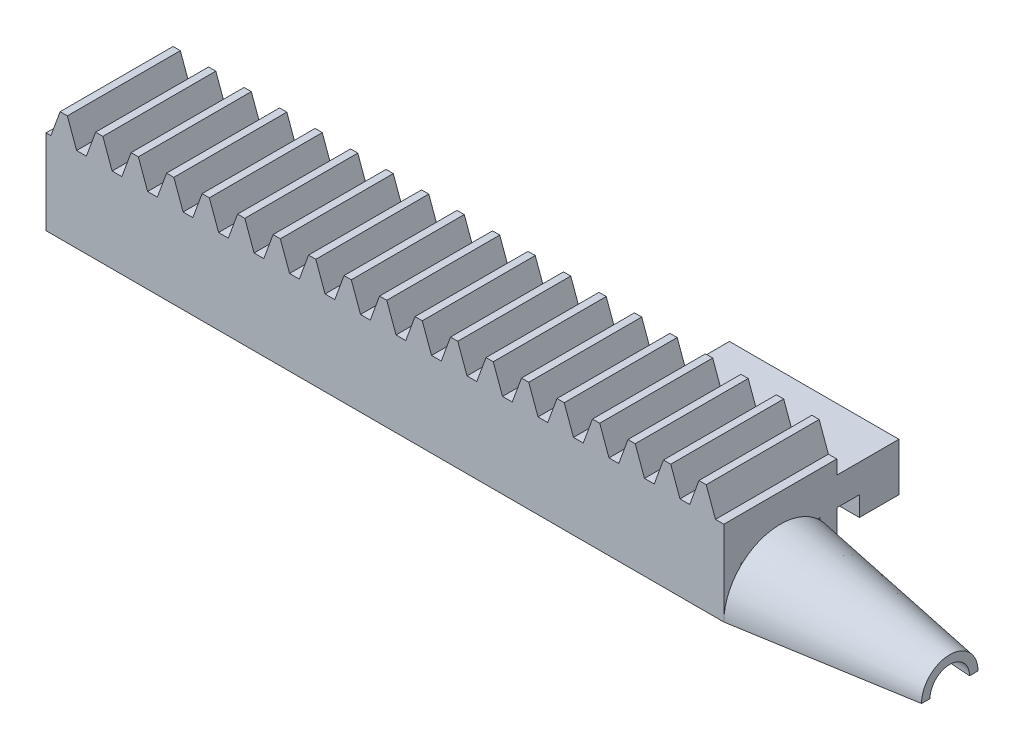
ISO-10303-21;
HEADER;
FILE_DESCRIPTION(('STEP AP214'),'2;1');
FILE_NAME('part.step','',(''),(''),'','','');
FILE_SCHEMA(('AUTOMOTIVE_DESIGN { 1 0 10303 214 1 1 1 1 }'));
ENDSEC;
DATA;
#1=APPLICATION_CONTEXT('core data for automotive mechanical design processes');
#2=APPLICATION_PROTOCOL_DEFINITION('international standard','automotive_design',2000,#1);
#3=PRODUCT_CONTEXT('',#1,'mechanical');
#4=PRODUCT('Part','Part','',(#3));
#5=PRODUCT_RELATED_PRODUCT_CATEGORY('part','',(#4));
#6=PRODUCT_DEFINITION_FORMATION('','',#4);
#7=PRODUCT_DEFINITION_CONTEXT('part definition',#1,'design');
#8=PRODUCT_DEFINITION('design','',#6,#7);
#9=PRODUCT_DEFINITION_SHAPE('','',#8);
#10=(LENGTH_UNIT() NAMED_UNIT(*) SI_UNIT(.MILLI.,.METRE.));
#11=(NAMED_UNIT(*) PLANE_ANGLE_UNIT() SI_UNIT($,.RADIAN.));
#12=(NAMED_UNIT(*) SI_UNIT($,.STERADIAN.) SOLID_ANGLE_UNIT());
#13=UNCERTAINTY_MEASURE_WITH_UNIT(LENGTH_MEASURE(1.E-05),#10,'distance_accuracy_value','');
#14=(GEOMETRIC_REPRESENTATION_CONTEXT(3) GLOBAL_UNCERTAINTY_ASSIGNED_CONTEXT((#13)) GLOBAL_UNIT_ASSIGNED_CONTEXT((#10,
#11,#12)) REPRESENTATION_CONTEXT('',''));
#15=CARTESIAN_POINT('',(0.,0.,0.));
#16=DIRECTION('',(0.,0.,1.));
#17=DIRECTION('',(1.,0.,0.));
#18=AXIS2_PLACEMENT_3D('',#15,#16,#17);
#19=CARTESIAN_POINT('',(0.,-7.5,0.));
#20=DIRECTION('',(0.,1.,0.));
#21=DIRECTION('',(0.,0.,1.));
#22=AXIS2_PLACEMENT_3D('',#19,#20,#21);
#23=PLANE('',#22);
#24=DIRECTION('',(0.,0.,1.));
#25=VECTOR('',#24,1.);
#26=CARTESIAN_POINT('',(150.,-7.5,7.29786675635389));
#27=LINE('',#26,#25);
#28=CARTESIAN_POINT('',(150.,-7.5,-15.));
#29=VERTEX_POINT('',#28);
#30=CARTESIAN_POINT('',(150.,-7.5,-13.5));
#31=VERTEX_POINT('',#30);
#32=EDGE_CURVE('E634',#29,#31,#27,.T.);
#33=ORIENTED_EDGE('',*,*,#32,.T.);
#34=DIRECTION('',(-0.997564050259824,0.,-0.0697564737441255));
#35=VECTOR('',#34,1.);
#36=CARTESIAN_POINT('',(200.052331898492,-7.5,-10.));
#37=LINE('',#36,#35);
#38=CARTESIAN_POINT('',(120.,-7.5,-15.5978043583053));
#39=VERTEX_POINT('',#38);
#40=EDGE_CURVE('E622',#31,#39,#37,.T.);
#41=ORIENTED_EDGE('',*,*,#40,.T.);
#42=DIRECTION('',(0.,0.,1.));
#43=VECTOR('',#42,1.);
#44=CARTESIAN_POINT('',(120.,-7.5,-10.));
#45=LINE('',#44,#43);
#46=CARTESIAN_POINT('',(120.,-7.5,-17.));
#47=VERTEX_POINT('',#46);
#48=EDGE_CURVE('E640',#47,#39,#45,.T.);
#49=ORIENTED_EDGE('',*,*,#48,.F.);
#50=DIRECTION('',(-1.,0.,0.));
#51=VECTOR('',#50,1.);
#52=CARTESIAN_POINT('',(0.,-7.5,-17.));
#53=LINE('',#52,#51);
#54=CARTESIAN_POINT('',(0.,-7.5,-17.));
#55=VERTEX_POINT('',#54);
#56=EDGE_CURVE('E752',#47,#55,#53,.T.);
#57=ORIENTED_EDGE('',*,*,#56,.T.);
#58=DIRECTION('',(0.,0.,-1.));
#59=VECTOR('',#58,1.);
#60=CARTESIAN_POINT('',(0.,-7.5,-20.));
#61=LINE('',#60,#59);
#62=CARTESIAN_POINT('',(0.,-7.5,-20.));
#63=VERTEX_POINT('',#62);
#64=EDGE_CURVE('E754',#55,#63,#61,.T.);
#65=ORIENTED_EDGE('',*,*,#64,.T.);
#66=DIRECTION('',(1.,0.,0.));
#67=VECTOR('',#66,1.);
#68=CARTESIAN_POINT('',(120.,-7.5,-20.));
#69=LINE('',#68,#67);
#70=CARTESIAN_POINT('',(120.,-7.5,-20.));
#71=VERTEX_POINT('',#70);
#72=EDGE_CURVE('E757',#63,#71,#69,.T.);
#73=ORIENTED_EDGE('',*,*,#72,.T.);
#74=DIRECTION('',(-0.986393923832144,0.,-0.164398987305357));
#75=VECTOR('',#74,1.);
#76=CARTESIAN_POINT('',(180.,-7.5,-10.));
#77=LINE('',#76,#75);
#78=EDGE_CURVE('E47',#71,#29,#77,.F.);
#79=ORIENTED_EDGE('',*,*,#78,.T.);
#80=EDGE_LOOP('',(#33,#41,#49,#57,#65,#73,#79));
#81=FACE_BOUND('',#80,.T.);
#82=ADVANCED_FACE('F37',(#81),#23,.F.);
#83=CARTESIAN_POINT('',(120.,0.,-20.));
#84=DIRECTION('',(1.,0.,0.));
#85=DIRECTION('',(0.,0.,-1.));
#86=AXIS2_PLACEMENT_3D('',#83,#84,#85);
#87=PLANE('',#86);
#88=DIRECTION('',(0.,1.,0.));
#89=VECTOR('',#88,1.);
#90=CARTESIAN_POINT('',(120.,0.,0.));
#91=LINE('',#90,#89);
#92=CARTESIAN_POINT('',(120.,-7.5,0.));
#93=VERTEX_POINT('',#92);
#94=CARTESIAN_POINT('',(120.,7.5,0.));
#95=VERTEX_POINT('',#94);
#96=EDGE_CURVE('E729',#93,#95,#91,.T.);
#97=ORIENTED_EDGE('',*,*,#96,.F.);
#98=CARTESIAN_POINT('',(120.,-7.5,-10.));
#99=DIRECTION('',(-1.,0.,0.));
#100=DIRECTION('',(0.,0.,1.));
#101=AXIS2_PLACEMENT_3D('',#98,#99,#100);
#102=CIRCLE('',#101,10.);
#103=CARTESIAN_POINT('',(120.,-0.358567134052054,-3.));
#104=VERTEX_POINT('',#103);
#105=EDGE_CURVE('E711',#93,#104,#102,.T.);
#106=ORIENTED_EDGE('',*,*,#105,.T.);
#107=DIRECTION('',(0.,1.,0.));
#108=VECTOR('',#107,1.);
#109=CARTESIAN_POINT('',(120.,-7.5,-3.));
#110=LINE('',#109,#108);
#111=CARTESIAN_POINT('',(120.,0.,-3.));
#112=VERTEX_POINT('',#111);
#113=EDGE_CURVE('E721',#104,#112,#110,.T.);
#114=ORIENTED_EDGE('',*,*,#113,.T.);
#115=DIRECTION('',(0.,0.,1.));
#116=VECTOR('',#115,1.);
#117=CARTESIAN_POINT('',(120.,0.,-20.));
#118=LINE('',#117,#116);
#119=CARTESIAN_POINT('',(120.,-8.10370520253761E-07,-3.38561917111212));
#120=VERTEX_POINT('',#119);
#121=EDGE_CURVE('E930',#120,#112,#118,.T.);
#122=ORIENTED_EDGE('',*,*,#121,.F.);
#123=CARTESIAN_POINT('',(120.,-5.86276388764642E-10,-3.38561845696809));
#124=CARTESIAN_POINT('',(120.,0.0265301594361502,-3.41569953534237));
#125=CARTESIAN_POINT('',(120.,0.0528779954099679,-3.44594140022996));
#126=CARTESIAN_POINT('',(120.,0.105245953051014,-3.50678498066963));
#127=CARTESIAN_POINT('',(120.,0.131265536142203,-3.5373871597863));
#128=CARTESIAN_POINT('',(120.,0.181601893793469,-3.59731300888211));
#129=CARTESIAN_POINT('',(120.,0.205937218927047,-3.62662110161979));
#130=CARTESIAN_POINT('',(120.,0.256893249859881,-3.68870719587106));
#131=CARTESIAN_POINT('',(120.,0.283475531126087,-3.72151675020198));
#132=CARTESIAN_POINT('',(120.,0.3349067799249,-3.7858292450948));
#133=CARTESIAN_POINT('',(120.,0.359776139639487,-3.81731588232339));
#134=CARTESIAN_POINT('',(120.,0.409153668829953,-3.88061177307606));
#135=CARTESIAN_POINT('',(120.,0.433661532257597,-3.9124212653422));
#136=CARTESIAN_POINT('',(120.,0.482315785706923,-3.97636318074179));
#137=CARTESIAN_POINT('',(120.,0.506461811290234,-4.00849588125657));
#138=CARTESIAN_POINT('',(120.,0.544897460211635,-4.06028824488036));
#139=CARTESIAN_POINT('',(120.,0.559309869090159,-4.07985689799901));
#140=CARTESIAN_POINT('',(120.,0.583009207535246,-4.11228166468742));
#141=CARTESIAN_POINT('',(120.,0.592337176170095,-4.12510780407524));
#142=CARTESIAN_POINT('',(120.,0.625142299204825,-4.1704434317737));
#143=CARTESIAN_POINT('',(120.,0.648453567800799,-4.20307323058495));
#144=CARTESIAN_POINT('',(120.,0.694714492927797,-4.2686587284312));
#145=CARTESIAN_POINT('',(120.,0.71766357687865,-4.30161483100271));
#146=CARTESIAN_POINT('',(120.,0.76541542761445,-4.3710736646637));
#147=CARTESIAN_POINT('',(120.,0.79017699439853,-4.4076047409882));
#148=CARTESIAN_POINT('',(120.,0.834809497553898,-4.47439737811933));
#149=CARTESIAN_POINT('',(120.,0.854759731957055,-4.50460599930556));
#150=CARTESIAN_POINT('',(120.,0.896469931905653,-4.56851969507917));
#151=CARTESIAN_POINT('',(120.,0.918192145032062,-4.60224942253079));
#152=CARTESIAN_POINT('',(120.,0.961245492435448,-4.66999447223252));
#153=CARTESIAN_POINT('',(120.,0.982576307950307,-4.70400999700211));
#154=CARTESIAN_POINT('',(120.,1.02484646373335,-4.77232707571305));
#155=CARTESIAN_POINT('',(120.,1.04578542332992,-4.80662886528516));
#156=CARTESIAN_POINT('',(120.,1.0821722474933,-4.8670480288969));
#157=CARTESIAN_POINT('',(120.,1.09770881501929,-4.89311206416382));
#158=CARTESIAN_POINT('',(120.,1.13849724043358,-4.96225340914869));
#159=CARTESIAN_POINT('',(120.,1.16354567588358,-5.00545104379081));
#160=CARTESIAN_POINT('',(120.,1.20814573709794,-5.08371767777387));
#161=CARTESIAN_POINT('',(120.,1.22781278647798,-5.11872104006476));
#162=CARTESIAN_POINT('',(120.,1.27158028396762,-5.19772437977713));
#163=CARTESIAN_POINT('',(120.,1.29556253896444,-5.24178997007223));
#164=CARTESIAN_POINT('',(120.,1.33343917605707,-5.31264645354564));
#165=CARTESIAN_POINT('',(120.,1.34754551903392,-5.33932434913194));
#166=CARTESIAN_POINT('',(120.,1.38011950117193,-5.40161285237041));
#167=CARTESIAN_POINT('',(120.,1.39849379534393,-5.43727235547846));
#168=CARTESIAN_POINT('',(120.,1.43482516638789,-5.50883722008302));
#169=CARTESIAN_POINT('',(120.,1.45278191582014,-5.54474274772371));
#170=CARTESIAN_POINT('',(120.,1.48827776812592,-5.61680005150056));
#171=CARTESIAN_POINT('',(120.,1.50581647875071,-5.65295202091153));
#172=CARTESIAN_POINT('',(120.,1.53882165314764,-5.72203577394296));
#173=CARTESIAN_POINT('',(120.,1.55432726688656,-5.75494886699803));
#174=CARTESIAN_POINT('',(120.,1.58814778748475,-5.827767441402));
#175=CARTESIAN_POINT('',(120.,1.60638042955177,-5.86771117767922));
#176=CARTESIAN_POINT('',(120.,1.64077402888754,-5.94439948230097));
#177=CARTESIAN_POINT('',(120.,1.65697852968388,-5.981124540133));
#178=CARTESIAN_POINT('',(120.,1.6889695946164,-6.05482399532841));
#179=CARTESIAN_POINT('',(120.,1.70475547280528,-6.09179869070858));
#180=CARTESIAN_POINT('',(120.,1.72651325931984,-6.14361805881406));
#181=CARTESIAN_POINT('',(120.,1.73267201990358,-6.15838451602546));
#182=CARTESIAN_POINT('',(120.,1.74803973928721,-6.19548093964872));
#183=CARTESIAN_POINT('',(120.,1.75720334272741,-6.21782971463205));
#184=CARTESIAN_POINT('',(120.,1.78136690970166,-6.27737835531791));
#185=CARTESIAN_POINT('',(120.,1.79622362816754,-6.31463644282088));
#186=CARTESIAN_POINT('',(120.,1.82549766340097,-6.38935646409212));
#187=CARTESIAN_POINT('',(120.,1.83991464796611,-6.42681852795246));
#188=CARTESIAN_POINT('',(120.,1.86830885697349,-6.50194671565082));
#189=CARTESIAN_POINT('',(120.,1.88228568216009,-6.53961299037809));
#190=CARTESIAN_POINT('',(120.,1.91055504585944,-6.61721994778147));
#191=CARTESIAN_POINT('',(120.,1.92482158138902,-6.65717010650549));
#192=CARTESIAN_POINT('',(120.,1.95134627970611,-6.73296590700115));
#193=CARTESIAN_POINT('',(120.,1.96365603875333,-6.76879350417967));
#194=CARTESIAN_POINT('',(120.,1.98858393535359,-6.84271809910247));
#195=CARTESIAN_POINT('',(120.,2.00117699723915,-6.88082355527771));
#196=CARTESIAN_POINT('',(120.,2.02592273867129,-6.95724154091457));
#197=CARTESIAN_POINT('',(120.,2.03807471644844,-6.99555429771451));
#198=CARTESIAN_POINT('',(120.,2.05653490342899,-7.05498862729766));
#199=CARTESIAN_POINT('',(120.,2.06300392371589,-7.07606037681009));
#200=CARTESIAN_POINT('',(120.,2.07466743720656,-7.11450389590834));
#201=CARTESIAN_POINT('',(120.,2.0798844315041,-7.13186884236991));
#202=CARTESIAN_POINT('',(120.,2.09648843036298,-7.1876894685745));
#203=CARTESIAN_POINT('',(120.,2.10769043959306,-7.22620036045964));
#204=CARTESIAN_POINT('',(120.,2.12963718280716,-7.3033819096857));
#205=CARTESIAN_POINT('',(120.,2.14038158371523,-7.34205266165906));
#206=CARTESIAN_POINT('',(120.,2.16141274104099,-7.41955409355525));
#207=CARTESIAN_POINT('',(120.,2.17169909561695,-7.45838488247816));
#208=CARTESIAN_POINT('',(120.,2.19387937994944,-7.54419138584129));
#209=CARTESIAN_POINT('',(120.,2.20566711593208,-7.59119461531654));
#210=CARTESIAN_POINT('',(120.,2.22463815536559,-7.66923877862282));
#211=CARTESIAN_POINT('',(120.,2.23201563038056,-7.7002326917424));
#212=CARTESIAN_POINT('',(120.,2.24834697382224,-7.7703380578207));
#213=CARTESIAN_POINT('',(120.,2.25721341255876,-7.80946992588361));
#214=CARTESIAN_POINT('',(120.,2.27448773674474,-7.88789646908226));
#215=CARTESIAN_POINT('',(120.,2.28289491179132,-7.9271913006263));
#216=CARTESIAN_POINT('',(120.,2.29677707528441,-7.99403205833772));
#217=CARTESIAN_POINT('',(120.,2.30237272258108,-8.02155296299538));
#218=CARTESIAN_POINT('',(120.,2.31021577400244,-8.06097346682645));
#219=CARTESIAN_POINT('',(120.,2.31255725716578,-8.07285441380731));
#220=CARTESIAN_POINT('',(120.,2.32255927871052,-8.12409913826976));
#221=CARTESIAN_POINT('',(120.,2.3300034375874,-8.16350542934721));
#222=CARTESIAN_POINT('',(120.,2.34442092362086,-8.24243214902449));
#223=CARTESIAN_POINT('',(120.,2.35139392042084,-8.281952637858));
#224=CARTESIAN_POINT('',(120.,2.36486905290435,-8.36110792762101));
#225=CARTESIAN_POINT('',(120.,2.37137078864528,-8.40074279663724));
#226=CARTESIAN_POINT('',(120.,2.38390332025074,-8.48012698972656));
#227=CARTESIAN_POINT('',(120.,2.38993364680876,-8.51987638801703));
#228=CARTESIAN_POINT('',(120.,2.39778437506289,-8.5738013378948));
#229=CARTESIAN_POINT('',(120.,2.39981301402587,-8.58794681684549));
#230=CARTESIAN_POINT('',(120.,2.40542419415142,-8.62768029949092));
#231=CARTESIAN_POINT('',(120.,2.40893775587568,-8.65327808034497));
#232=CARTESIAN_POINT('',(120.,2.41765147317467,-8.71865189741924));
#233=CARTESIAN_POINT('',(120.,2.42271081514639,-8.75844676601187));
#234=CARTESIAN_POINT('',(120.,2.4323569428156,-8.83815362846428));
#235=CARTESIAN_POINT('',(120.,2.43694301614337,-8.87806570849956));
#236=CARTESIAN_POINT('',(120.,2.44498195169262,-8.95192713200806));
#237=CARTESIAN_POINT('',(120.,2.44850146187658,-8.98586924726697));
#238=CARTESIAN_POINT('',(120.,2.45637580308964,-9.06579246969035));
#239=CARTESIAN_POINT('',(120.,2.46058611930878,-9.11178791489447));
#240=CARTESIAN_POINT('',(120.,2.46785553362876,-9.19779347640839));
#241=CARTESIAN_POINT('',(120.,2.47099319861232,-9.23779698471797));
#242=CARTESIAN_POINT('',(120.,2.47678897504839,-9.31787161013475));
#243=CARTESIAN_POINT('',(120.,2.47944669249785,-9.35794275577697));
#244=CARTESIAN_POINT('',(120.,2.48428215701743,-9.43815275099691));
#245=CARTESIAN_POINT('',(120.,2.48645944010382,-9.47829162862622));
#246=CARTESIAN_POINT('',(120.,2.48937572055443,-9.53875016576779));
#247=CARTESIAN_POINT('',(120.,2.4902937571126,-9.55906133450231));
#248=CARTESIAN_POINT('',(120.,2.49198419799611,-9.59917437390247));
#249=CARTESIAN_POINT('',(120.,2.49275970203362,-9.61897611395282));
#250=CARTESIAN_POINT('',(120.,2.49492550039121,-9.67885970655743));
#251=CARTESIAN_POINT('',(120.,2.49613233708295,-9.71894834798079));
#252=CARTESIAN_POINT('',(120.,2.49806427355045,-9.79919577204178));
#253=CARTESIAN_POINT('',(120.,2.49878866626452,-9.8393545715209));
#254=CARTESIAN_POINT('',(120.,2.49975587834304,-9.91967557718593));
#255=CARTESIAN_POINT('',(120.,2.49999872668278,-9.95983778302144));
#256=CARTESIAN_POINT('',(120.,2.50000127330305,-10.0401617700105));
#257=CARTESIAN_POINT('',(120.,2.49976097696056,-10.0803235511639));
#258=CARTESIAN_POINT('',(120.,2.49879448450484,-10.1606007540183));
#259=CARTESIAN_POINT('',(120.,2.4980687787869,-10.2007161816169));
#260=CARTESIAN_POINT('',(120.,2.49613349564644,-10.2809672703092));
#261=CARTESIAN_POINT('',(120.,2.49492353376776,-10.3211029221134));
#262=CARTESIAN_POINT('',(120.,2.49201933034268,-10.4013945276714));
#263=CARTESIAN_POINT('',(120.,2.49032463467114,-10.4415504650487));
#264=CARTESIAN_POINT('',(120.,2.48711930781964,-10.5080366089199));
#265=CARTESIAN_POINT('',(120.,2.48574572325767,-10.5343734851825));
#266=CARTESIAN_POINT('',(120.,2.48349512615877,-10.5744800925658));
#267=CARTESIAN_POINT('',(120.,2.48269363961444,-10.5882541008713));
#268=CARTESIAN_POINT('',(120.,2.47945073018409,-10.6420512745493));
#269=CARTESIAN_POINT('',(120.,2.47679551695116,-10.6820618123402));
#270=CARTESIAN_POINT('',(120.,2.47099881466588,-10.762105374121));
#271=CARTESIAN_POINT('',(120.,2.46785663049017,-10.8021383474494));
#272=CARTESIAN_POINT('',(120.,2.46058311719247,-10.8881862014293));
#273=CARTESIAN_POINT('',(120.,2.4563740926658,-10.9341945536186));
#274=CARTESIAN_POINT('',(120.,2.44850228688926,-11.0141447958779));
#275=CARTESIAN_POINT('',(120.,2.44498378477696,-11.0481009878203));
#276=CARTESIAN_POINT('',(120.,2.43695036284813,-11.1219196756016));
#277=CARTESIAN_POINT('',(120.,2.43236885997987,-11.1617749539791));
#278=CARTESIAN_POINT('',(120.,2.42272236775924,-11.2414581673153));
#279=CARTESIAN_POINT('',(120.,2.41765700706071,-11.2812860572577));
#280=CARTESIAN_POINT('',(120.,2.40704221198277,-11.3609145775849));
#281=CARTESIAN_POINT('',(120.,2.4014923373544,-11.4007151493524));
#282=CARTESIAN_POINT('',(120.,2.39103564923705,-11.4725550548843));
#283=CARTESIAN_POINT('',(120.,2.38621208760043,-11.5046065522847));
#284=CARTESIAN_POINT('',(120.,2.37387839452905,-11.5839339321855));
#285=CARTESIAN_POINT('',(120.,2.36618400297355,-11.6311813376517));
#286=CARTESIAN_POINT('',(120.,2.35141083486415,-11.7179474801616));
#287=CARTESIAN_POINT('',(120.,2.34443297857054,-11.7574834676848));
#288=CARTESIAN_POINT('',(120.,2.32999123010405,-11.836530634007));
#289=CARTESIAN_POINT('',(120.,2.32252659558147,-11.8760416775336));
#290=CARTESIAN_POINT('',(120.,2.31252266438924,-11.9273094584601));
#291=CARTESIAN_POINT('',(120.,2.31019838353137,-11.9391084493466));
#292=CARTESIAN_POINT('',(120.,2.30236927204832,-11.9784772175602));
#293=CARTESIAN_POINT('',(120.,2.29676933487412,-12.0060281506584));
#294=CARTESIAN_POINT('',(120.,2.28289636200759,-12.0728296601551));
#295=CARTESIAN_POINT('',(120.,2.27450249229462,-12.1120551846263));
#296=CARTESIAN_POINT('',(120.,2.25723613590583,-12.1904316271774));
#297=CARTESIAN_POINT('',(120.,2.24836329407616,-12.2295824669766));
#298=CARTESIAN_POINT('',(120.,2.23013858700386,-12.3078095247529));
#299=CARTESIAN_POINT('',(120.,2.22078629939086,-12.3468856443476));
#300=CARTESIAN_POINT('',(120.,2.20202626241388,-12.4232446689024));
#301=CARTESIAN_POINT('',(120.,2.19263819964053,-12.460532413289));
#302=CARTESIAN_POINT('',(120.,2.17258502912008,-12.5382819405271));
#303=CARTESIAN_POINT('',(120.,2.16188032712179,-12.5787335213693));
#304=CARTESIAN_POINT('',(120.,2.14040819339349,-12.6578522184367));
#305=CARTESIAN_POINT('',(120.,2.12966110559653,-12.6965248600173));
#306=CARTESIAN_POINT('',(120.,2.10768569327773,-12.77379771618));
#307=CARTESIAN_POINT('',(120.,2.0964566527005,-12.8123977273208));
#308=CARTESIAN_POINT('',(120.,2.07984577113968,-12.8682488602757));
#309=CARTESIAN_POINT('',(120.,2.0746479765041,-12.8855549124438));
#310=CARTESIAN_POINT('',(120.,2.06299159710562,-12.9239867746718));
#311=CARTESIAN_POINT('',(120.,2.05650985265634,-12.9451055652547));
#312=CARTESIAN_POINT('',(120.,2.03806183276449,-13.0045065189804));
#313=CARTESIAN_POINT('',(120.,2.02593410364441,-13.0427386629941));
#314=CARTESIAN_POINT('',(120.,2.00120967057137,-13.1190817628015));
#315=CARTESIAN_POINT('',(120.,1.98861263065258,-13.1571926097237));
#316=CARTESIAN_POINT('',(120.,1.96294916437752,-13.233293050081));
#317=CARTESIAN_POINT('',(120.,1.94988233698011,-13.2712825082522));
#318=CARTESIAN_POINT('',(120.,1.92186589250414,-13.3511742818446));
#319=CARTESIAN_POINT('',(120.,1.90686480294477,-13.3930585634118));
#320=CARTESIAN_POINT('',(120.,1.87928271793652,-13.4684810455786));
#321=CARTESIAN_POINT('',(120.,1.86679976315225,-13.5020551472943));
#322=CARTESIAN_POINT('',(120.,1.83994803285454,-13.5730977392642));
#323=CARTESIAN_POINT('',(120.,1.82553306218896,-13.61054878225));
#324=CARTESIAN_POINT('',(120.,1.79623135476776,-13.6853315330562));
#325=CARTESIAN_POINT('',(120.,1.78134393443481,-13.7226629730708));
#326=CARTESIAN_POINT('',(120.,1.75716770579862,-13.7822467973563));
#327=CARTESIAN_POINT('',(120.,1.74802168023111,-13.8045572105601));
#328=CARTESIAN_POINT('',(120.,1.73264683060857,-13.8416799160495));
#329=CARTESIAN_POINT('',(120.,1.72646266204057,-13.8565107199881));
#330=CARTESIAN_POINT('',(120.,1.70471805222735,-13.908304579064));
#331=CARTESIAN_POINT('',(120.,1.68896971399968,-13.9451889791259));
#332=CARTESIAN_POINT('',(120.,1.65701814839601,-14.0187911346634));
#333=CARTESIAN_POINT('',(120.,1.64081460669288,-14.055508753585));
#334=CARTESIAN_POINT('',(120.,1.60795251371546,-14.1287774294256));
#335=CARTESIAN_POINT('',(120.,1.5912935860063,-14.1653283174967));
#336=CARTESIAN_POINT('',(120.,1.55752058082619,-14.2382636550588));
#337=CARTESIAN_POINT('',(120.,1.54040606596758,-14.2746479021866));
#338=CARTESIAN_POINT('',(120.,1.51862683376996,-14.3202380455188));
#339=CARTESIAN_POINT('',(120.,1.51416497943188,-14.329541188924));
#340=CARTESIAN_POINT('',(120.,1.49676176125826,-14.3656834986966));
#341=CARTESIAN_POINT('',(120.,1.48371436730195,-14.3924717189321));
#342=CARTESIAN_POINT('',(120.,1.45281719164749,-14.4551907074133));
#343=CARTESIAN_POINT('',(120.,1.43486975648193,-14.4910733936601));
#344=CARTESIAN_POINT('',(120.,1.39851700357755,-14.5626736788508));
#345=CARTESIAN_POINT('',(120.,1.38011104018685,-14.5983909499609));
#346=CARTESIAN_POINT('',(120.,1.347518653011,-14.660716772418));
#347=CARTESIAN_POINT('',(120.,1.33342547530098,-14.6873741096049));
#348=CARTESIAN_POINT('',(120.,1.31447717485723,-14.7228277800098));
#349=CARTESIAN_POINT('',(120.,1.3097284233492,-14.7316810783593));
#350=CARTESIAN_POINT('',(120.,1.28595785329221,-14.7758367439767));
#351=CARTESIAN_POINT('',(120.,1.26673566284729,-14.8110315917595));
#352=CARTESIAN_POINT('',(120.,1.22785490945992,-14.881210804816));
#353=CARTESIAN_POINT('',(120.,1.20819605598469,-14.9161950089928));
#354=CARTESIAN_POINT('',(120.,1.16844184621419,-14.9859530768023));
#355=CARTESIAN_POINT('',(120.,1.14834614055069,-15.0207267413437));
#356=CARTESIAN_POINT('',(120.,1.1077180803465,-15.0900637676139));
#357=CARTESIAN_POINT('',(120.,1.08718531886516,-15.1246268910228));
#358=CARTESIAN_POINT('',(120.,1.0580065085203,-15.173080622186));
#359=CARTESIAN_POINT('',(120.,1.04953249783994,-15.1870750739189));
#360=CARTESIAN_POINT('',(120.,1.02865960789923,-15.2213552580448));
#361=CARTESIAN_POINT('',(120.,1.01622253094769,-15.2416177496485));
#362=CARTESIAN_POINT('',(120.,0.982607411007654,-15.2959453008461));
#363=CARTESIAN_POINT('',(120.,0.961295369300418,-15.3299275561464));
#364=CARTESIAN_POINT('',(120.,0.918231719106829,-15.3976827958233));
#365=CARTESIAN_POINT('',(120.,0.896479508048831,-15.4314553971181));
#366=CARTESIAN_POINT('',(120.,0.854746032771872,-15.4954059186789));
#367=CARTESIAN_POINT('',(120.,0.834802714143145,-15.5256086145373));
#368=CARTESIAN_POINT('',(120.,0.790184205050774,-15.5923895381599));
#369=CARTESIAN_POINT('',(120.,0.765429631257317,-15.6289147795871));
#370=CARTESIAN_POINT('',(120.,0.717702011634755,-15.6983378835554));
#371=CARTESIAN_POINT('',(120.,0.694770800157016,-15.7312645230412));
#372=CARTESIAN_POINT('',(120.,0.648494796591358,-15.7968658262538));
#373=CARTESIAN_POINT('',(120.,0.625149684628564,-15.8295402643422));
#374=CARTESIAN_POINT('',(120.,0.578045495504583,-15.8946369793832));
#375=CARTESIAN_POINT('',(120.,0.554286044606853,-15.9270589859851));
#376=CARTESIAN_POINT('',(120.,0.516983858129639,-15.9773266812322));
#377=CARTESIAN_POINT('',(120.,0.503574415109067,-15.9952714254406));
#378=CARTESIAN_POINT('',(120.,0.47942937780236,-16.0273573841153));
#379=CARTESIAN_POINT('',(120.,0.468716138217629,-16.0415154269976));
#380=CARTESIAN_POINT('',(120.,0.433680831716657,-16.0875590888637));
#381=CARTESIAN_POINT('',(120.,0.409203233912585,-16.119326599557));
#382=CARTESIAN_POINT('',(120.,0.359831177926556,-16.1826102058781));
#383=CARTESIAN_POINT('',(120.,0.334936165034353,-16.2141258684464));
#384=CARTESIAN_POINT('',(120.,0.283477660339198,-16.2784723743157));
#385=CARTESIAN_POINT('',(120.,0.256894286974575,-16.3112873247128));
#386=CARTESIAN_POINT('',(120.,0.205936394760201,-16.373383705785));
#387=CARTESIAN_POINT('',(120.,0.181600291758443,-16.402696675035));
#388=CARTESIAN_POINT('',(120.,0.131292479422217,-16.462589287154));
#389=CARTESIAN_POINT('',(120.,0.105302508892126,-16.4931535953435));
#390=CARTESIAN_POINT('',(120.,0.0529355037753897,-16.5539907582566));
#391=CARTESIAN_POINT('',(120.,0.026558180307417,-16.5842633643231));
#392=CARTESIAN_POINT('',(120.,-9.91854127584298E-10,-16.6143763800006));
#393=B_SPLINE_CURVE_WITH_KNOTS('',3,(#123,#124,#125,#126,#127,#128,#129,#130,#131,#132,#133,
#134,#135,#136,#137,#138,#139,#140,#141,#142,#143,#144,#145,#146,#147,#148,#149,#150,#151,#152,
#153,#154,#155,#156,#157,#158,#159,#160,#161,#162,#163,#164,#165,#166,#167,#168,#169,#170,#171,
#172,#173,#174,#175,#176,#177,#178,#179,#180,#181,#182,#183,#184,#185,#186,#187,#188,#189,#190,
#191,#192,#193,#194,#195,#196,#197,#198,#199,#200,#201,#202,#203,#204,#205,#206,#207,#208,#209,
#210,#211,#212,#213,#214,#215,#216,#217,#218,#219,#220,#221,#222,#223,#224,#225,#226,#227,#228,
#229,#230,#231,#232,#233,#234,#235,#236,#237,#238,#239,#240,#241,#242,#243,#244,#245,#246,#247,
#248,#249,#250,#251,#252,#253,#254,#255,#256,#257,#258,#259,#260,#261,#262,#263,#264,#265,#266,
#267,#268,#269,#270,#271,#272,#273,#274,#275,#276,#277,#278,#279,#280,#281,#282,#283,#284,#285,
#286,#287,#288,#289,#290,#291,#292,#293,#294,#295,#296,#297,#298,#299,#300,#301,#302,#303,#304,
#305,#306,#307,#308,#309,#310,#311,#312,#313,#314,#315,#316,#317,#318,#319,#320,#321,#322,#323,
#324,#325,#326,#327,#328,#329,#330,#331,#332,#333,#334,#335,#336,#337,#338,#339,#340,#341,#342,
#343,#344,#345,#346,#347,#348,#349,#350,#351,#352,#353,#354,#355,#356,#357,#358,#359,#360,#361,
#362,#363,#364,#365,#366,#367,#368,#369,#370,#371,#372,#373,#374,#375,#376,#377,#378,#379,#380,
#381,#382,#383,#384,#385,#386,#387,#388,#389,#390,#391,#392),.UNSPECIFIED.,.F.,.F.,(4,2,2,2,2,2,
2,2,2,2,2,2,2,2,2,2,2,2,2,2,2,2,2,2,2,2,2,2,2,2,2,2,2,2,2,2,2,2,2,2,2,2,2,2,2,2,2,2,2,2,2,2,2,2,
2,2,2,2,2,2,2,2,2,2,2,2,2,2,2,2,2,2,2,2,2,2,2,2,2,2,2,2,2,2,2,2,2,2,2,2,2,2,2,2,2,2,2,2,2,2,2,2,
2,2,2,2,2,2,2,2,2,2,2,2,2,2,2,2,2,2,2,2,2,2,2,2,2,2,2,2,2,2,2,2,4),(0.,0.120325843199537,
0.240828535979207,0.355108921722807,0.481785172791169,0.602152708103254,0.722616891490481,
0.843195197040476,0.916104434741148,0.963682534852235,1.08398332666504,1.20445833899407,
1.33685099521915,1.44545449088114,1.56580902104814,1.68625757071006,1.80681762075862,
1.89784667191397,2.04764392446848,2.16809165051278,2.31859214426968,2.40912452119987,
2.52946644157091,2.64989975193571,2.77044193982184,2.87958782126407,3.01130839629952,
3.13172923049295,3.25233651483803,3.30033438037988,3.37279723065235,3.49312693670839,
3.6135454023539,3.73407012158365,3.86132989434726,3.97497749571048,4.09537183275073,
4.21594999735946,4.28207672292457,4.33647159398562,4.45678948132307,4.57719349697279,
4.69770114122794,4.84307191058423,4.93865019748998,5.05901843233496,5.1795678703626,
5.26381886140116,5.30014725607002,5.42045372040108,5.54084368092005,5.66133464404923,
5.78194407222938,5.82481460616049,5.90232719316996,6.0226697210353,6.14319082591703,
6.2455615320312,6.38411996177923,6.50449626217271,6.6249709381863,6.74556145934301,
6.80655684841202,6.86600730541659,6.98632452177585,7.10681768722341,7.22730360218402,
7.34778817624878,7.46815121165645,7.58860999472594,7.70918200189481,7.78829918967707,
7.82969104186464,7.94998334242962,8.07044896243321,8.20904562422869,8.31145800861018,
8.43180817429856,8.55225145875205,8.6728053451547,8.77004131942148,8.91364531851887,
9.03408378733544,9.15471042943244,9.1907876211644,9.27512943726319,9.395467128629,
9.51589530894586,9.63643146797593,9.75178326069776,9.87731185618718,9.99772356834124,
10.1183208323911,10.1725299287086,10.238802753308,10.3591283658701,10.4795418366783,
10.6000606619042,10.7335253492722,10.8409822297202,10.9613675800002,11.0819358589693,
11.1542722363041,11.2024776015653,11.3227915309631,11.4431906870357,11.5636925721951,
11.6843146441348,11.7152679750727,11.8046567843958,11.9250161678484,12.04555585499,
12.1360149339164,12.166154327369,12.2864569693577,12.406842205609,12.5273275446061,
12.6479304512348,12.6970106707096,12.7683350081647,12.8886688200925,13.0091803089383,
13.1177575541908,13.2501239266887,13.3704956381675,13.4909648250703,13.6115489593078,
13.6787529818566,13.7320164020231,13.8523250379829,13.9728087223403,14.0994996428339,
14.213792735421,14.3341513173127,14.4546047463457),.UNSPECIFIED.);
#394=CARTESIAN_POINT('',(120.,0.,-16.6143763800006));
#395=VERTEX_POINT('',#394);
#396=EDGE_CURVE('E706',#120,#395,#393,.T.);
#397=ORIENTED_EDGE('',*,*,#396,.T.);
#398=CARTESIAN_POINT('',(120.,0.,-17.));
#399=VERTEX_POINT('',#398);
#400=EDGE_CURVE('E928',#399,#395,#118,.T.);
#401=ORIENTED_EDGE('',*,*,#400,.F.);
#402=DIRECTION('',(0.,1.,0.));
#403=VECTOR('',#402,1.);
#404=CARTESIAN_POINT('',(120.,-7.5,-17.));
#405=LINE('',#404,#403);
#406=CARTESIAN_POINT('',(120.,-0.35857374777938,-17.0000007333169));
#407=VERTEX_POINT('',#406);
#408=EDGE_CURVE('E763',#407,#399,#405,.T.);
#409=ORIENTED_EDGE('',*,*,#408,.F.);
#410=CARTESIAN_POINT('',(120.,-7.5,-10.));
#411=DIRECTION('',(1.,0.,0.));
#412=DIRECTION('',(0.,0.,-1.));
#413=AXIS2_PLACEMENT_3D('',#410,#411,#412);
#414=CIRCLE('',#413,10.);
#415=EDGE_CURVE('E649',#71,#407,#414,.T.);
#416=ORIENTED_EDGE('',*,*,#415,.F.);
#417=DIRECTION('',(0.,1.,0.));
#418=VECTOR('',#417,1.);
#419=CARTESIAN_POINT('',(120.,0.,-20.));
#420=LINE('',#419,#418);
#421=CARTESIAN_POINT('',(120.,0.0199999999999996,-20.));
#422=VERTEX_POINT('',#421);
#423=EDGE_CURVE('E783',#71,#422,#420,.T.);
#424=ORIENTED_EDGE('',*,*,#423,.T.);
#425=DIRECTION('',(0.,0.,-1.));
#426=VECTOR('',#425,1.);
#427=CARTESIAN_POINT('',(120.,0.0200000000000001,-24.));
#428=LINE('',#427,#426);
#429=CARTESIAN_POINT('',(120.,0.0200000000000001,-24.));
#430=VERTEX_POINT('',#429);
#431=EDGE_CURVE('E856',#422,#430,#428,.T.);
#432=ORIENTED_EDGE('',*,*,#431,.T.);
#433=DIRECTION('',(0.,-1.,0.));
#434=VECTOR('',#433,1.);
#435=CARTESIAN_POINT('',(120.,-3.48,-24.));
#436=LINE('',#435,#434);
#437=CARTESIAN_POINT('',(120.,-3.48,-24.));
#438=VERTEX_POINT('',#437);
#439=EDGE_CURVE('E853',#430,#438,#436,.T.);
#440=ORIENTED_EDGE('',*,*,#439,.T.);
#441=DIRECTION('',(0.,0.,-1.));
#442=VECTOR('',#441,1.);
#443=CARTESIAN_POINT('',(120.,-3.48,-31.));
#444=LINE('',#443,#442);
#445=CARTESIAN_POINT('',(120.,-3.48,-31.));
#446=VERTEX_POINT('',#445);
#447=EDGE_CURVE('E850',#438,#446,#444,.T.);
#448=ORIENTED_EDGE('',*,*,#447,.T.);
#449=DIRECTION('',(0.,1.,0.));
#450=VECTOR('',#449,1.);
#451=CARTESIAN_POINT('',(120.,5.02,-31.));
#452=LINE('',#451,#450);
#453=CARTESIAN_POINT('',(120.,5.02,-31.));
#454=VERTEX_POINT('',#453);
#455=EDGE_CURVE('E847',#446,#454,#452,.T.);
#456=ORIENTED_EDGE('',*,*,#455,.T.);
#457=DIRECTION('',(0.,0.,1.));
#458=VECTOR('',#457,1.);
#459=CARTESIAN_POINT('',(120.,5.02,-20.));
#460=LINE('',#459,#458);
#461=CARTESIAN_POINT('',(120.,5.02,-20.));
#462=VERTEX_POINT('',#461);
#463=EDGE_CURVE('E844',#454,#462,#460,.T.);
#464=ORIENTED_EDGE('',*,*,#463,.T.);
#465=CARTESIAN_POINT('',(120.,7.5,-20.));
#466=VERTEX_POINT('',#465);
#467=EDGE_CURVE('E887',#462,#466,#420,.T.);
#468=ORIENTED_EDGE('',*,*,#467,.T.);
#469=DIRECTION('',(0.,0.,-1.));
#470=VECTOR('',#469,1.);
#471=CARTESIAN_POINT('',(120.,7.5,-20.));
#472=LINE('',#471,#470);
#473=EDGE_CURVE('E2568',#95,#466,#472,.T.);
#474=ORIENTED_EDGE('',*,*,#473,.F.);
#475=EDGE_LOOP('',(#97,#106,#114,#122,#397,#401,#409,#416,#424,#432,#440,#448,#456,#464,#468,#474));
#476=FACE_BOUND('',#475,.T.);
#477=ADVANCED_FACE('F725',(#476),#87,.T.);
#478=CARTESIAN_POINT('',(0.,0.,-20.));
#479=DIRECTION('',(0.,-1.,0.));
#480=DIRECTION('',(0.,0.,-1.));
#481=AXIS2_PLACEMENT_3D('',#478,#479,#480);
#482=PLANE('',#481);
#483=ORIENTED_EDGE('',*,*,#400,.T.);
#484=EDGE_CURVE('E926',#395,#120,#118,.T.);
#485=ORIENTED_EDGE('',*,*,#484,.T.);
#486=ORIENTED_EDGE('',*,*,#121,.T.);
#487=DIRECTION('',(1.,0.,0.));
#488=VECTOR('',#487,1.);
#489=CARTESIAN_POINT('',(0.,0.,-3.));
#490=LINE('',#489,#488);
#491=CARTESIAN_POINT('',(0.,0.,-3.));
#492=VERTEX_POINT('',#491);
#493=EDGE_CURVE('E735',#492,#112,#490,.T.);
#494=ORIENTED_EDGE('',*,*,#493,.F.);
#495=DIRECTION('',(0.,0.,1.));
#496=VECTOR('',#495,1.);
#497=CARTESIAN_POINT('',(0.,0.,-20.));
#498=LINE('',#497,#496);
#499=CARTESIAN_POINT('',(0.,0.,-17.));
#500=VERTEX_POINT('',#499);
#501=EDGE_CURVE('E912',#500,#492,#498,.T.);
#502=ORIENTED_EDGE('',*,*,#501,.F.);
#503=DIRECTION('',(-1.,0.,0.));
#504=VECTOR('',#503,1.);
#505=CARTESIAN_POINT('',(0.,0.,-17.));
#506=LINE('',#505,#504);
#507=EDGE_CURVE('E751',#399,#500,#506,.T.);
#508=ORIENTED_EDGE('',*,*,#507,.F.);
#509=EDGE_LOOP('',(#483,#485,#486,#494,#502,#508));
#510=FACE_BOUND('',#509,.T.);
#511=ADVANCED_FACE('F795',(#510),#482,.T.);
#512=CARTESIAN_POINT('',(0.,12.,-20.));
#513=DIRECTION('',(0.,1.,0.));
#514=DIRECTION('',(0.,0.,1.));
#515=AXIS2_PLACEMENT_3D('',#512,#513,#514);
#516=PLANE('',#515);
#517=DIRECTION('',(0.,0.,1.));
#518=VECTOR('',#517,1.);
#519=CARTESIAN_POINT('',(110.597598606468,12.,-20.));
#520=LINE('',#519,#518);
#521=CARTESIAN_POINT('',(110.597598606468,12.,-20.));
#522=VERTEX_POINT('',#521);
#523=CARTESIAN_POINT('',(110.597598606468,12.,0.));
#524=VERTEX_POINT('',#523);
#525=EDGE_CURVE('E1108',#522,#524,#520,.T.);
#526=ORIENTED_EDGE('',*,*,#525,.F.);
#527=DIRECTION('',(-1.,0.,0.));
#528=VECTOR('',#527,1.);
#529=CARTESIAN_POINT('',(0.,12.,-20.));
#530=LINE('',#529,#528);
#531=CARTESIAN_POINT('',(109.313886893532,12.,-20.));
#532=VERTEX_POINT('',#531);
#533=EDGE_CURVE('E913',#522,#532,#530,.T.);
#534=ORIENTED_EDGE('',*,*,#533,.T.);
#535=DIRECTION('',(0.,0.,-1.));
#536=VECTOR('',#535,1.);
#537=CARTESIAN_POINT('',(109.313886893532,12.,-20.));
#538=LINE('',#537,#536);
#539=CARTESIAN_POINT('',(109.313886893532,12.,0.));
#540=VERTEX_POINT('',#539);
#541=EDGE_CURVE('E1134',#540,#532,#538,.T.);
#542=ORIENTED_EDGE('',*,*,#541,.F.);
#543=DIRECTION('',(-1.,0.,0.));
#544=VECTOR('',#543,1.);
#545=CARTESIAN_POINT('',(0.,12.,0.));
#546=LINE('',#545,#544);
#547=EDGE_CURVE('E919',#524,#540,#546,.T.);
#548=ORIENTED_EDGE('',*,*,#547,.F.);
#549=EDGE_LOOP('',(#526,#534,#542,#548));
#550=FACE_BOUND('',#549,.T.);
#551=ADVANCED_FACE('F799',(#550),#516,.T.);
#552=DIRECTION('',(0.,0.,1.));
#553=VECTOR('',#552,1.);
#554=CARTESIAN_POINT('',(104.314413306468,12.,-20.));
#555=LINE('',#554,#553);
#556=CARTESIAN_POINT('',(104.314413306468,12.,-20.));
#557=VERTEX_POINT('',#556);
#558=CARTESIAN_POINT('',(104.314413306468,12.,0.));
#559=VERTEX_POINT('',#558);
#560=EDGE_CURVE('E1138',#557,#559,#555,.T.);
#561=ORIENTED_EDGE('',*,*,#560,.F.);
#562=CARTESIAN_POINT('',(103.030701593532,12.,-20.));
#563=VERTEX_POINT('',#562);
#564=EDGE_CURVE('E1563',#557,#563,#530,.T.);
#565=ORIENTED_EDGE('',*,*,#564,.T.);
#566=DIRECTION('',(0.,0.,-1.));
#567=VECTOR('',#566,1.);
#568=CARTESIAN_POINT('',(103.030701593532,12.,-20.));
#569=LINE('',#568,#567);
#570=CARTESIAN_POINT('',(103.030701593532,12.,0.));
#571=VERTEX_POINT('',#570);
#572=EDGE_CURVE('E1158',#571,#563,#569,.T.);
#573=ORIENTED_EDGE('',*,*,#572,.F.);
#574=EDGE_CURVE('E1549',#559,#571,#546,.T.);
#575=ORIENTED_EDGE('',*,*,#574,.F.);
#576=EDGE_LOOP('',(#561,#565,#573,#575));
#577=FACE_BOUND('',#576,.T.);
#578=ADVANCED_FACE('F804',(#577),#516,.T.);
#579=DIRECTION('',(0.,0.,1.));
#580=VECTOR('',#579,1.);
#581=CARTESIAN_POINT('',(98.0312280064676,12.,-20.));
#582=LINE('',#581,#580);
#583=CARTESIAN_POINT('',(98.0312280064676,12.,-20.));
#584=VERTEX_POINT('',#583);
#585=CARTESIAN_POINT('',(98.0312280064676,12.,0.));
#586=VERTEX_POINT('',#585);
#587=EDGE_CURVE('E1162',#584,#586,#582,.T.);
#588=ORIENTED_EDGE('',*,*,#587,.F.);
#589=CARTESIAN_POINT('',(96.7475162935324,12.,-20.));
#590=VERTEX_POINT('',#589);
#591=EDGE_CURVE('E1564',#584,#590,#530,.T.);
#592=ORIENTED_EDGE('',*,*,#591,.T.);
#593=DIRECTION('',(0.,0.,-1.));
#594=VECTOR('',#593,1.);
#595=CARTESIAN_POINT('',(96.7475162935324,12.,-20.));
#596=LINE('',#595,#594);
#597=CARTESIAN_POINT('',(96.7475162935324,12.,0.));
#598=VERTEX_POINT('',#597);
#599=EDGE_CURVE('E1182',#598,#590,#596,.T.);
#600=ORIENTED_EDGE('',*,*,#599,.F.);
#601=EDGE_CURVE('E1546',#586,#598,#546,.T.);
#602=ORIENTED_EDGE('',*,*,#601,.F.);
#603=EDGE_LOOP('',(#588,#592,#600,#602));
#604=FACE_BOUND('',#603,.T.);
#605=ADVANCED_FACE('F2455',(#604),#516,.T.);
#606=DIRECTION('',(0.,0.,1.));
#607=VECTOR('',#606,1.);
#608=CARTESIAN_POINT('',(91.7480427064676,12.,-20.));
#609=LINE('',#608,#607);
#610=CARTESIAN_POINT('',(91.7480427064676,12.,-20.));
#611=VERTEX_POINT('',#610);
#612=CARTESIAN_POINT('',(91.7480427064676,12.,0.));
#613=VERTEX_POINT('',#612);
#614=EDGE_CURVE('E1186',#611,#613,#609,.T.);
#615=ORIENTED_EDGE('',*,*,#614,.F.);
#616=CARTESIAN_POINT('',(90.4643309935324,12.,-20.));
#617=VERTEX_POINT('',#616);
#618=EDGE_CURVE('E1569',#611,#617,#530,.T.);
#619=ORIENTED_EDGE('',*,*,#618,.T.);
#620=DIRECTION('',(0.,0.,-1.));
#621=VECTOR('',#620,1.);
#622=CARTESIAN_POINT('',(90.4643309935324,12.,-20.));
#623=LINE('',#622,#621);
#624=CARTESIAN_POINT('',(90.4643309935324,12.,0.));
#625=VERTEX_POINT('',#624);
#626=EDGE_CURVE('E1206',#625,#617,#623,.T.);
#627=ORIENTED_EDGE('',*,*,#626,.F.);
#628=EDGE_CURVE('E1543',#613,#625,#546,.T.);
#629=ORIENTED_EDGE('',*,*,#628,.F.);
#630=EDGE_LOOP('',(#615,#619,#627,#629));
#631=FACE_BOUND('',#630,.T.);
#632=ADVANCED_FACE('F2448',(#631),#516,.T.);
#633=DIRECTION('',(0.,0.,1.));
#634=VECTOR('',#633,1.);
#635=CARTESIAN_POINT('',(85.4648574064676,12.,-20.));
#636=LINE('',#635,#634);
#637=CARTESIAN_POINT('',(85.4648574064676,12.,-20.));
#638=VERTEX_POINT('',#637);
#639=CARTESIAN_POINT('',(85.4648574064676,12.,0.));
#640=VERTEX_POINT('',#639);
#641=EDGE_CURVE('E1210',#638,#640,#636,.T.);
#642=ORIENTED_EDGE('',*,*,#641,.F.);
#643=CARTESIAN_POINT('',(84.1811456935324,12.,-20.));
#644=VERTEX_POINT('',#643);
#645=EDGE_CURVE('E1574',#638,#644,#530,.T.);
#646=ORIENTED_EDGE('',*,*,#645,.T.);
#647=DIRECTION('',(0.,0.,-1.));
#648=VECTOR('',#647,1.);
#649=CARTESIAN_POINT('',(84.1811456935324,12.,-20.));
#650=LINE('',#649,#648);
#651=CARTESIAN_POINT('',(84.1811456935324,12.,0.));
#652=VERTEX_POINT('',#651);
#653=EDGE_CURVE('E1230',#652,#644,#650,.T.);
#654=ORIENTED_EDGE('',*,*,#653,.F.);
#655=EDGE_CURVE('E1540',#640,#652,#546,.T.);
#656=ORIENTED_EDGE('',*,*,#655,.F.);
#657=EDGE_LOOP('',(#642,#646,#654,#656));
#658=FACE_BOUND('',#657,.T.);
#659=ADVANCED_FACE('F2441',(#658),#516,.T.);
#660=DIRECTION('',(0.,0.,1.));
#661=VECTOR('',#660,1.);
#662=CARTESIAN_POINT('',(79.1816721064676,12.,-20.));
#663=LINE('',#662,#661);
#664=CARTESIAN_POINT('',(79.1816721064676,12.,-20.));
#665=VERTEX_POINT('',#664);
#666=CARTESIAN_POINT('',(79.1816721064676,12.,0.));
#667=VERTEX_POINT('',#666);
#668=EDGE_CURVE('E1234',#665,#667,#663,.T.);
#669=ORIENTED_EDGE('',*,*,#668,.F.);
#670=CARTESIAN_POINT('',(77.8979603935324,12.,-20.));
#671=VERTEX_POINT('',#670);
#672=EDGE_CURVE('E1579',#665,#671,#530,.T.);
#673=ORIENTED_EDGE('',*,*,#672,.T.);
#674=DIRECTION('',(0.,0.,-1.));
#675=VECTOR('',#674,1.);
#676=CARTESIAN_POINT('',(77.8979603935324,12.,-20.));
#677=LINE('',#676,#675);
#678=CARTESIAN_POINT('',(77.8979603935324,12.,0.));
#679=VERTEX_POINT('',#678);
#680=EDGE_CURVE('E1254',#679,#671,#677,.T.);
#681=ORIENTED_EDGE('',*,*,#680,.F.);
#682=EDGE_CURVE('E1537',#667,#679,#546,.T.);
#683=ORIENTED_EDGE('',*,*,#682,.F.);
#684=EDGE_LOOP('',(#669,#673,#681,#683));
#685=FACE_BOUND('',#684,.T.);
#686=ADVANCED_FACE('F2434',(#685),#516,.T.);
#687=DIRECTION('',(0.,0.,1.));
#688=VECTOR('',#687,1.);
#689=CARTESIAN_POINT('',(72.8984868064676,12.,-20.));
#690=LINE('',#689,#688);
#691=CARTESIAN_POINT('',(72.8984868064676,12.,-20.));
#692=VERTEX_POINT('',#691);
#693=CARTESIAN_POINT('',(72.8984868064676,12.,0.));
#694=VERTEX_POINT('',#693);
#695=EDGE_CURVE('E1258',#692,#694,#690,.T.);
#696=ORIENTED_EDGE('',*,*,#695,.F.);
#697=CARTESIAN_POINT('',(71.6147750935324,12.,-20.));
#698=VERTEX_POINT('',#697);
#699=EDGE_CURVE('E1584',#692,#698,#530,.T.);
#700=ORIENTED_EDGE('',*,*,#699,.T.);
#701=DIRECTION('',(0.,0.,-1.));
#702=VECTOR('',#701,1.);
#703=CARTESIAN_POINT('',(71.6147750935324,12.,-20.));
#704=LINE('',#703,#702);
#705=CARTESIAN_POINT('',(71.6147750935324,12.,0.));
#706=VERTEX_POINT('',#705);
#707=EDGE_CURVE('E1278',#706,#698,#704,.T.);
#708=ORIENTED_EDGE('',*,*,#707,.F.);
#709=EDGE_CURVE('E1534',#694,#706,#546,.T.);
#710=ORIENTED_EDGE('',*,*,#709,.F.);
#711=EDGE_LOOP('',(#696,#700,#708,#710));
#712=FACE_BOUND('',#711,.T.);
#713=ADVANCED_FACE('F2427',(#712),#516,.T.);
#714=DIRECTION('',(0.,0.,1.));
#715=VECTOR('',#714,1.);
#716=CARTESIAN_POINT('',(66.6153015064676,12.,-20.));
#717=LINE('',#716,#715);
#718=CARTESIAN_POINT('',(66.6153015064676,12.,-20.));
#719=VERTEX_POINT('',#718);
#720=CARTESIAN_POINT('',(66.6153015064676,12.,0.));
#721=VERTEX_POINT('',#720);
#722=EDGE_CURVE('E1282',#719,#721,#717,.T.);
#723=ORIENTED_EDGE('',*,*,#722,.F.);
#724=CARTESIAN_POINT('',(65.3315897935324,12.,-20.));
#725=VERTEX_POINT('',#724);
#726=EDGE_CURVE('E1589',#719,#725,#530,.T.);
#727=ORIENTED_EDGE('',*,*,#726,.T.);
#728=DIRECTION('',(0.,0.,-1.));
#729=VECTOR('',#728,1.);
#730=CARTESIAN_POINT('',(65.3315897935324,12.,-20.));
#731=LINE('',#730,#729);
#732=CARTESIAN_POINT('',(65.3315897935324,12.,0.));
#733=VERTEX_POINT('',#732);
#734=EDGE_CURVE('E1302',#733,#725,#731,.T.);
#735=ORIENTED_EDGE('',*,*,#734,.F.);
#736=EDGE_CURVE('E1531',#721,#733,#546,.T.);
#737=ORIENTED_EDGE('',*,*,#736,.F.);
#738=EDGE_LOOP('',(#723,#727,#735,#737));
#739=FACE_BOUND('',#738,.T.);
#740=ADVANCED_FACE('F2420',(#739),#516,.T.);
#741=DIRECTION('',(0.,0.,1.));
#742=VECTOR('',#741,1.);
#743=CARTESIAN_POINT('',(60.3321162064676,12.,-20.));
#744=LINE('',#743,#742);
#745=CARTESIAN_POINT('',(60.3321162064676,12.,-20.));
#746=VERTEX_POINT('',#745);
#747=CARTESIAN_POINT('',(60.3321162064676,12.,0.));
#748=VERTEX_POINT('',#747);
#749=EDGE_CURVE('E1306',#746,#748,#744,.T.);
#750=ORIENTED_EDGE('',*,*,#749,.F.);
#751=CARTESIAN_POINT('',(59.0484044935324,12.,-20.));
#752=VERTEX_POINT('',#751);
#753=EDGE_CURVE('E1594',#746,#752,#530,.T.);
#754=ORIENTED_EDGE('',*,*,#753,.T.);
#755=DIRECTION('',(0.,0.,-1.));
#756=VECTOR('',#755,1.);
#757=CARTESIAN_POINT('',(59.0484044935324,12.,-20.));
#758=LINE('',#757,#756);
#759=CARTESIAN_POINT('',(59.0484044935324,12.,0.));
#760=VERTEX_POINT('',#759);
#761=EDGE_CURVE('E1326',#760,#752,#758,.T.);
#762=ORIENTED_EDGE('',*,*,#761,.F.);
#763=EDGE_CURVE('E1528',#748,#760,#546,.T.);
#764=ORIENTED_EDGE('',*,*,#763,.F.);
#765=EDGE_LOOP('',(#750,#754,#762,#764));
#766=FACE_BOUND('',#765,.T.);
#767=ADVANCED_FACE('F2413',(#766),#516,.T.);
#768=DIRECTION('',(0.,0.,1.));
#769=VECTOR('',#768,1.);
#770=CARTESIAN_POINT('',(54.0489309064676,12.,-20.));
#771=LINE('',#770,#769);
#772=CARTESIAN_POINT('',(54.0489309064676,12.,-20.));
#773=VERTEX_POINT('',#772);
#774=CARTESIAN_POINT('',(54.0489309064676,12.,0.));
#775=VERTEX_POINT('',#774);
#776=EDGE_CURVE('E1330',#773,#775,#771,.T.);
#777=ORIENTED_EDGE('',*,*,#776,.F.);
#778=CARTESIAN_POINT('',(52.7652191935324,12.,-20.));
#779=VERTEX_POINT('',#778);
#780=EDGE_CURVE('E1599',#773,#779,#530,.T.);
#781=ORIENTED_EDGE('',*,*,#780,.T.);
#782=DIRECTION('',(0.,0.,-1.));
#783=VECTOR('',#782,1.);
#784=CARTESIAN_POINT('',(52.7652191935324,12.,-20.));
#785=LINE('',#784,#783);
#786=CARTESIAN_POINT('',(52.7652191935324,12.,0.));
#787=VERTEX_POINT('',#786);
#788=EDGE_CURVE('E1350',#787,#779,#785,.T.);
#789=ORIENTED_EDGE('',*,*,#788,.F.);
#790=EDGE_CURVE('E1525',#775,#787,#546,.T.);
#791=ORIENTED_EDGE('',*,*,#790,.F.);
#792=EDGE_LOOP('',(#777,#781,#789,#791));
#793=FACE_BOUND('',#792,.T.);
#794=ADVANCED_FACE('F2406',(#793),#516,.T.);
#795=DIRECTION('',(0.,0.,1.));
#796=VECTOR('',#795,1.);
#797=CARTESIAN_POINT('',(47.7657456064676,12.,-20.));
#798=LINE('',#797,#796);
#799=CARTESIAN_POINT('',(47.7657456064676,12.,-20.));
#800=VERTEX_POINT('',#799);
#801=CARTESIAN_POINT('',(47.7657456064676,12.,0.));
#802=VERTEX_POINT('',#801);
#803=EDGE_CURVE('E1354',#800,#802,#798,.T.);
#804=ORIENTED_EDGE('',*,*,#803,.F.);
#805=CARTESIAN_POINT('',(46.4820338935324,12.,-20.));
#806=VERTEX_POINT('',#805);
#807=EDGE_CURVE('E1604',#800,#806,#530,.T.);
#808=ORIENTED_EDGE('',*,*,#807,.T.);
#809=DIRECTION('',(0.,0.,-1.));
#810=VECTOR('',#809,1.);
#811=CARTESIAN_POINT('',(46.4820338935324,12.,-20.));
#812=LINE('',#811,#810);
#813=CARTESIAN_POINT('',(46.4820338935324,12.,0.));
#814=VERTEX_POINT('',#813);
#815=EDGE_CURVE('E1374',#814,#806,#812,.T.);
#816=ORIENTED_EDGE('',*,*,#815,.F.);
#817=EDGE_CURVE('E1522',#802,#814,#546,.T.);
#818=ORIENTED_EDGE('',*,*,#817,.F.);
#819=EDGE_LOOP('',(#804,#808,#816,#818));
#820=FACE_BOUND('',#819,.T.);
#821=ADVANCED_FACE('F2399',(#820),#516,.T.);
#822=DIRECTION('',(0.,0.,1.));
#823=VECTOR('',#822,1.);
#824=CARTESIAN_POINT('',(41.4825603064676,12.,-20.));
#825=LINE('',#824,#823);
#826=CARTESIAN_POINT('',(41.4825603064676,12.,-20.));
#827=VERTEX_POINT('',#826);
#828=CARTESIAN_POINT('',(41.4825603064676,12.,0.));
#829=VERTEX_POINT('',#828);
#830=EDGE_CURVE('E1378',#827,#829,#825,.T.);
#831=ORIENTED_EDGE('',*,*,#830,.F.);
#832=CARTESIAN_POINT('',(40.1988485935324,12.,-20.));
#833=VERTEX_POINT('',#832);
#834=EDGE_CURVE('E1609',#827,#833,#530,.T.);
#835=ORIENTED_EDGE('',*,*,#834,.T.);
#836=DIRECTION('',(0.,0.,-1.));
#837=VECTOR('',#836,1.);
#838=CARTESIAN_POINT('',(40.1988485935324,12.,-20.));
#839=LINE('',#838,#837);
#840=CARTESIAN_POINT('',(40.1988485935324,12.,0.));
#841=VERTEX_POINT('',#840);
#842=EDGE_CURVE('E1398',#841,#833,#839,.T.);
#843=ORIENTED_EDGE('',*,*,#842,.F.);
#844=EDGE_CURVE('E1519',#829,#841,#546,.T.);
#845=ORIENTED_EDGE('',*,*,#844,.F.);
#846=EDGE_LOOP('',(#831,#835,#843,#845));
#847=FACE_BOUND('',#846,.T.);
#848=ADVANCED_FACE('F2392',(#847),#516,.T.);
#849=DIRECTION('',(0.,0.,1.));
#850=VECTOR('',#849,1.);
#851=CARTESIAN_POINT('',(35.1993750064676,12.,-20.));
#852=LINE('',#851,#850);
#853=CARTESIAN_POINT('',(35.1993750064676,12.,-20.));
#854=VERTEX_POINT('',#853);
#855=CARTESIAN_POINT('',(35.1993750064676,12.,0.));
#856=VERTEX_POINT('',#855);
#857=EDGE_CURVE('E1402',#854,#856,#852,.T.);
#858=ORIENTED_EDGE('',*,*,#857,.F.);
#859=CARTESIAN_POINT('',(33.9156632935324,12.,-20.));
#860=VERTEX_POINT('',#859);
#861=EDGE_CURVE('E1614',#854,#860,#530,.T.);
#862=ORIENTED_EDGE('',*,*,#861,.T.);
#863=DIRECTION('',(0.,0.,-1.));
#864=VECTOR('',#863,1.);
#865=CARTESIAN_POINT('',(33.9156632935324,12.,-20.));
#866=LINE('',#865,#864);
#867=CARTESIAN_POINT('',(33.9156632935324,12.,0.));
#868=VERTEX_POINT('',#867);
#869=EDGE_CURVE('E1422',#868,#860,#866,.T.);
#870=ORIENTED_EDGE('',*,*,#869,.F.);
#871=EDGE_CURVE('E1516',#856,#868,#546,.T.);
#872=ORIENTED_EDGE('',*,*,#871,.F.);
#873=EDGE_LOOP('',(#858,#862,#870,#872));
#874=FACE_BOUND('',#873,.T.);
#875=ADVANCED_FACE('F2385',(#874),#516,.T.);
#876=DIRECTION('',(0.,0.,1.));
#877=VECTOR('',#876,1.);
#878=CARTESIAN_POINT('',(28.9161897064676,12.,-20.));
#879=LINE('',#878,#877);
#880=CARTESIAN_POINT('',(28.9161897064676,12.,-20.));
#881=VERTEX_POINT('',#880);
#882=CARTESIAN_POINT('',(28.9161897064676,12.,0.));
#883=VERTEX_POINT('',#882);
#884=EDGE_CURVE('E1426',#881,#883,#879,.T.);
#885=ORIENTED_EDGE('',*,*,#884,.F.);
#886=CARTESIAN_POINT('',(27.6324779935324,12.,-20.));
#887=VERTEX_POINT('',#886);
#888=EDGE_CURVE('E1619',#881,#887,#530,.T.);
#889=ORIENTED_EDGE('',*,*,#888,.T.);
#890=DIRECTION('',(0.,0.,-1.));
#891=VECTOR('',#890,1.);
#892=CARTESIAN_POINT('',(27.6324779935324,12.,-20.));
#893=LINE('',#892,#891);
#894=CARTESIAN_POINT('',(27.6324779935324,12.,0.));
#895=VERTEX_POINT('',#894);
#896=EDGE_CURVE('E1446',#895,#887,#893,.T.);
#897=ORIENTED_EDGE('',*,*,#896,.F.);
#898=EDGE_CURVE('E1513',#883,#895,#546,.T.);
#899=ORIENTED_EDGE('',*,*,#898,.F.);
#900=EDGE_LOOP('',(#885,#889,#897,#899));
#901=FACE_BOUND('',#900,.T.);
#902=ADVANCED_FACE('F2378',(#901),#516,.T.);
#903=DIRECTION('',(0.,0.,1.));
#904=VECTOR('',#903,1.);
#905=CARTESIAN_POINT('',(22.6330044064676,12.,-20.));
#906=LINE('',#905,#904);
#907=CARTESIAN_POINT('',(22.6330044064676,12.,-20.));
#908=VERTEX_POINT('',#907);
#909=CARTESIAN_POINT('',(22.6330044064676,12.,0.));
#910=VERTEX_POINT('',#909);
#911=EDGE_CURVE('E1450',#908,#910,#906,.T.);
#912=ORIENTED_EDGE('',*,*,#911,.F.);
#913=CARTESIAN_POINT('',(21.3492926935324,12.,-20.));
#914=VERTEX_POINT('',#913);
#915=EDGE_CURVE('E1624',#908,#914,#530,.T.);
#916=ORIENTED_EDGE('',*,*,#915,.T.);
#917=DIRECTION('',(0.,0.,-1.));
#918=VECTOR('',#917,1.);
#919=CARTESIAN_POINT('',(21.3492926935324,12.,-20.));
#920=LINE('',#919,#918);
#921=CARTESIAN_POINT('',(21.3492926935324,12.,0.));
#922=VERTEX_POINT('',#921);
#923=EDGE_CURVE('E1470',#922,#914,#920,.T.);
#924=ORIENTED_EDGE('',*,*,#923,.F.);
#925=EDGE_CURVE('E1511',#910,#922,#546,.T.);
#926=ORIENTED_EDGE('',*,*,#925,.F.);
#927=EDGE_LOOP('',(#912,#916,#924,#926));
#928=FACE_BOUND('',#927,.T.);
#929=ADVANCED_FACE('F2371',(#928),#516,.T.);
#930=DIRECTION('',(0.,0.,1.));
#931=VECTOR('',#930,1.);
#932=CARTESIAN_POINT('',(16.3498191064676,12.,-20.));
#933=LINE('',#932,#931);
#934=CARTESIAN_POINT('',(16.3498191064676,12.,-20.));
#935=VERTEX_POINT('',#934);
#936=CARTESIAN_POINT('',(16.3498191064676,12.,0.));
#937=VERTEX_POINT('',#936);
#938=EDGE_CURVE('E1474',#935,#937,#933,.T.);
#939=ORIENTED_EDGE('',*,*,#938,.F.);
#940=CARTESIAN_POINT('',(15.0661073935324,12.,-20.));
#941=VERTEX_POINT('',#940);
#942=EDGE_CURVE('E1629',#935,#941,#530,.T.);
#943=ORIENTED_EDGE('',*,*,#942,.T.);
#944=DIRECTION('',(0.,0.,-1.));
#945=VECTOR('',#944,1.);
#946=CARTESIAN_POINT('',(15.0661073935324,12.,-20.));
#947=LINE('',#946,#945);
#948=CARTESIAN_POINT('',(15.0661073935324,12.,0.));
#949=VERTEX_POINT('',#948);
#950=EDGE_CURVE('E1494',#949,#941,#947,.T.);
#951=ORIENTED_EDGE('',*,*,#950,.F.);
#952=EDGE_CURVE('E1510',#937,#949,#546,.T.);
#953=ORIENTED_EDGE('',*,*,#952,.F.);
#954=EDGE_LOOP('',(#939,#943,#951,#953));
#955=FACE_BOUND('',#954,.T.);
#956=ADVANCED_FACE('F2364',(#955),#516,.T.);
#957=DIRECTION('',(0.,0.,1.));
#958=VECTOR('',#957,1.);
#959=CARTESIAN_POINT('',(10.0666338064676,12.,-20.));
#960=LINE('',#959,#958);
#961=CARTESIAN_POINT('',(10.0666338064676,12.,-20.));
#962=VERTEX_POINT('',#961);
#963=CARTESIAN_POINT('',(10.0666338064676,12.,0.));
#964=VERTEX_POINT('',#963);
#965=EDGE_CURVE('E1018',#962,#964,#960,.T.);
#966=ORIENTED_EDGE('',*,*,#965,.F.);
#967=CARTESIAN_POINT('',(8.78292209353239,12.,-20.));
#968=VERTEX_POINT('',#967);
#969=EDGE_CURVE('E902',#962,#968,#530,.T.);
#970=ORIENTED_EDGE('',*,*,#969,.T.);
#971=DIRECTION('',(0.,0.,-1.));
#972=VECTOR('',#971,1.);
#973=CARTESIAN_POINT('',(8.78292209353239,12.,-20.));
#974=LINE('',#973,#972);
#975=CARTESIAN_POINT('',(8.78292209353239,12.,0.));
#976=VERTEX_POINT('',#975);
#977=EDGE_CURVE('E1027',#976,#968,#974,.T.);
#978=ORIENTED_EDGE('',*,*,#977,.F.);
#979=EDGE_CURVE('E1507',#964,#976,#546,.T.);
#980=ORIENTED_EDGE('',*,*,#979,.F.);
#981=EDGE_LOOP('',(#966,#970,#978,#980));
#982=FACE_BOUND('',#981,.T.);
#983=ADVANCED_FACE('F1509',(#982),#516,.T.);
#984=DIRECTION('',(0.,0.,1.));
#985=VECTOR('',#984,1.);
#986=CARTESIAN_POINT('',(3.78344850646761,12.,-20.));
#987=LINE('',#986,#985);
#988=CARTESIAN_POINT('',(3.78344850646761,12.,-20.));
#989=VERTEX_POINT('',#988);
#990=CARTESIAN_POINT('',(3.78344850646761,12.,0.));
#991=VERTEX_POINT('',#990);
#992=EDGE_CURVE('E989',#989,#991,#987,.T.);
#993=ORIENTED_EDGE('',*,*,#992,.F.);
#994=CARTESIAN_POINT('',(2.49973679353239,12.,-20.));
#995=VERTEX_POINT('',#994);
#996=EDGE_CURVE('E901',#989,#995,#530,.T.);
#997=ORIENTED_EDGE('',*,*,#996,.T.);
#998=DIRECTION('',(0.,0.,-1.));
#999=VECTOR('',#998,1.);
#1000=CARTESIAN_POINT('',(2.49973679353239,12.,-20.));
#1001=LINE('',#1000,#999);
#1002=CARTESIAN_POINT('',(2.49973679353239,12.,0.));
#1003=VERTEX_POINT('',#1002);
#1004=EDGE_CURVE('E917',#1003,#995,#1001,.T.);
#1005=ORIENTED_EDGE('',*,*,#1004,.F.);
#1006=EDGE_CURVE('E920',#991,#1003,#546,.T.);
#1007=ORIENTED_EDGE('',*,*,#1006,.F.);
#1008=EDGE_LOOP('',(#993,#997,#1005,#1007));
#1009=FACE_BOUND('',#1008,.T.);
#1010=ADVANCED_FACE('F1002',(#1009),#516,.T.);
#1011=CARTESIAN_POINT('',(0.,0.,-20.));
#1012=DIRECTION('',(-1.,0.,0.));
#1013=DIRECTION('',(0.,0.,1.));
#1014=AXIS2_PLACEMENT_3D('',#1011,#1012,#1013);
#1015=PLANE('',#1014);
#1016=DIRECTION('',(0.,0.,1.));
#1017=VECTOR('',#1016,1.);
#1018=CARTESIAN_POINT('',(0.,7.5,-20.));
#1019=LINE('',#1018,#1017);
#1020=CARTESIAN_POINT('',(0.,7.5,-20.));
#1021=VERTEX_POINT('',#1020);
#1022=CARTESIAN_POINT('',(0.,7.5,0.));
#1023=VERTEX_POINT('',#1022);
#1024=EDGE_CURVE('E974',#1021,#1023,#1019,.T.);
#1025=ORIENTED_EDGE('',*,*,#1024,.F.);
#1026=DIRECTION('',(0.,-1.,0.));
#1027=VECTOR('',#1026,1.);
#1028=CARTESIAN_POINT('',(0.,0.,-20.));
#1029=LINE('',#1028,#1027);
#1030=EDGE_CURVE('E905',#1021,#63,#1029,.T.);
#1031=ORIENTED_EDGE('',*,*,#1030,.T.);
#1032=ORIENTED_EDGE('',*,*,#64,.F.);
#1033=DIRECTION('',(0.,1.,0.));
#1034=VECTOR('',#1033,1.);
#1035=CARTESIAN_POINT('',(0.,-7.5,-17.));
#1036=LINE('',#1035,#1034);
#1037=EDGE_CURVE('E760',#55,#500,#1036,.T.);
#1038=ORIENTED_EDGE('',*,*,#1037,.T.);
#1039=ORIENTED_EDGE('',*,*,#501,.T.);
#1040=DIRECTION('',(0.,1.,0.));
#1041=VECTOR('',#1040,1.);
#1042=CARTESIAN_POINT('',(0.,-7.5,-3.));
#1043=LINE('',#1042,#1041);
#1044=CARTESIAN_POINT('',(0.,-7.5,-3.));
#1045=VERTEX_POINT('',#1044);
#1046=EDGE_CURVE('E720',#1045,#492,#1043,.T.);
#1047=ORIENTED_EDGE('',*,*,#1046,.F.);
#1048=DIRECTION('',(0.,0.,-1.));
#1049=VECTOR('',#1048,1.);
#1050=CARTESIAN_POINT('',(0.,-7.5,0.));
#1051=LINE('',#1050,#1049);
#1052=CARTESIAN_POINT('',(0.,-7.5,0.));
#1053=VERTEX_POINT('',#1052);
#1054=EDGE_CURVE('E825',#1053,#1045,#1051,.T.);
#1055=ORIENTED_EDGE('',*,*,#1054,.F.);
#1056=DIRECTION('',(0.,-1.,0.));
#1057=VECTOR('',#1056,1.);
#1058=CARTESIAN_POINT('',(0.,0.,0.));
#1059=LINE('',#1058,#1057);
#1060=EDGE_CURVE('E914',#1023,#1053,#1059,.T.);
#1061=ORIENTED_EDGE('',*,*,#1060,.F.);
#1062=EDGE_LOOP('',(#1025,#1031,#1032,#1038,#1039,#1047,#1055,#1061));
#1063=FACE_BOUND('',#1062,.T.);
#1064=ADVANCED_FACE('F39',(#1063),#1015,.T.);
#1065=DIRECTION('',(0.,0.,1.));
#1066=VECTOR('',#1065,1.);
#1067=CARTESIAN_POINT('',(116.880783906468,12.,-20.));
#1068=LINE('',#1067,#1066);
#1069=CARTESIAN_POINT('',(116.880783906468,12.,-20.));
#1070=VERTEX_POINT('',#1069);
#1071=CARTESIAN_POINT('',(116.880783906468,12.,0.));
#1072=VERTEX_POINT('',#1071);
#1073=EDGE_CURVE('E1101',#1070,#1072,#1068,.T.);
#1074=ORIENTED_EDGE('',*,*,#1073,.F.);
#1075=CARTESIAN_POINT('',(115.597072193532,12.,-20.));
#1076=VERTEX_POINT('',#1075);
#1077=EDGE_CURVE('E904',#1070,#1076,#530,.T.);
#1078=ORIENTED_EDGE('',*,*,#1077,.T.);
#1079=DIRECTION('',(0.,0.,-1.));
#1080=VECTOR('',#1079,1.);
#1081=CARTESIAN_POINT('',(115.597072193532,12.,-20.));
#1082=LINE('',#1081,#1080);
#1083=CARTESIAN_POINT('',(115.597072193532,12.,0.));
#1084=VERTEX_POINT('',#1083);
#1085=EDGE_CURVE('E1104',#1084,#1076,#1082,.T.);
#1086=ORIENTED_EDGE('',*,*,#1085,.F.);
#1087=EDGE_CURVE('E907',#1072,#1084,#546,.T.);
#1088=ORIENTED_EDGE('',*,*,#1087,.F.);
#1089=EDGE_LOOP('',(#1074,#1078,#1086,#1088));
#1090=FACE_BOUND('',#1089,.T.);
#1091=ADVANCED_FACE('F796',(#1090),#516,.T.);
#1092=CARTESIAN_POINT('',(0.,12.,-20.));
#1093=DIRECTION('',(0.,0.,-1.));
#1094=DIRECTION('',(-1.,0.,0.));
#1095=AXIS2_PLACEMENT_3D('',#1092,#1093,#1094);
#1096=PLANE('',#1095);
#1097=DIRECTION('',(1.,0.,0.));
#1098=VECTOR('',#1097,1.);
#1099=CARTESIAN_POINT('',(89.9999999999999,0.0199999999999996,-20.));
#1100=LINE('',#1099,#1098);
#1101=CARTESIAN_POINT('',(89.9999999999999,0.0199999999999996,-20.));
#1102=VERTEX_POINT('',#1101);
#1103=EDGE_CURVE('E841',#1102,#422,#1100,.T.);
#1104=ORIENTED_EDGE('',*,*,#1103,.T.);
#1105=ORIENTED_EDGE('',*,*,#423,.F.);
#1106=ORIENTED_EDGE('',*,*,#72,.F.);
#1107=ORIENTED_EDGE('',*,*,#1030,.F.);
#1108=DIRECTION('',(1.,0.,0.));
#1109=VECTOR('',#1108,1.);
#1110=CARTESIAN_POINT('',(0.86187073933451,7.5,-20.));
#1111=LINE('',#1110,#1109);
#1112=CARTESIAN_POINT('',(0.86187073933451,7.5,-20.));
#1113=VERTEX_POINT('',#1112);
#1114=EDGE_CURVE('E981',#1021,#1113,#1111,.T.);
#1115=ORIENTED_EDGE('',*,*,#1114,.T.);
#1116=DIRECTION('',(0.342020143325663,0.939692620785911,0.));
#1117=VECTOR('',#1116,1.);
#1118=CARTESIAN_POINT('',(2.50898163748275,12.0254,-20.));
#1119=LINE('',#1118,#1117);
#1120=EDGE_CURVE('E984',#1113,#995,#1119,.T.);
#1121=ORIENTED_EDGE('',*,*,#1120,.T.);
#1122=ORIENTED_EDGE('',*,*,#996,.F.);
#1123=DIRECTION('',(0.342020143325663,-0.939692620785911,0.));
#1124=VECTOR('',#1123,1.);
#1125=CARTESIAN_POINT('',(3.77420366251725,12.0254,-20.));
#1126=LINE('',#1125,#1124);
#1127=CARTESIAN_POINT('',(5.42131456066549,7.5,-20.));
#1128=VERTEX_POINT('',#1127);
#1129=EDGE_CURVE('E1005',#989,#1128,#1126,.T.);
#1130=ORIENTED_EDGE('',*,*,#1129,.T.);
#1131=DIRECTION('',(1.,0.,0.));
#1132=VECTOR('',#1131,1.);
#1133=CARTESIAN_POINT('',(7.14505603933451,7.5,-20.));
#1134=LINE('',#1133,#1132);
#1135=CARTESIAN_POINT('',(7.14505603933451,7.5,-20.));
#1136=VERTEX_POINT('',#1135);
#1137=EDGE_CURVE('E1008',#1128,#1136,#1134,.T.);
#1138=ORIENTED_EDGE('',*,*,#1137,.T.);
#1139=DIRECTION('',(0.342020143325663,0.939692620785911,0.));
#1140=VECTOR('',#1139,1.);
#1141=CARTESIAN_POINT('',(8.79216693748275,12.0254,-20.));
#1142=LINE('',#1141,#1140);
#1143=EDGE_CURVE('E1012',#1136,#968,#1142,.T.);
#1144=ORIENTED_EDGE('',*,*,#1143,.T.);
#1145=ORIENTED_EDGE('',*,*,#969,.F.);
#1146=DIRECTION('',(0.342020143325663,-0.939692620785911,0.));
#1147=VECTOR('',#1146,1.);
#1148=CARTESIAN_POINT('',(10.0573889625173,12.0254,-20.));
#1149=LINE('',#1148,#1147);
#1150=CARTESIAN_POINT('',(11.7044998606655,7.5,-20.));
#1151=VERTEX_POINT('',#1150);
#1152=EDGE_CURVE('E1477',#962,#1151,#1149,.T.);
#1153=ORIENTED_EDGE('',*,*,#1152,.T.);
#1154=DIRECTION('',(1.,0.,0.));
#1155=VECTOR('',#1154,1.);
#1156=CARTESIAN_POINT('',(13.4282413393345,7.5,-20.));
#1157=LINE('',#1156,#1155);
#1158=CARTESIAN_POINT('',(13.4282413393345,7.5,-20.));
#1159=VERTEX_POINT('',#1158);
#1160=EDGE_CURVE('E1480',#1151,#1159,#1157,.T.);
#1161=ORIENTED_EDGE('',*,*,#1160,.T.);
#1162=DIRECTION('',(0.342020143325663,0.939692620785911,0.));
#1163=VECTOR('',#1162,1.);
#1164=CARTESIAN_POINT('',(15.0753522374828,12.0254,-20.));
#1165=LINE('',#1164,#1163);
#1166=EDGE_CURVE('E1484',#1159,#941,#1165,.T.);
#1167=ORIENTED_EDGE('',*,*,#1166,.T.);
#1168=ORIENTED_EDGE('',*,*,#942,.F.);
#1169=DIRECTION('',(0.342020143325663,-0.939692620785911,0.));
#1170=VECTOR('',#1169,1.);
#1171=CARTESIAN_POINT('',(16.3405742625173,12.0254,-20.));
#1172=LINE('',#1171,#1170);
#1173=CARTESIAN_POINT('',(17.9876851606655,7.5,-20.));
#1174=VERTEX_POINT('',#1173);
#1175=EDGE_CURVE('E1453',#935,#1174,#1172,.T.);
#1176=ORIENTED_EDGE('',*,*,#1175,.T.);
#1177=DIRECTION('',(1.,0.,0.));
#1178=VECTOR('',#1177,1.);
#1179=CARTESIAN_POINT('',(19.7114266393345,7.5,-20.));
#1180=LINE('',#1179,#1178);
#1181=CARTESIAN_POINT('',(19.7114266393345,7.5,-20.));
#1182=VERTEX_POINT('',#1181);
#1183=EDGE_CURVE('E1456',#1174,#1182,#1180,.T.);
#1184=ORIENTED_EDGE('',*,*,#1183,.T.);
#1185=DIRECTION('',(0.342020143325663,0.939692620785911,0.));
#1186=VECTOR('',#1185,1.);
#1187=CARTESIAN_POINT('',(21.3585375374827,12.0254,-20.));
#1188=LINE('',#1187,#1186);
#1189=EDGE_CURVE('E1460',#1182,#914,#1188,.T.);
#1190=ORIENTED_EDGE('',*,*,#1189,.T.);
#1191=ORIENTED_EDGE('',*,*,#915,.F.);
#1192=DIRECTION('',(0.342020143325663,-0.939692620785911,0.));
#1193=VECTOR('',#1192,1.);
#1194=CARTESIAN_POINT('',(22.6237595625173,12.0254,-20.));
#1195=LINE('',#1194,#1193);
#1196=CARTESIAN_POINT('',(24.2708704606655,7.5,-20.));
#1197=VERTEX_POINT('',#1196);
#1198=EDGE_CURVE('E1429',#908,#1197,#1195,.T.);
#1199=ORIENTED_EDGE('',*,*,#1198,.T.);
#1200=DIRECTION('',(1.,0.,0.));
#1201=VECTOR('',#1200,1.);
#1202=CARTESIAN_POINT('',(25.9946119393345,7.5,-20.));
#1203=LINE('',#1202,#1201);
#1204=CARTESIAN_POINT('',(25.9946119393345,7.5,-20.));
#1205=VERTEX_POINT('',#1204);
#1206=EDGE_CURVE('E1432',#1197,#1205,#1203,.T.);
#1207=ORIENTED_EDGE('',*,*,#1206,.T.);
#1208=DIRECTION('',(0.342020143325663,0.939692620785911,0.));
#1209=VECTOR('',#1208,1.);
#1210=CARTESIAN_POINT('',(27.6417228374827,12.0254,-20.));
#1211=LINE('',#1210,#1209);
#1212=EDGE_CURVE('E1436',#1205,#887,#1211,.T.);
#1213=ORIENTED_EDGE('',*,*,#1212,.T.);
#1214=ORIENTED_EDGE('',*,*,#888,.F.);
#1215=DIRECTION('',(0.342020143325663,-0.939692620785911,0.));
#1216=VECTOR('',#1215,1.);
#1217=CARTESIAN_POINT('',(28.9069448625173,12.0254,-20.));
#1218=LINE('',#1217,#1216);
#1219=CARTESIAN_POINT('',(30.5540557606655,7.5,-20.));
#1220=VERTEX_POINT('',#1219);
#1221=EDGE_CURVE('E1405',#881,#1220,#1218,.T.);
#1222=ORIENTED_EDGE('',*,*,#1221,.T.);
#1223=DIRECTION('',(1.,0.,0.));
#1224=VECTOR('',#1223,1.);
#1225=CARTESIAN_POINT('',(32.2777972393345,7.5,-20.));
#1226=LINE('',#1225,#1224);
#1227=CARTESIAN_POINT('',(32.2777972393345,7.5,-20.));
#1228=VERTEX_POINT('',#1227);
#1229=EDGE_CURVE('E1408',#1220,#1228,#1226,.T.);
#1230=ORIENTED_EDGE('',*,*,#1229,.T.);
#1231=DIRECTION('',(0.342020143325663,0.939692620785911,0.));
#1232=VECTOR('',#1231,1.);
#1233=CARTESIAN_POINT('',(33.9249081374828,12.0254,-20.));
#1234=LINE('',#1233,#1232);
#1235=EDGE_CURVE('E1412',#1228,#860,#1234,.T.);
#1236=ORIENTED_EDGE('',*,*,#1235,.T.);
#1237=ORIENTED_EDGE('',*,*,#861,.F.);
#1238=DIRECTION('',(0.342020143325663,-0.939692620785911,0.));
#1239=VECTOR('',#1238,1.);
#1240=CARTESIAN_POINT('',(35.1901301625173,12.0254,-20.));
#1241=LINE('',#1240,#1239);
#1242=CARTESIAN_POINT('',(36.8372410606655,7.5,-20.));
#1243=VERTEX_POINT('',#1242);
#1244=EDGE_CURVE('E1381',#854,#1243,#1241,.T.);
#1245=ORIENTED_EDGE('',*,*,#1244,.T.);
#1246=DIRECTION('',(1.,0.,0.));
#1247=VECTOR('',#1246,1.);
#1248=CARTESIAN_POINT('',(38.5609825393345,7.5,-20.));
#1249=LINE('',#1248,#1247);
#1250=CARTESIAN_POINT('',(38.5609825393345,7.5,-20.));
#1251=VERTEX_POINT('',#1250);
#1252=EDGE_CURVE('E1384',#1243,#1251,#1249,.T.);
#1253=ORIENTED_EDGE('',*,*,#1252,.T.);
#1254=DIRECTION('',(0.342020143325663,0.939692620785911,0.));
#1255=VECTOR('',#1254,1.);
#1256=CARTESIAN_POINT('',(40.2080934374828,12.0254,-20.));
#1257=LINE('',#1256,#1255);
#1258=EDGE_CURVE('E1388',#1251,#833,#1257,.T.);
#1259=ORIENTED_EDGE('',*,*,#1258,.T.);
#1260=ORIENTED_EDGE('',*,*,#834,.F.);
#1261=DIRECTION('',(0.342020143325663,-0.939692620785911,0.));
#1262=VECTOR('',#1261,1.);
#1263=CARTESIAN_POINT('',(41.4733154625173,12.0254,-20.));
#1264=LINE('',#1263,#1262);
#1265=CARTESIAN_POINT('',(43.1204263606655,7.5,-20.));
#1266=VERTEX_POINT('',#1265);
#1267=EDGE_CURVE('E1357',#827,#1266,#1264,.T.);
#1268=ORIENTED_EDGE('',*,*,#1267,.T.);
#1269=DIRECTION('',(1.,0.,0.));
#1270=VECTOR('',#1269,1.);
#1271=CARTESIAN_POINT('',(44.8441678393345,7.5,-20.));
#1272=LINE('',#1271,#1270);
#1273=CARTESIAN_POINT('',(44.8441678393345,7.5,-20.));
#1274=VERTEX_POINT('',#1273);
#1275=EDGE_CURVE('E1360',#1266,#1274,#1272,.T.);
#1276=ORIENTED_EDGE('',*,*,#1275,.T.);
#1277=DIRECTION('',(0.342020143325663,0.939692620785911,0.));
#1278=VECTOR('',#1277,1.);
#1279=CARTESIAN_POINT('',(46.4912787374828,12.0254,-20.));
#1280=LINE('',#1279,#1278);
#1281=EDGE_CURVE('E1364',#1274,#806,#1280,.T.);
#1282=ORIENTED_EDGE('',*,*,#1281,.T.);
#1283=ORIENTED_EDGE('',*,*,#807,.F.);
#1284=DIRECTION('',(0.342020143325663,-0.939692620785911,0.));
#1285=VECTOR('',#1284,1.);
#1286=CARTESIAN_POINT('',(47.7565007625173,12.0254,-20.));
#1287=LINE('',#1286,#1285);
#1288=CARTESIAN_POINT('',(49.4036116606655,7.5,-20.));
#1289=VERTEX_POINT('',#1288);
#1290=EDGE_CURVE('E1333',#800,#1289,#1287,.T.);
#1291=ORIENTED_EDGE('',*,*,#1290,.T.);
#1292=DIRECTION('',(1.,0.,0.));
#1293=VECTOR('',#1292,1.);
#1294=CARTESIAN_POINT('',(51.1273531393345,7.5,-20.));
#1295=LINE('',#1294,#1293);
#1296=CARTESIAN_POINT('',(51.1273531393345,7.5,-20.));
#1297=VERTEX_POINT('',#1296);
#1298=EDGE_CURVE('E1336',#1289,#1297,#1295,.T.);
#1299=ORIENTED_EDGE('',*,*,#1298,.T.);
#1300=DIRECTION('',(0.342020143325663,0.939692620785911,0.));
#1301=VECTOR('',#1300,1.);
#1302=CARTESIAN_POINT('',(52.7744640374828,12.0254,-20.));
#1303=LINE('',#1302,#1301);
#1304=EDGE_CURVE('E1340',#1297,#779,#1303,.T.);
#1305=ORIENTED_EDGE('',*,*,#1304,.T.);
#1306=ORIENTED_EDGE('',*,*,#780,.F.);
#1307=DIRECTION('',(0.342020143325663,-0.939692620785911,0.));
#1308=VECTOR('',#1307,1.);
#1309=CARTESIAN_POINT('',(54.0396860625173,12.0254,-20.));
#1310=LINE('',#1309,#1308);
#1311=CARTESIAN_POINT('',(55.6867969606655,7.5,-20.));
#1312=VERTEX_POINT('',#1311);
#1313=EDGE_CURVE('E1309',#773,#1312,#1310,.T.);
#1314=ORIENTED_EDGE('',*,*,#1313,.T.);
#1315=DIRECTION('',(1.,0.,0.));
#1316=VECTOR('',#1315,1.);
#1317=CARTESIAN_POINT('',(57.4105384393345,7.5,-20.));
#1318=LINE('',#1317,#1316);
#1319=CARTESIAN_POINT('',(57.4105384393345,7.5,-20.));
#1320=VERTEX_POINT('',#1319);
#1321=EDGE_CURVE('E1312',#1312,#1320,#1318,.T.);
#1322=ORIENTED_EDGE('',*,*,#1321,.T.);
#1323=DIRECTION('',(0.342020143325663,0.939692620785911,0.));
#1324=VECTOR('',#1323,1.);
#1325=CARTESIAN_POINT('',(59.0576493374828,12.0254,-20.));
#1326=LINE('',#1325,#1324);
#1327=EDGE_CURVE('E1316',#1320,#752,#1326,.T.);
#1328=ORIENTED_EDGE('',*,*,#1327,.T.);
#1329=ORIENTED_EDGE('',*,*,#753,.F.);
#1330=DIRECTION('',(0.342020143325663,-0.939692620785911,0.));
#1331=VECTOR('',#1330,1.);
#1332=CARTESIAN_POINT('',(60.3228713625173,12.0254,-20.));
#1333=LINE('',#1332,#1331);
#1334=CARTESIAN_POINT('',(61.9699822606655,7.5,-20.));
#1335=VERTEX_POINT('',#1334);
#1336=EDGE_CURVE('E1285',#746,#1335,#1333,.T.);
#1337=ORIENTED_EDGE('',*,*,#1336,.T.);
#1338=DIRECTION('',(1.,0.,0.));
#1339=VECTOR('',#1338,1.);
#1340=CARTESIAN_POINT('',(63.6937237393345,7.5,-20.));
#1341=LINE('',#1340,#1339);
#1342=CARTESIAN_POINT('',(63.6937237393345,7.5,-20.));
#1343=VERTEX_POINT('',#1342);
#1344=EDGE_CURVE('E1288',#1335,#1343,#1341,.T.);
#1345=ORIENTED_EDGE('',*,*,#1344,.T.);
#1346=DIRECTION('',(0.342020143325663,0.939692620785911,0.));
#1347=VECTOR('',#1346,1.);
#1348=CARTESIAN_POINT('',(65.3408346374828,12.0254,-20.));
#1349=LINE('',#1348,#1347);
#1350=EDGE_CURVE('E1292',#1343,#725,#1349,.T.);
#1351=ORIENTED_EDGE('',*,*,#1350,.T.);
#1352=ORIENTED_EDGE('',*,*,#726,.F.);
#1353=DIRECTION('',(0.342020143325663,-0.939692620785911,0.));
#1354=VECTOR('',#1353,1.);
#1355=CARTESIAN_POINT('',(66.6060566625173,12.0254,-20.));
#1356=LINE('',#1355,#1354);
#1357=CARTESIAN_POINT('',(68.2531675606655,7.5,-20.));
#1358=VERTEX_POINT('',#1357);
#1359=EDGE_CURVE('E1261',#719,#1358,#1356,.T.);
#1360=ORIENTED_EDGE('',*,*,#1359,.T.);
#1361=DIRECTION('',(1.,0.,0.));
#1362=VECTOR('',#1361,1.);
#1363=CARTESIAN_POINT('',(69.9769090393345,7.5,-20.));
#1364=LINE('',#1363,#1362);
#1365=CARTESIAN_POINT('',(69.9769090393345,7.5,-20.));
#1366=VERTEX_POINT('',#1365);
#1367=EDGE_CURVE('E1264',#1358,#1366,#1364,.T.);
#1368=ORIENTED_EDGE('',*,*,#1367,.T.);
#1369=DIRECTION('',(0.342020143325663,0.939692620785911,0.));
#1370=VECTOR('',#1369,1.);
#1371=CARTESIAN_POINT('',(71.6240199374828,12.0254,-20.));
#1372=LINE('',#1371,#1370);
#1373=EDGE_CURVE('E1268',#1366,#698,#1372,.T.);
#1374=ORIENTED_EDGE('',*,*,#1373,.T.);
#1375=ORIENTED_EDGE('',*,*,#699,.F.);
#1376=DIRECTION('',(0.342020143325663,-0.939692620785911,0.));
#1377=VECTOR('',#1376,1.);
#1378=CARTESIAN_POINT('',(72.8892419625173,12.0254,-20.));
#1379=LINE('',#1378,#1377);
#1380=CARTESIAN_POINT('',(74.5363528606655,7.5,-20.));
#1381=VERTEX_POINT('',#1380);
#1382=EDGE_CURVE('E1237',#692,#1381,#1379,.T.);
#1383=ORIENTED_EDGE('',*,*,#1382,.T.);
#1384=DIRECTION('',(1.,0.,0.));
#1385=VECTOR('',#1384,1.);
#1386=CARTESIAN_POINT('',(76.2600943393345,7.5,-20.));
#1387=LINE('',#1386,#1385);
#1388=CARTESIAN_POINT('',(76.2600943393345,7.5,-20.));
#1389=VERTEX_POINT('',#1388);
#1390=EDGE_CURVE('E1240',#1381,#1389,#1387,.T.);
#1391=ORIENTED_EDGE('',*,*,#1390,.T.);
#1392=DIRECTION('',(0.342020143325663,0.939692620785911,0.));
#1393=VECTOR('',#1392,1.);
#1394=CARTESIAN_POINT('',(77.9072052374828,12.0254,-20.));
#1395=LINE('',#1394,#1393);
#1396=EDGE_CURVE('E1244',#1389,#671,#1395,.T.);
#1397=ORIENTED_EDGE('',*,*,#1396,.T.);
#1398=ORIENTED_EDGE('',*,*,#672,.F.);
#1399=DIRECTION('',(0.342020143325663,-0.939692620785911,0.));
#1400=VECTOR('',#1399,1.);
#1401=CARTESIAN_POINT('',(79.1724272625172,12.0254,-20.));
#1402=LINE('',#1401,#1400);
#1403=CARTESIAN_POINT('',(80.8195381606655,7.5,-20.));
#1404=VERTEX_POINT('',#1403);
#1405=EDGE_CURVE('E1213',#665,#1404,#1402,.T.);
#1406=ORIENTED_EDGE('',*,*,#1405,.T.);
#1407=DIRECTION('',(1.,0.,0.));
#1408=VECTOR('',#1407,1.);
#1409=CARTESIAN_POINT('',(82.5432796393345,7.5,-20.));
#1410=LINE('',#1409,#1408);
#1411=CARTESIAN_POINT('',(82.5432796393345,7.5,-20.));
#1412=VERTEX_POINT('',#1411);
#1413=EDGE_CURVE('E1216',#1404,#1412,#1410,.T.);
#1414=ORIENTED_EDGE('',*,*,#1413,.T.);
#1415=DIRECTION('',(0.342020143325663,0.939692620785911,0.));
#1416=VECTOR('',#1415,1.);
#1417=CARTESIAN_POINT('',(84.1903905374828,12.0254,-20.));
#1418=LINE('',#1417,#1416);
#1419=EDGE_CURVE('E1220',#1412,#644,#1418,.T.);
#1420=ORIENTED_EDGE('',*,*,#1419,.T.);
#1421=ORIENTED_EDGE('',*,*,#645,.F.);
#1422=DIRECTION('',(0.342020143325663,-0.939692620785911,0.));
#1423=VECTOR('',#1422,1.);
#1424=CARTESIAN_POINT('',(85.4556125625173,12.0254,-20.));
#1425=LINE('',#1424,#1423);
#1426=CARTESIAN_POINT('',(87.1027234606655,7.5,-20.));
#1427=VERTEX_POINT('',#1426);
#1428=EDGE_CURVE('E1189',#638,#1427,#1425,.T.);
#1429=ORIENTED_EDGE('',*,*,#1428,.T.);
#1430=DIRECTION('',(1.,0.,0.));
#1431=VECTOR('',#1430,1.);
#1432=CARTESIAN_POINT('',(88.8264649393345,7.5,-20.));
#1433=LINE('',#1432,#1431);
#1434=CARTESIAN_POINT('',(88.8264649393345,7.5,-20.));
#1435=VERTEX_POINT('',#1434);
#1436=EDGE_CURVE('E1192',#1427,#1435,#1433,.T.);
#1437=ORIENTED_EDGE('',*,*,#1436,.T.);
#1438=DIRECTION('',(0.342020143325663,0.939692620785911,0.));
#1439=VECTOR('',#1438,1.);
#1440=CARTESIAN_POINT('',(90.4735758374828,12.0254,-20.));
#1441=LINE('',#1440,#1439);
#1442=EDGE_CURVE('E1196',#1435,#617,#1441,.T.);
#1443=ORIENTED_EDGE('',*,*,#1442,.T.);
#1444=ORIENTED_EDGE('',*,*,#618,.F.);
#1445=DIRECTION('',(0.342020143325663,-0.939692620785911,0.));
#1446=VECTOR('',#1445,1.);
#1447=CARTESIAN_POINT('',(91.7387978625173,12.0254,-20.));
#1448=LINE('',#1447,#1446);
#1449=CARTESIAN_POINT('',(93.3859087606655,7.5,-20.));
#1450=VERTEX_POINT('',#1449);
#1451=EDGE_CURVE('E1165',#611,#1450,#1448,.T.);
#1452=ORIENTED_EDGE('',*,*,#1451,.T.);
#1453=DIRECTION('',(1.,0.,0.));
#1454=VECTOR('',#1453,1.);
#1455=CARTESIAN_POINT('',(95.1096502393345,7.5,-20.));
#1456=LINE('',#1455,#1454);
#1457=CARTESIAN_POINT('',(95.1096502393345,7.5,-20.));
#1458=VERTEX_POINT('',#1457);
#1459=EDGE_CURVE('E1168',#1450,#1458,#1456,.T.);
#1460=ORIENTED_EDGE('',*,*,#1459,.T.);
#1461=DIRECTION('',(0.342020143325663,0.939692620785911,0.));
#1462=VECTOR('',#1461,1.);
#1463=CARTESIAN_POINT('',(96.7567611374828,12.0254,-20.));
#1464=LINE('',#1463,#1462);
#1465=EDGE_CURVE('E1172',#1458,#590,#1464,.T.);
#1466=ORIENTED_EDGE('',*,*,#1465,.T.);
#1467=ORIENTED_EDGE('',*,*,#591,.F.);
#1468=DIRECTION('',(0.342020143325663,-0.939692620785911,0.));
#1469=VECTOR('',#1468,1.);
#1470=CARTESIAN_POINT('',(98.0219831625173,12.0254,-20.));
#1471=LINE('',#1470,#1469);
#1472=CARTESIAN_POINT('',(99.6690940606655,7.5,-20.));
#1473=VERTEX_POINT('',#1472);
#1474=EDGE_CURVE('E1141',#584,#1473,#1471,.T.);
#1475=ORIENTED_EDGE('',*,*,#1474,.T.);
#1476=DIRECTION('',(1.,0.,0.));
#1477=VECTOR('',#1476,1.);
#1478=CARTESIAN_POINT('',(101.392835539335,7.5,-20.));
#1479=LINE('',#1478,#1477);
#1480=CARTESIAN_POINT('',(101.392835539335,7.5,-20.));
#1481=VERTEX_POINT('',#1480);
#1482=EDGE_CURVE('E1144',#1473,#1481,#1479,.T.);
#1483=ORIENTED_EDGE('',*,*,#1482,.T.);
#1484=DIRECTION('',(0.342020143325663,0.939692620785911,0.));
#1485=VECTOR('',#1484,1.);
#1486=CARTESIAN_POINT('',(103.039946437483,12.0254,-20.));
#1487=LINE('',#1486,#1485);
#1488=EDGE_CURVE('E1148',#1481,#563,#1487,.T.);
#1489=ORIENTED_EDGE('',*,*,#1488,.T.);
#1490=ORIENTED_EDGE('',*,*,#564,.F.);
#1491=DIRECTION('',(0.342020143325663,-0.939692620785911,0.));
#1492=VECTOR('',#1491,1.);
#1493=CARTESIAN_POINT('',(104.305168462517,12.0254,-20.));
#1494=LINE('',#1493,#1492);
#1495=CARTESIAN_POINT('',(105.952279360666,7.5,-20.));
#1496=VERTEX_POINT('',#1495);
#1497=EDGE_CURVE('E1117',#557,#1496,#1494,.T.);
#1498=ORIENTED_EDGE('',*,*,#1497,.T.);
#1499=DIRECTION('',(1.,0.,0.));
#1500=VECTOR('',#1499,1.);
#1501=CARTESIAN_POINT('',(107.676020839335,7.5,-20.));
#1502=LINE('',#1501,#1500);
#1503=CARTESIAN_POINT('',(107.676020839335,7.5,-20.));
#1504=VERTEX_POINT('',#1503);
#1505=EDGE_CURVE('E1120',#1496,#1504,#1502,.T.);
#1506=ORIENTED_EDGE('',*,*,#1505,.T.);
#1507=DIRECTION('',(0.342020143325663,0.939692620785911,0.));
#1508=VECTOR('',#1507,1.);
#1509=CARTESIAN_POINT('',(109.323131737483,12.0254,-20.));
#1510=LINE('',#1509,#1508);
#1511=EDGE_CURVE('E1124',#1504,#532,#1510,.T.);
#1512=ORIENTED_EDGE('',*,*,#1511,.T.);
#1513=ORIENTED_EDGE('',*,*,#533,.F.);
#1514=DIRECTION('',(0.342020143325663,-0.939692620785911,0.));
#1515=VECTOR('',#1514,1.);
#1516=CARTESIAN_POINT('',(110.588353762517,12.0254,-20.));
#1517=LINE('',#1516,#1515);
#1518=CARTESIAN_POINT('',(112.235464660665,7.5,-20.));
#1519=VERTEX_POINT('',#1518);
#1520=EDGE_CURVE('E2578',#522,#1519,#1517,.T.);
#1521=ORIENTED_EDGE('',*,*,#1520,.T.);
#1522=DIRECTION('',(1.,0.,0.));
#1523=VECTOR('',#1522,1.);
#1524=CARTESIAN_POINT('',(113.959206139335,7.5,-20.));
#1525=LINE('',#1524,#1523);
#1526=CARTESIAN_POINT('',(113.959206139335,7.5,-20.));
#1527=VERTEX_POINT('',#1526);
#1528=EDGE_CURVE('E2580',#1519,#1527,#1525,.T.);
#1529=ORIENTED_EDGE('',*,*,#1528,.T.);
#1530=DIRECTION('',(0.342020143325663,0.939692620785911,0.));
#1531=VECTOR('',#1530,1.);
#1532=CARTESIAN_POINT('',(115.606317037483,12.0254,-20.));
#1533=LINE('',#1532,#1531);
#1534=EDGE_CURVE('E2584',#1527,#1076,#1533,.T.);
#1535=ORIENTED_EDGE('',*,*,#1534,.T.);
#1536=ORIENTED_EDGE('',*,*,#1077,.F.);
#1537=DIRECTION('',(0.342020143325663,-0.939692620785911,0.));
#1538=VECTOR('',#1537,1.);
#1539=CARTESIAN_POINT('',(116.871539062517,12.0254,-20.));
#1540=LINE('',#1539,#1538);
#1541=CARTESIAN_POINT('',(118.518649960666,7.5,-20.));
#1542=VERTEX_POINT('',#1541);
#1543=EDGE_CURVE('E766',#1070,#1542,#1540,.T.);
#1544=ORIENTED_EDGE('',*,*,#1543,.T.);
#1545=DIRECTION('',(1.,0.,0.));
#1546=VECTOR('',#1545,1.);
#1547=CARTESIAN_POINT('',(120.242391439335,7.5,-20.));
#1548=LINE('',#1547,#1546);
#1549=EDGE_CURVE('E2569',#1542,#466,#1548,.T.);
#1550=ORIENTED_EDGE('',*,*,#1549,.T.);
#1551=ORIENTED_EDGE('',*,*,#467,.F.);
#1552=DIRECTION('',(1.,0.,0.));
#1553=VECTOR('',#1552,1.);
#1554=CARTESIAN_POINT('',(89.9999999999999,5.02,-20.));
#1555=LINE('',#1554,#1553);
#1556=CARTESIAN_POINT('',(89.9999999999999,5.02,-20.));
#1557=VERTEX_POINT('',#1556);
#1558=EDGE_CURVE('E838',#1557,#462,#1555,.T.);
#1559=ORIENTED_EDGE('',*,*,#1558,.F.);
#1560=DIRECTION('',(0.,-1.,0.));
#1561=VECTOR('',#1560,1.);
#1562=CARTESIAN_POINT('',(89.9999999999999,0.0199999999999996,-20.));
#1563=LINE('',#1562,#1561);
#1564=EDGE_CURVE('E832',#1557,#1102,#1563,.T.);
#1565=ORIENTED_EDGE('',*,*,#1564,.T.);
#1566=EDGE_LOOP('',(#1104,#1105,#1106,#1107,#1115,#1121,#1122,#1130,#1138,#1144,#1145,#1153,
#1161,#1167,#1168,#1176,#1184,#1190,#1191,#1199,#1207,#1213,#1214,#1222,#1230,#1236,#1237,#1245,
#1253,#1259,#1260,#1268,#1276,#1282,#1283,#1291,#1299,#1305,#1306,#1314,#1322,#1328,#1329,#1337,
#1345,#1351,#1352,#1360,#1368,#1374,#1375,#1383,#1391,#1397,#1398,#1406,#1414,#1420,#1421,#1429,
#1437,#1443,#1444,#1452,#1460,#1466,#1467,#1475,#1483,#1489,#1490,#1498,#1506,#1512,#1513,#1521,
#1529,#1535,#1536,#1544,#1550,#1551,#1559,#1565));
#1567=FACE_BOUND('',#1566,.T.);
#1568=ADVANCED_FACE('F884',(#1567),#1096,.T.);
#1569=CARTESIAN_POINT('',(0.,12.,0.));
#1570=DIRECTION('',(0.,0.,-1.));
#1571=DIRECTION('',(-1.,0.,0.));
#1572=AXIS2_PLACEMENT_3D('',#1569,#1570,#1571);
#1573=PLANE('',#1572);
#1574=DIRECTION('',(1.,0.,0.));
#1575=VECTOR('',#1574,1.);
#1576=CARTESIAN_POINT('',(120.242391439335,7.5,0.));
#1577=LINE('',#1576,#1575);
#1578=CARTESIAN_POINT('',(118.518649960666,7.5,0.));
#1579=VERTEX_POINT('',#1578);
#1580=EDGE_CURVE('E775',#1579,#95,#1577,.T.);
#1581=ORIENTED_EDGE('',*,*,#1580,.F.);
#1582=DIRECTION('',(-0.342020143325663,0.939692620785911,0.));
#1583=VECTOR('',#1582,1.);
#1584=CARTESIAN_POINT('',(103.208329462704,49.5647598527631,0.));
#1585=LINE('',#1584,#1583);
#1586=EDGE_CURVE('E742',#1579,#1072,#1585,.T.);
#1587=ORIENTED_EDGE('',*,*,#1586,.T.);
#1588=ORIENTED_EDGE('',*,*,#1087,.T.);
#1589=DIRECTION('',(0.342020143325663,0.939692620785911,0.));
#1590=VECTOR('',#1589,1.);
#1591=CARTESIAN_POINT('',(115.606317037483,12.0254,0.));
#1592=LINE('',#1591,#1590);
#1593=CARTESIAN_POINT('',(113.959206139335,7.5,0.));
#1594=VERTEX_POINT('',#1593);
#1595=EDGE_CURVE('E2581',#1594,#1084,#1592,.T.);
#1596=ORIENTED_EDGE('',*,*,#1595,.F.);
#1597=DIRECTION('',(1.,0.,0.));
#1598=VECTOR('',#1597,1.);
#1599=CARTESIAN_POINT('',(113.959206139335,7.5,0.));
#1600=LINE('',#1599,#1598);
#1601=CARTESIAN_POINT('',(112.235464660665,7.5,0.));
#1602=VERTEX_POINT('',#1601);
#1603=EDGE_CURVE('E2577',#1602,#1594,#1600,.T.);
#1604=ORIENTED_EDGE('',*,*,#1603,.F.);
#1605=DIRECTION('',(-0.342020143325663,0.939692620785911,0.));
#1606=VECTOR('',#1605,1.);
#1607=CARTESIAN_POINT('',(97.6601372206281,47.5453830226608,0.));
#1608=LINE('',#1607,#1606);
#1609=EDGE_CURVE('E1087',#1602,#524,#1608,.T.);
#1610=ORIENTED_EDGE('',*,*,#1609,.T.);
#1611=ORIENTED_EDGE('',*,*,#547,.T.);
#1612=DIRECTION('',(0.342020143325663,0.939692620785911,0.));
#1613=VECTOR('',#1612,1.);
#1614=CARTESIAN_POINT('',(109.323131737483,12.0254,0.));
#1615=LINE('',#1614,#1613);
#1616=CARTESIAN_POINT('',(107.676020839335,7.5,0.));
#1617=VERTEX_POINT('',#1616);
#1618=EDGE_CURVE('E1121',#1617,#540,#1615,.T.);
#1619=ORIENTED_EDGE('',*,*,#1618,.F.);
#1620=DIRECTION('',(1.,0.,0.));
#1621=VECTOR('',#1620,1.);
#1622=CARTESIAN_POINT('',(107.676020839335,7.5,0.));
#1623=LINE('',#1622,#1621);
#1624=CARTESIAN_POINT('',(105.952279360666,7.5,0.));
#1625=VERTEX_POINT('',#1624);
#1626=EDGE_CURVE('E1111',#1625,#1617,#1623,.T.);
#1627=ORIENTED_EDGE('',*,*,#1626,.F.);
#1628=DIRECTION('',(-0.342020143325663,0.939692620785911,0.));
#1629=VECTOR('',#1628,1.);
#1630=CARTESIAN_POINT('',(92.1119449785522,45.5260061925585,0.));
#1631=LINE('',#1630,#1629);
#1632=EDGE_CURVE('E1085',#1625,#559,#1631,.T.);
#1633=ORIENTED_EDGE('',*,*,#1632,.T.);
#1634=ORIENTED_EDGE('',*,*,#574,.T.);
#1635=DIRECTION('',(0.342020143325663,0.939692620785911,0.));
#1636=VECTOR('',#1635,1.);
#1637=CARTESIAN_POINT('',(103.039946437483,12.0254,0.));
#1638=LINE('',#1637,#1636);
#1639=CARTESIAN_POINT('',(101.392835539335,7.5,0.));
#1640=VERTEX_POINT('',#1639);
#1641=EDGE_CURVE('E1145',#1640,#571,#1638,.T.);
#1642=ORIENTED_EDGE('',*,*,#1641,.F.);
#1643=DIRECTION('',(1.,0.,0.));
#1644=VECTOR('',#1643,1.);
#1645=CARTESIAN_POINT('',(101.392835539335,7.5,0.));
#1646=LINE('',#1645,#1644);
#1647=CARTESIAN_POINT('',(99.6690940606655,7.5,0.));
#1648=VERTEX_POINT('',#1647);
#1649=EDGE_CURVE('E1140',#1648,#1640,#1646,.T.);
#1650=ORIENTED_EDGE('',*,*,#1649,.F.);
#1651=DIRECTION('',(-0.342020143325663,0.939692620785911,0.));
#1652=VECTOR('',#1651,1.);
#1653=CARTESIAN_POINT('',(86.5637527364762,43.5066293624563,0.));
#1654=LINE('',#1653,#1652);
#1655=EDGE_CURVE('E1082',#1648,#586,#1654,.T.);
#1656=ORIENTED_EDGE('',*,*,#1655,.T.);
#1657=ORIENTED_EDGE('',*,*,#601,.T.);
#1658=DIRECTION('',(0.342020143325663,0.939692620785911,0.));
#1659=VECTOR('',#1658,1.);
#1660=CARTESIAN_POINT('',(96.7567611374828,12.0254,0.));
#1661=LINE('',#1660,#1659);
#1662=CARTESIAN_POINT('',(95.1096502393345,7.5,0.));
#1663=VERTEX_POINT('',#1662);
#1664=EDGE_CURVE('E1169',#1663,#598,#1661,.T.);
#1665=ORIENTED_EDGE('',*,*,#1664,.F.);
#1666=DIRECTION('',(1.,0.,0.));
#1667=VECTOR('',#1666,1.);
#1668=CARTESIAN_POINT('',(95.1096502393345,7.5,0.));
#1669=LINE('',#1668,#1667);
#1670=CARTESIAN_POINT('',(93.3859087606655,7.5,0.));
#1671=VERTEX_POINT('',#1670);
#1672=EDGE_CURVE('E1164',#1671,#1663,#1669,.T.);
#1673=ORIENTED_EDGE('',*,*,#1672,.F.);
#1674=DIRECTION('',(-0.342020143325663,0.939692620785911,0.));
#1675=VECTOR('',#1674,1.);
#1676=CARTESIAN_POINT('',(81.0155604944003,41.487252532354,0.));
#1677=LINE('',#1676,#1675);
#1678=EDGE_CURVE('E1079',#1671,#613,#1677,.T.);
#1679=ORIENTED_EDGE('',*,*,#1678,.T.);
#1680=ORIENTED_EDGE('',*,*,#628,.T.);
#1681=DIRECTION('',(0.342020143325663,0.939692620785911,0.));
#1682=VECTOR('',#1681,1.);
#1683=CARTESIAN_POINT('',(90.4735758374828,12.0254,0.));
#1684=LINE('',#1683,#1682);
#1685=CARTESIAN_POINT('',(88.8264649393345,7.5,0.));
#1686=VERTEX_POINT('',#1685);
#1687=EDGE_CURVE('E1193',#1686,#625,#1684,.T.);
#1688=ORIENTED_EDGE('',*,*,#1687,.F.);
#1689=DIRECTION('',(1.,0.,0.));
#1690=VECTOR('',#1689,1.);
#1691=CARTESIAN_POINT('',(88.8264649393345,7.5,0.));
#1692=LINE('',#1691,#1690);
#1693=CARTESIAN_POINT('',(87.1027234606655,7.5,0.));
#1694=VERTEX_POINT('',#1693);
#1695=EDGE_CURVE('E1188',#1694,#1686,#1692,.T.);
#1696=ORIENTED_EDGE('',*,*,#1695,.F.);
#1697=DIRECTION('',(-0.342020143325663,0.939692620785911,0.));
#1698=VECTOR('',#1697,1.);
#1699=CARTESIAN_POINT('',(75.4673682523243,39.4678757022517,0.));
#1700=LINE('',#1699,#1698);
#1701=EDGE_CURVE('E1076',#1694,#640,#1700,.T.);
#1702=ORIENTED_EDGE('',*,*,#1701,.T.);
#1703=ORIENTED_EDGE('',*,*,#655,.T.);
#1704=DIRECTION('',(0.342020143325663,0.939692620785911,0.));
#1705=VECTOR('',#1704,1.);
#1706=CARTESIAN_POINT('',(84.1903905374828,12.0254,0.));
#1707=LINE('',#1706,#1705);
#1708=CARTESIAN_POINT('',(82.5432796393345,7.5,0.));
#1709=VERTEX_POINT('',#1708);
#1710=EDGE_CURVE('E1217',#1709,#652,#1707,.T.);
#1711=ORIENTED_EDGE('',*,*,#1710,.F.);
#1712=DIRECTION('',(1.,0.,0.));
#1713=VECTOR('',#1712,1.);
#1714=CARTESIAN_POINT('',(82.5432796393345,7.5,0.));
#1715=LINE('',#1714,#1713);
#1716=CARTESIAN_POINT('',(80.8195381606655,7.5,0.));
#1717=VERTEX_POINT('',#1716);
#1718=EDGE_CURVE('E1212',#1717,#1709,#1715,.T.);
#1719=ORIENTED_EDGE('',*,*,#1718,.F.);
#1720=DIRECTION('',(-0.342020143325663,0.939692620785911,0.));
#1721=VECTOR('',#1720,1.);
#1722=CARTESIAN_POINT('',(69.9191760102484,37.4484988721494,0.));
#1723=LINE('',#1722,#1721);
#1724=EDGE_CURVE('E1073',#1717,#667,#1723,.T.);
#1725=ORIENTED_EDGE('',*,*,#1724,.T.);
#1726=ORIENTED_EDGE('',*,*,#682,.T.);
#1727=DIRECTION('',(0.342020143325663,0.939692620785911,0.));
#1728=VECTOR('',#1727,1.);
#1729=CARTESIAN_POINT('',(77.9072052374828,12.0254,0.));
#1730=LINE('',#1729,#1728);
#1731=CARTESIAN_POINT('',(76.2600943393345,7.5,0.));
#1732=VERTEX_POINT('',#1731);
#1733=EDGE_CURVE('E1241',#1732,#679,#1730,.T.);
#1734=ORIENTED_EDGE('',*,*,#1733,.F.);
#1735=DIRECTION('',(1.,0.,0.));
#1736=VECTOR('',#1735,1.);
#1737=CARTESIAN_POINT('',(76.2600943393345,7.5,0.));
#1738=LINE('',#1737,#1736);
#1739=CARTESIAN_POINT('',(74.5363528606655,7.5,0.));
#1740=VERTEX_POINT('',#1739);
#1741=EDGE_CURVE('E1236',#1740,#1732,#1738,.T.);
#1742=ORIENTED_EDGE('',*,*,#1741,.F.);
#1743=DIRECTION('',(-0.342020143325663,0.939692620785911,0.));
#1744=VECTOR('',#1743,1.);
#1745=CARTESIAN_POINT('',(64.3709837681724,35.4291220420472,0.));
#1746=LINE('',#1745,#1744);
#1747=EDGE_CURVE('E1070',#1740,#694,#1746,.T.);
#1748=ORIENTED_EDGE('',*,*,#1747,.T.);
#1749=ORIENTED_EDGE('',*,*,#709,.T.);
#1750=DIRECTION('',(0.342020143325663,0.939692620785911,0.));
#1751=VECTOR('',#1750,1.);
#1752=CARTESIAN_POINT('',(71.6240199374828,12.0254,0.));
#1753=LINE('',#1752,#1751);
#1754=CARTESIAN_POINT('',(69.9769090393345,7.5,0.));
#1755=VERTEX_POINT('',#1754);
#1756=EDGE_CURVE('E1265',#1755,#706,#1753,.T.);
#1757=ORIENTED_EDGE('',*,*,#1756,.F.);
#1758=DIRECTION('',(1.,0.,0.));
#1759=VECTOR('',#1758,1.);
#1760=CARTESIAN_POINT('',(69.9769090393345,7.5,0.));
#1761=LINE('',#1760,#1759);
#1762=CARTESIAN_POINT('',(68.2531675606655,7.5,0.));
#1763=VERTEX_POINT('',#1762);
#1764=EDGE_CURVE('E1260',#1763,#1755,#1761,.T.);
#1765=ORIENTED_EDGE('',*,*,#1764,.F.);
#1766=DIRECTION('',(-0.342020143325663,0.939692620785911,0.));
#1767=VECTOR('',#1766,1.);
#1768=CARTESIAN_POINT('',(58.8227915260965,33.4097452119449,0.));
#1769=LINE('',#1768,#1767);
#1770=EDGE_CURVE('E1067',#1763,#721,#1769,.T.);
#1771=ORIENTED_EDGE('',*,*,#1770,.T.);
#1772=ORIENTED_EDGE('',*,*,#736,.T.);
#1773=DIRECTION('',(0.342020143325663,0.939692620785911,0.));
#1774=VECTOR('',#1773,1.);
#1775=CARTESIAN_POINT('',(65.3408346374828,12.0254,0.));
#1776=LINE('',#1775,#1774);
#1777=CARTESIAN_POINT('',(63.6937237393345,7.5,0.));
#1778=VERTEX_POINT('',#1777);
#1779=EDGE_CURVE('E1289',#1778,#733,#1776,.T.);
#1780=ORIENTED_EDGE('',*,*,#1779,.F.);
#1781=DIRECTION('',(1.,0.,0.));
#1782=VECTOR('',#1781,1.);
#1783=CARTESIAN_POINT('',(63.6937237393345,7.5,0.));
#1784=LINE('',#1783,#1782);
#1785=CARTESIAN_POINT('',(61.9699822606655,7.5,0.));
#1786=VERTEX_POINT('',#1785);
#1787=EDGE_CURVE('E1284',#1786,#1778,#1784,.T.);
#1788=ORIENTED_EDGE('',*,*,#1787,.F.);
#1789=DIRECTION('',(-0.342020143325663,0.939692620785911,0.));
#1790=VECTOR('',#1789,1.);
#1791=CARTESIAN_POINT('',(53.2745992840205,31.3903683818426,0.));
#1792=LINE('',#1791,#1790);
#1793=EDGE_CURVE('E1064',#1786,#748,#1792,.T.);
#1794=ORIENTED_EDGE('',*,*,#1793,.T.);
#1795=ORIENTED_EDGE('',*,*,#763,.T.);
#1796=DIRECTION('',(0.342020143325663,0.939692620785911,0.));
#1797=VECTOR('',#1796,1.);
#1798=CARTESIAN_POINT('',(59.0576493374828,12.0254,0.));
#1799=LINE('',#1798,#1797);
#1800=CARTESIAN_POINT('',(57.4105384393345,7.5,0.));
#1801=VERTEX_POINT('',#1800);
#1802=EDGE_CURVE('E1313',#1801,#760,#1799,.T.);
#1803=ORIENTED_EDGE('',*,*,#1802,.F.);
#1804=DIRECTION('',(1.,0.,0.));
#1805=VECTOR('',#1804,1.);
#1806=CARTESIAN_POINT('',(57.4105384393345,7.5,0.));
#1807=LINE('',#1806,#1805);
#1808=CARTESIAN_POINT('',(55.6867969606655,7.5,0.));
#1809=VERTEX_POINT('',#1808);
#1810=EDGE_CURVE('E1308',#1809,#1801,#1807,.T.);
#1811=ORIENTED_EDGE('',*,*,#1810,.F.);
#1812=DIRECTION('',(-0.342020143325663,0.939692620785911,0.));
#1813=VECTOR('',#1812,1.);
#1814=CARTESIAN_POINT('',(47.7264070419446,29.3709915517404,0.));
#1815=LINE('',#1814,#1813);
#1816=EDGE_CURVE('E1061',#1809,#775,#1815,.T.);
#1817=ORIENTED_EDGE('',*,*,#1816,.T.);
#1818=ORIENTED_EDGE('',*,*,#790,.T.);
#1819=DIRECTION('',(0.342020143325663,0.939692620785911,0.));
#1820=VECTOR('',#1819,1.);
#1821=CARTESIAN_POINT('',(52.7744640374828,12.0254,0.));
#1822=LINE('',#1821,#1820);
#1823=CARTESIAN_POINT('',(51.1273531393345,7.5,0.));
#1824=VERTEX_POINT('',#1823);
#1825=EDGE_CURVE('E1337',#1824,#787,#1822,.T.);
#1826=ORIENTED_EDGE('',*,*,#1825,.F.);
#1827=DIRECTION('',(1.,0.,0.));
#1828=VECTOR('',#1827,1.);
#1829=CARTESIAN_POINT('',(51.1273531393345,7.5,0.));
#1830=LINE('',#1829,#1828);
#1831=CARTESIAN_POINT('',(49.4036116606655,7.5,0.));
#1832=VERTEX_POINT('',#1831);
#1833=EDGE_CURVE('E1332',#1832,#1824,#1830,.T.);
#1834=ORIENTED_EDGE('',*,*,#1833,.F.);
#1835=DIRECTION('',(-0.342020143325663,0.939692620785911,0.));
#1836=VECTOR('',#1835,1.);
#1837=CARTESIAN_POINT('',(42.1782147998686,27.3516147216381,0.));
#1838=LINE('',#1837,#1836);
#1839=EDGE_CURVE('E1058',#1832,#802,#1838,.T.);
#1840=ORIENTED_EDGE('',*,*,#1839,.T.);
#1841=ORIENTED_EDGE('',*,*,#817,.T.);
#1842=DIRECTION('',(0.342020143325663,0.939692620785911,0.));
#1843=VECTOR('',#1842,1.);
#1844=CARTESIAN_POINT('',(46.4912787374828,12.0254,0.));
#1845=LINE('',#1844,#1843);
#1846=CARTESIAN_POINT('',(44.8441678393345,7.5,0.));
#1847=VERTEX_POINT('',#1846);
#1848=EDGE_CURVE('E1361',#1847,#814,#1845,.T.);
#1849=ORIENTED_EDGE('',*,*,#1848,.F.);
#1850=DIRECTION('',(1.,0.,0.));
#1851=VECTOR('',#1850,1.);
#1852=CARTESIAN_POINT('',(44.8441678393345,7.5,0.));
#1853=LINE('',#1852,#1851);
#1854=CARTESIAN_POINT('',(43.1204263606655,7.5,0.));
#1855=VERTEX_POINT('',#1854);
#1856=EDGE_CURVE('E1356',#1855,#1847,#1853,.T.);
#1857=ORIENTED_EDGE('',*,*,#1856,.F.);
#1858=DIRECTION('',(-0.342020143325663,0.939692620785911,0.));
#1859=VECTOR('',#1858,1.);
#1860=CARTESIAN_POINT('',(36.6300225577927,25.3322378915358,0.));
#1861=LINE('',#1860,#1859);
#1862=EDGE_CURVE('E1055',#1855,#829,#1861,.T.);
#1863=ORIENTED_EDGE('',*,*,#1862,.T.);
#1864=ORIENTED_EDGE('',*,*,#844,.T.);
#1865=DIRECTION('',(0.342020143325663,0.939692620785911,0.));
#1866=VECTOR('',#1865,1.);
#1867=CARTESIAN_POINT('',(40.2080934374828,12.0254,0.));
#1868=LINE('',#1867,#1866);
#1869=CARTESIAN_POINT('',(38.5609825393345,7.5,0.));
#1870=VERTEX_POINT('',#1869);
#1871=EDGE_CURVE('E1385',#1870,#841,#1868,.T.);
#1872=ORIENTED_EDGE('',*,*,#1871,.F.);
#1873=DIRECTION('',(1.,0.,0.));
#1874=VECTOR('',#1873,1.);
#1875=CARTESIAN_POINT('',(38.5609825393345,7.5,0.));
#1876=LINE('',#1875,#1874);
#1877=CARTESIAN_POINT('',(36.8372410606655,7.5,0.));
#1878=VERTEX_POINT('',#1877);
#1879=EDGE_CURVE('E1380',#1878,#1870,#1876,.T.);
#1880=ORIENTED_EDGE('',*,*,#1879,.F.);
#1881=DIRECTION('',(-0.342020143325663,0.939692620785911,0.));
#1882=VECTOR('',#1881,1.);
#1883=CARTESIAN_POINT('',(31.0818303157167,23.3128610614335,0.));
#1884=LINE('',#1883,#1882);
#1885=EDGE_CURVE('E1052',#1878,#856,#1884,.T.);
#1886=ORIENTED_EDGE('',*,*,#1885,.T.);
#1887=ORIENTED_EDGE('',*,*,#871,.T.);
#1888=DIRECTION('',(0.342020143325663,0.939692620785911,0.));
#1889=VECTOR('',#1888,1.);
#1890=CARTESIAN_POINT('',(33.9249081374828,12.0254,0.));
#1891=LINE('',#1890,#1889);
#1892=CARTESIAN_POINT('',(32.2777972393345,7.5,0.));
#1893=VERTEX_POINT('',#1892);
#1894=EDGE_CURVE('E1409',#1893,#868,#1891,.T.);
#1895=ORIENTED_EDGE('',*,*,#1894,.F.);
#1896=DIRECTION('',(1.,0.,0.));
#1897=VECTOR('',#1896,1.);
#1898=CARTESIAN_POINT('',(32.2777972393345,7.5,0.));
#1899=LINE('',#1898,#1897);
#1900=CARTESIAN_POINT('',(30.5540557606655,7.5,0.));
#1901=VERTEX_POINT('',#1900);
#1902=EDGE_CURVE('E1404',#1901,#1893,#1899,.T.);
#1903=ORIENTED_EDGE('',*,*,#1902,.F.);
#1904=DIRECTION('',(-0.342020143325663,0.939692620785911,0.));
#1905=VECTOR('',#1904,1.);
#1906=CARTESIAN_POINT('',(25.5336380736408,21.2934842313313,0.));
#1907=LINE('',#1906,#1905);
#1908=EDGE_CURVE('E1049',#1901,#883,#1907,.T.);
#1909=ORIENTED_EDGE('',*,*,#1908,.T.);
#1910=ORIENTED_EDGE('',*,*,#898,.T.);
#1911=DIRECTION('',(0.342020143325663,0.939692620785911,0.));
#1912=VECTOR('',#1911,1.);
#1913=CARTESIAN_POINT('',(27.6417228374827,12.0254,0.));
#1914=LINE('',#1913,#1912);
#1915=CARTESIAN_POINT('',(25.9946119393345,7.5,0.));
#1916=VERTEX_POINT('',#1915);
#1917=EDGE_CURVE('E1433',#1916,#895,#1914,.T.);
#1918=ORIENTED_EDGE('',*,*,#1917,.F.);
#1919=DIRECTION('',(1.,0.,0.));
#1920=VECTOR('',#1919,1.);
#1921=CARTESIAN_POINT('',(25.9946119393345,7.5,0.));
#1922=LINE('',#1921,#1920);
#1923=CARTESIAN_POINT('',(24.2708704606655,7.5,0.));
#1924=VERTEX_POINT('',#1923);
#1925=EDGE_CURVE('E1428',#1924,#1916,#1922,.T.);
#1926=ORIENTED_EDGE('',*,*,#1925,.F.);
#1927=DIRECTION('',(-0.342020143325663,0.939692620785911,0.));
#1928=VECTOR('',#1927,1.);
#1929=CARTESIAN_POINT('',(19.9854458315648,19.274107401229,0.));
#1930=LINE('',#1929,#1928);
#1931=EDGE_CURVE('E1046',#1924,#910,#1930,.T.);
#1932=ORIENTED_EDGE('',*,*,#1931,.T.);
#1933=ORIENTED_EDGE('',*,*,#925,.T.);
#1934=DIRECTION('',(0.342020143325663,0.939692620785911,0.));
#1935=VECTOR('',#1934,1.);
#1936=CARTESIAN_POINT('',(21.3585375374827,12.0254,0.));
#1937=LINE('',#1936,#1935);
#1938=CARTESIAN_POINT('',(19.7114266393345,7.5,0.));
#1939=VERTEX_POINT('',#1938);
#1940=EDGE_CURVE('E1457',#1939,#922,#1937,.T.);
#1941=ORIENTED_EDGE('',*,*,#1940,.F.);
#1942=DIRECTION('',(1.,0.,0.));
#1943=VECTOR('',#1942,1.);
#1944=CARTESIAN_POINT('',(19.7114266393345,7.5,0.));
#1945=LINE('',#1944,#1943);
#1946=CARTESIAN_POINT('',(17.9876851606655,7.5,0.));
#1947=VERTEX_POINT('',#1946);
#1948=EDGE_CURVE('E1452',#1947,#1939,#1945,.T.);
#1949=ORIENTED_EDGE('',*,*,#1948,.F.);
#1950=DIRECTION('',(-0.342020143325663,0.939692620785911,0.));
#1951=VECTOR('',#1950,1.);
#1952=CARTESIAN_POINT('',(14.4372535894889,17.2547305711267,0.));
#1953=LINE('',#1952,#1951);
#1954=EDGE_CURVE('E1041',#1947,#937,#1953,.T.);
#1955=ORIENTED_EDGE('',*,*,#1954,.T.);
#1956=ORIENTED_EDGE('',*,*,#952,.T.);
#1957=DIRECTION('',(0.342020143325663,0.939692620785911,0.));
#1958=VECTOR('',#1957,1.);
#1959=CARTESIAN_POINT('',(15.0753522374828,12.0254,0.));
#1960=LINE('',#1959,#1958);
#1961=CARTESIAN_POINT('',(13.4282413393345,7.5,0.));
#1962=VERTEX_POINT('',#1961);
#1963=EDGE_CURVE('E1481',#1962,#949,#1960,.T.);
#1964=ORIENTED_EDGE('',*,*,#1963,.F.);
#1965=DIRECTION('',(1.,0.,0.));
#1966=VECTOR('',#1965,1.);
#1967=CARTESIAN_POINT('',(13.4282413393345,7.5,0.));
#1968=LINE('',#1967,#1966);
#1969=CARTESIAN_POINT('',(11.7044998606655,7.5,0.));
#1970=VERTEX_POINT('',#1969);
#1971=EDGE_CURVE('E1476',#1970,#1962,#1968,.T.);
#1972=ORIENTED_EDGE('',*,*,#1971,.F.);
#1973=DIRECTION('',(-0.342020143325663,0.939692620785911,0.));
#1974=VECTOR('',#1973,1.);
#1975=CARTESIAN_POINT('',(8.88906134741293,15.2353537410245,0.));
#1976=LINE('',#1975,#1974);
#1977=EDGE_CURVE('E1038',#1970,#964,#1976,.T.);
#1978=ORIENTED_EDGE('',*,*,#1977,.T.);
#1979=ORIENTED_EDGE('',*,*,#979,.T.);
#1980=DIRECTION('',(0.342020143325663,0.939692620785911,0.));
#1981=VECTOR('',#1980,1.);
#1982=CARTESIAN_POINT('',(8.79216693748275,12.0254,0.));
#1983=LINE('',#1982,#1981);
#1984=CARTESIAN_POINT('',(7.14505603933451,7.5,0.));
#1985=VERTEX_POINT('',#1984);
#1986=EDGE_CURVE('E1010',#1985,#976,#1983,.T.);
#1987=ORIENTED_EDGE('',*,*,#1986,.F.);
#1988=DIRECTION('',(1.,0.,0.));
#1989=VECTOR('',#1988,1.);
#1990=CARTESIAN_POINT('',(7.14505603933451,7.5,0.));
#1991=LINE('',#1990,#1989);
#1992=CARTESIAN_POINT('',(5.42131456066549,7.5,0.));
#1993=VERTEX_POINT('',#1992);
#1994=EDGE_CURVE('E1015',#1993,#1985,#1991,.T.);
#1995=ORIENTED_EDGE('',*,*,#1994,.F.);
#1996=DIRECTION('',(-0.342020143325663,0.939692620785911,0.));
#1997=VECTOR('',#1996,1.);
#1998=CARTESIAN_POINT('',(3.34086910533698,13.2159769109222,0.));
#1999=LINE('',#1998,#1997);
#2000=EDGE_CURVE('E1035',#1993,#991,#1999,.T.);
#2001=ORIENTED_EDGE('',*,*,#2000,.T.);
#2002=ORIENTED_EDGE('',*,*,#1006,.T.);
#2003=DIRECTION('',(0.342020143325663,0.939692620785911,0.));
#2004=VECTOR('',#2003,1.);
#2005=CARTESIAN_POINT('',(2.50898163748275,12.0254,0.));
#2006=LINE('',#2005,#2004);
#2007=CARTESIAN_POINT('',(0.86187073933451,7.5,0.));
#2008=VERTEX_POINT('',#2007);
#2009=EDGE_CURVE('E985',#2008,#1003,#2006,.T.);
#2010=ORIENTED_EDGE('',*,*,#2009,.F.);
#2011=DIRECTION('',(-1.,0.,0.));
#2012=VECTOR('',#2011,1.);
#2013=CARTESIAN_POINT('',(0.,7.5,0.));
#2014=LINE('',#2013,#2012);
#2015=EDGE_CURVE('E929',#2008,#1023,#2014,.T.);
#2016=ORIENTED_EDGE('',*,*,#2015,.T.);
#2017=ORIENTED_EDGE('',*,*,#1060,.T.);
#2018=DIRECTION('',(-1.,0.,0.));
#2019=VECTOR('',#2018,1.);
#2020=CARTESIAN_POINT('',(120.,-7.5,0.));
#2021=LINE('',#2020,#2019);
#2022=EDGE_CURVE('E736',#93,#1053,#2021,.T.);
#2023=ORIENTED_EDGE('',*,*,#2022,.F.);
#2024=ORIENTED_EDGE('',*,*,#96,.T.);
#2025=EDGE_LOOP('',(#1581,#1587,#1588,#1596,#1604,#1610,#1611,#1619,#1627,#1633,#1634,#1642,
#1650,#1656,#1657,#1665,#1673,#1679,#1680,#1688,#1696,#1702,#1703,#1711,#1719,#1725,#1726,#1734,
#1742,#1748,#1749,#1757,#1765,#1771,#1772,#1780,#1788,#1794,#1795,#1803,#1811,#1817,#1818,#1826,
#1834,#1840,#1841,#1849,#1857,#1863,#1864,#1872,#1880,#1886,#1887,#1895,#1903,#1909,#1910,#1918,
#1926,#1932,#1933,#1941,#1949,#1955,#1956,#1964,#1972,#1978,#1979,#1987,#1995,#2001,#2002,#2010,
#2016,#2017,#2023,#2024));
#2026=FACE_BOUND('',#2025,.T.);
#2027=ADVANCED_FACE('F972',(#2026),#1573,.F.);
#2028=CARTESIAN_POINT('',(2.50898163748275,12.0254,-20.));
#2029=DIRECTION('',(0.93969262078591,-0.342020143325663,0.));
#2030=DIRECTION('',(0.342020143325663,0.939692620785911,0.));
#2031=AXIS2_PLACEMENT_3D('',#2028,#2029,#2030);
#2032=PLANE('',#2031);
#2033=ORIENTED_EDGE('',*,*,#1004,.T.);
#2034=ORIENTED_EDGE('',*,*,#1120,.F.);
#2035=DIRECTION('',(0.,0.,1.));
#2036=VECTOR('',#2035,1.);
#2037=CARTESIAN_POINT('',(0.86187073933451,7.5,-20.));
#2038=LINE('',#2037,#2036);
#2039=EDGE_CURVE('E977',#1113,#2008,#2038,.T.);
#2040=ORIENTED_EDGE('',*,*,#2039,.T.);
#2041=ORIENTED_EDGE('',*,*,#2009,.T.);
#2042=EDGE_LOOP('',(#2033,#2034,#2040,#2041));
#2043=FACE_BOUND('',#2042,.T.);
#2044=ADVANCED_FACE('F998',(#2043),#2032,.F.);
#2045=CARTESIAN_POINT('',(0.86187073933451,7.5,-20.));
#2046=DIRECTION('',(0.,-1.,0.));
#2047=DIRECTION('',(0.,0.,-1.));
#2048=AXIS2_PLACEMENT_3D('',#2045,#2046,#2047);
#2049=PLANE('',#2048);
#2050=ORIENTED_EDGE('',*,*,#1024,.T.);
#2051=ORIENTED_EDGE('',*,*,#2015,.F.);
#2052=ORIENTED_EDGE('',*,*,#2039,.F.);
#2053=ORIENTED_EDGE('',*,*,#1114,.F.);
#2054=EDGE_LOOP('',(#2050,#2051,#2052,#2053));
#2055=FACE_BOUND('',#2054,.T.);
#2056=ADVANCED_FACE('F1652',(#2055),#2049,.F.);
#2057=CARTESIAN_POINT('',(3.77420366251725,12.0254,-20.));
#2058=DIRECTION('',(-0.93969262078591,-0.342020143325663,0.));
#2059=DIRECTION('',(0.342020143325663,-0.939692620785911,0.));
#2060=AXIS2_PLACEMENT_3D('',#2057,#2058,#2059);
#2061=PLANE('',#2060);
#2062=ORIENTED_EDGE('',*,*,#992,.T.);
#2063=ORIENTED_EDGE('',*,*,#2000,.F.);
#2064=DIRECTION('',(0.,0.,1.));
#2065=VECTOR('',#2064,1.);
#2066=CARTESIAN_POINT('',(5.42131456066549,7.5,-20.));
#2067=LINE('',#2066,#2065);
#2068=EDGE_CURVE('E1022',#1128,#1993,#2067,.T.);
#2069=ORIENTED_EDGE('',*,*,#2068,.F.);
#2070=ORIENTED_EDGE('',*,*,#1129,.F.);
#2071=EDGE_LOOP('',(#2062,#2063,#2069,#2070));
#2072=FACE_BOUND('',#2071,.T.);
#2073=ADVANCED_FACE('F1034',(#2072),#2061,.F.);
#2074=CARTESIAN_POINT('',(8.79216693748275,12.0254,-20.));
#2075=DIRECTION('',(0.93969262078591,-0.342020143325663,0.));
#2076=DIRECTION('',(0.342020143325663,0.939692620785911,0.));
#2077=AXIS2_PLACEMENT_3D('',#2074,#2075,#2076);
#2078=PLANE('',#2077);
#2079=ORIENTED_EDGE('',*,*,#977,.T.);
#2080=ORIENTED_EDGE('',*,*,#1143,.F.);
#2081=DIRECTION('',(0.,0.,1.));
#2082=VECTOR('',#2081,1.);
#2083=CARTESIAN_POINT('',(7.14505603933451,7.5,-20.));
#2084=LINE('',#2083,#2082);
#2085=EDGE_CURVE('E1025',#1136,#1985,#2084,.T.);
#2086=ORIENTED_EDGE('',*,*,#2085,.T.);
#2087=ORIENTED_EDGE('',*,*,#1986,.T.);
#2088=EDGE_LOOP('',(#2079,#2080,#2086,#2087));
#2089=FACE_BOUND('',#2088,.T.);
#2090=ADVANCED_FACE('F1637',(#2089),#2078,.F.);
#2091=CARTESIAN_POINT('',(7.14505603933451,7.5,-20.));
#2092=DIRECTION('',(0.,-1.,0.));
#2093=DIRECTION('',(0.,0.,-1.));
#2094=AXIS2_PLACEMENT_3D('',#2091,#2092,#2093);
#2095=PLANE('',#2094);
#2096=ORIENTED_EDGE('',*,*,#1994,.T.);
#2097=ORIENTED_EDGE('',*,*,#2085,.F.);
#2098=ORIENTED_EDGE('',*,*,#1137,.F.);
#2099=ORIENTED_EDGE('',*,*,#2068,.T.);
#2100=EDGE_LOOP('',(#2096,#2097,#2098,#2099));
#2101=FACE_BOUND('',#2100,.T.);
#2102=ADVANCED_FACE('F1639',(#2101),#2095,.F.);
#2103=CARTESIAN_POINT('',(10.0573889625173,12.0254,-20.));
#2104=DIRECTION('',(-0.93969262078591,-0.342020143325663,0.));
#2105=DIRECTION('',(0.342020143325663,-0.939692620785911,0.));
#2106=AXIS2_PLACEMENT_3D('',#2103,#2104,#2105);
#2107=PLANE('',#2106);
#2108=ORIENTED_EDGE('',*,*,#965,.T.);
#2109=ORIENTED_EDGE('',*,*,#1977,.F.);
#2110=DIRECTION('',(0.,0.,1.));
#2111=VECTOR('',#2110,1.);
#2112=CARTESIAN_POINT('',(11.7044998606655,7.5,-20.));
#2113=LINE('',#2112,#2111);
#2114=EDGE_CURVE('E1487',#1151,#1970,#2113,.T.);
#2115=ORIENTED_EDGE('',*,*,#2114,.F.);
#2116=ORIENTED_EDGE('',*,*,#1152,.F.);
#2117=EDGE_LOOP('',(#2108,#2109,#2115,#2116));
#2118=FACE_BOUND('',#2117,.T.);
#2119=ADVANCED_FACE('F1502',(#2118),#2107,.F.);
#2120=CARTESIAN_POINT('',(15.0753522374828,12.0254,-20.));
#2121=DIRECTION('',(0.93969262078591,-0.342020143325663,0.));
#2122=DIRECTION('',(0.342020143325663,0.939692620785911,0.));
#2123=AXIS2_PLACEMENT_3D('',#2120,#2121,#2122);
#2124=PLANE('',#2123);
#2125=ORIENTED_EDGE('',*,*,#950,.T.);
#2126=ORIENTED_EDGE('',*,*,#1166,.F.);
#2127=DIRECTION('',(0.,0.,1.));
#2128=VECTOR('',#2127,1.);
#2129=CARTESIAN_POINT('',(13.4282413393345,7.5,-20.));
#2130=LINE('',#2129,#2128);
#2131=EDGE_CURVE('E1492',#1159,#1962,#2130,.T.);
#2132=ORIENTED_EDGE('',*,*,#2131,.T.);
#2133=ORIENTED_EDGE('',*,*,#1963,.T.);
#2134=EDGE_LOOP('',(#2125,#2126,#2132,#2133));
#2135=FACE_BOUND('',#2134,.T.);
#2136=ADVANCED_FACE('F1646',(#2135),#2124,.F.);
#2137=CARTESIAN_POINT('',(13.4282413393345,7.5,-20.));
#2138=DIRECTION('',(0.,-1.,0.));
#2139=DIRECTION('',(0.,0.,-1.));
#2140=AXIS2_PLACEMENT_3D('',#2137,#2138,#2139);
#2141=PLANE('',#2140);
#2142=ORIENTED_EDGE('',*,*,#1971,.T.);
#2143=ORIENTED_EDGE('',*,*,#2131,.F.);
#2144=ORIENTED_EDGE('',*,*,#1160,.F.);
#2145=ORIENTED_EDGE('',*,*,#2114,.T.);
#2146=EDGE_LOOP('',(#2142,#2143,#2144,#2145));
#2147=FACE_BOUND('',#2146,.T.);
#2148=ADVANCED_FACE('F1702',(#2147),#2141,.F.);
#2149=CARTESIAN_POINT('',(16.3405742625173,12.0254,-20.));
#2150=DIRECTION('',(-0.93969262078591,-0.342020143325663,0.));
#2151=DIRECTION('',(0.342020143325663,-0.939692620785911,0.));
#2152=AXIS2_PLACEMENT_3D('',#2149,#2150,#2151);
#2153=PLANE('',#2152);
#2154=ORIENTED_EDGE('',*,*,#938,.T.);
#2155=ORIENTED_EDGE('',*,*,#1954,.F.);
#2156=DIRECTION('',(0.,0.,1.));
#2157=VECTOR('',#2156,1.);
#2158=CARTESIAN_POINT('',(17.9876851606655,7.5,-20.));
#2159=LINE('',#2158,#2157);
#2160=EDGE_CURVE('E1463',#1174,#1947,#2159,.T.);
#2161=ORIENTED_EDGE('',*,*,#2160,.F.);
#2162=ORIENTED_EDGE('',*,*,#1175,.F.);
#2163=EDGE_LOOP('',(#2154,#2155,#2161,#2162));
#2164=FACE_BOUND('',#2163,.T.);
#2165=ADVANCED_FACE('F1711',(#2164),#2153,.F.);
#2166=CARTESIAN_POINT('',(21.3585375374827,12.0254,-20.));
#2167=DIRECTION('',(0.93969262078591,-0.342020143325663,0.));
#2168=DIRECTION('',(0.342020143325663,0.939692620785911,0.));
#2169=AXIS2_PLACEMENT_3D('',#2166,#2167,#2168);
#2170=PLANE('',#2169);
#2171=ORIENTED_EDGE('',*,*,#923,.T.);
#2172=ORIENTED_EDGE('',*,*,#1189,.F.);
#2173=DIRECTION('',(0.,0.,1.));
#2174=VECTOR('',#2173,1.);
#2175=CARTESIAN_POINT('',(19.7114266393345,7.5,-20.));
#2176=LINE('',#2175,#2174);
#2177=EDGE_CURVE('E1468',#1182,#1939,#2176,.T.);
#2178=ORIENTED_EDGE('',*,*,#2177,.T.);
#2179=ORIENTED_EDGE('',*,*,#1940,.T.);
#2180=EDGE_LOOP('',(#2171,#2172,#2178,#2179));
#2181=FACE_BOUND('',#2180,.T.);
#2182=ADVANCED_FACE('F1721',(#2181),#2170,.F.);
#2183=CARTESIAN_POINT('',(19.7114266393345,7.5,-20.));
#2184=DIRECTION('',(0.,-1.,0.));
#2185=DIRECTION('',(0.,0.,-1.));
#2186=AXIS2_PLACEMENT_3D('',#2183,#2184,#2185);
#2187=PLANE('',#2186);
#2188=ORIENTED_EDGE('',*,*,#1948,.T.);
#2189=ORIENTED_EDGE('',*,*,#2177,.F.);
#2190=ORIENTED_EDGE('',*,*,#1183,.F.);
#2191=ORIENTED_EDGE('',*,*,#2160,.T.);
#2192=EDGE_LOOP('',(#2188,#2189,#2190,#2191));
#2193=FACE_BOUND('',#2192,.T.);
#2194=ADVANCED_FACE('F1731',(#2193),#2187,.F.);
#2195=CARTESIAN_POINT('',(22.6237595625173,12.0254,-20.));
#2196=DIRECTION('',(-0.93969262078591,-0.342020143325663,0.));
#2197=DIRECTION('',(0.342020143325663,-0.939692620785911,0.));
#2198=AXIS2_PLACEMENT_3D('',#2195,#2196,#2197);
#2199=PLANE('',#2198);
#2200=ORIENTED_EDGE('',*,*,#911,.T.);
#2201=ORIENTED_EDGE('',*,*,#1931,.F.);
#2202=DIRECTION('',(0.,0.,1.));
#2203=VECTOR('',#2202,1.);
#2204=CARTESIAN_POINT('',(24.2708704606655,7.5,-20.));
#2205=LINE('',#2204,#2203);
#2206=EDGE_CURVE('E1439',#1197,#1924,#2205,.T.);
#2207=ORIENTED_EDGE('',*,*,#2206,.F.);
#2208=ORIENTED_EDGE('',*,*,#1198,.F.);
#2209=EDGE_LOOP('',(#2200,#2201,#2207,#2208));
#2210=FACE_BOUND('',#2209,.T.);
#2211=ADVANCED_FACE('F1741',(#2210),#2199,.F.);
#2212=CARTESIAN_POINT('',(27.6417228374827,12.0254,-20.));
#2213=DIRECTION('',(0.93969262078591,-0.342020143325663,0.));
#2214=DIRECTION('',(0.342020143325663,0.939692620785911,0.));
#2215=AXIS2_PLACEMENT_3D('',#2212,#2213,#2214);
#2216=PLANE('',#2215);
#2217=ORIENTED_EDGE('',*,*,#896,.T.);
#2218=ORIENTED_EDGE('',*,*,#1212,.F.);
#2219=DIRECTION('',(0.,0.,1.));
#2220=VECTOR('',#2219,1.);
#2221=CARTESIAN_POINT('',(25.9946119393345,7.5,-20.));
#2222=LINE('',#2221,#2220);
#2223=EDGE_CURVE('E1444',#1205,#1916,#2222,.T.);
#2224=ORIENTED_EDGE('',*,*,#2223,.T.);
#2225=ORIENTED_EDGE('',*,*,#1917,.T.);
#2226=EDGE_LOOP('',(#2217,#2218,#2224,#2225));
#2227=FACE_BOUND('',#2226,.T.);
#2228=ADVANCED_FACE('F1751',(#2227),#2216,.F.);
#2229=CARTESIAN_POINT('',(25.9946119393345,7.5,-20.));
#2230=DIRECTION('',(0.,-1.,0.));
#2231=DIRECTION('',(0.,0.,-1.));
#2232=AXIS2_PLACEMENT_3D('',#2229,#2230,#2231);
#2233=PLANE('',#2232);
#2234=ORIENTED_EDGE('',*,*,#1925,.T.);
#2235=ORIENTED_EDGE('',*,*,#2223,.F.);
#2236=ORIENTED_EDGE('',*,*,#1206,.F.);
#2237=ORIENTED_EDGE('',*,*,#2206,.T.);
#2238=EDGE_LOOP('',(#2234,#2235,#2236,#2237));
#2239=FACE_BOUND('',#2238,.T.);
#2240=ADVANCED_FACE('F1761',(#2239),#2233,.F.);
#2241=CARTESIAN_POINT('',(28.9069448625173,12.0254,-20.));
#2242=DIRECTION('',(-0.93969262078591,-0.342020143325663,0.));
#2243=DIRECTION('',(0.342020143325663,-0.939692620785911,0.));
#2244=AXIS2_PLACEMENT_3D('',#2241,#2242,#2243);
#2245=PLANE('',#2244);
#2246=ORIENTED_EDGE('',*,*,#884,.T.);
#2247=ORIENTED_EDGE('',*,*,#1908,.F.);
#2248=DIRECTION('',(0.,0.,1.));
#2249=VECTOR('',#2248,1.);
#2250=CARTESIAN_POINT('',(30.5540557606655,7.5,-20.));
#2251=LINE('',#2250,#2249);
#2252=EDGE_CURVE('E1415',#1220,#1901,#2251,.T.);
#2253=ORIENTED_EDGE('',*,*,#2252,.F.);
#2254=ORIENTED_EDGE('',*,*,#1221,.F.);
#2255=EDGE_LOOP('',(#2246,#2247,#2253,#2254));
#2256=FACE_BOUND('',#2255,.T.);
#2257=ADVANCED_FACE('F1771',(#2256),#2245,.F.);
#2258=CARTESIAN_POINT('',(33.9249081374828,12.0254,-20.));
#2259=DIRECTION('',(0.93969262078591,-0.342020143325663,0.));
#2260=DIRECTION('',(0.342020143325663,0.939692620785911,0.));
#2261=AXIS2_PLACEMENT_3D('',#2258,#2259,#2260);
#2262=PLANE('',#2261);
#2263=ORIENTED_EDGE('',*,*,#869,.T.);
#2264=ORIENTED_EDGE('',*,*,#1235,.F.);
#2265=DIRECTION('',(0.,0.,1.));
#2266=VECTOR('',#2265,1.);
#2267=CARTESIAN_POINT('',(32.2777972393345,7.5,-20.));
#2268=LINE('',#2267,#2266);
#2269=EDGE_CURVE('E1420',#1228,#1893,#2268,.T.);
#2270=ORIENTED_EDGE('',*,*,#2269,.T.);
#2271=ORIENTED_EDGE('',*,*,#1894,.T.);
#2272=EDGE_LOOP('',(#2263,#2264,#2270,#2271));
#2273=FACE_BOUND('',#2272,.T.);
#2274=ADVANCED_FACE('F1781',(#2273),#2262,.F.);
#2275=CARTESIAN_POINT('',(32.2777972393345,7.5,-20.));
#2276=DIRECTION('',(0.,-1.,0.));
#2277=DIRECTION('',(0.,0.,-1.));
#2278=AXIS2_PLACEMENT_3D('',#2275,#2276,#2277);
#2279=PLANE('',#2278);
#2280=ORIENTED_EDGE('',*,*,#1902,.T.);
#2281=ORIENTED_EDGE('',*,*,#2269,.F.);
#2282=ORIENTED_EDGE('',*,*,#1229,.F.);
#2283=ORIENTED_EDGE('',*,*,#2252,.T.);
#2284=EDGE_LOOP('',(#2280,#2281,#2282,#2283));
#2285=FACE_BOUND('',#2284,.T.);
#2286=ADVANCED_FACE('F1791',(#2285),#2279,.F.);
#2287=CARTESIAN_POINT('',(35.1901301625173,12.0254,-20.));
#2288=DIRECTION('',(-0.93969262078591,-0.342020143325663,0.));
#2289=DIRECTION('',(0.342020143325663,-0.939692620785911,0.));
#2290=AXIS2_PLACEMENT_3D('',#2287,#2288,#2289);
#2291=PLANE('',#2290);
#2292=ORIENTED_EDGE('',*,*,#857,.T.);
#2293=ORIENTED_EDGE('',*,*,#1885,.F.);
#2294=DIRECTION('',(0.,0.,1.));
#2295=VECTOR('',#2294,1.);
#2296=CARTESIAN_POINT('',(36.8372410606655,7.5,-20.));
#2297=LINE('',#2296,#2295);
#2298=EDGE_CURVE('E1391',#1243,#1878,#2297,.T.);
#2299=ORIENTED_EDGE('',*,*,#2298,.F.);
#2300=ORIENTED_EDGE('',*,*,#1244,.F.);
#2301=EDGE_LOOP('',(#2292,#2293,#2299,#2300));
#2302=FACE_BOUND('',#2301,.T.);
#2303=ADVANCED_FACE('F1801',(#2302),#2291,.F.);
#2304=CARTESIAN_POINT('',(40.2080934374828,12.0254,-20.));
#2305=DIRECTION('',(0.93969262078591,-0.342020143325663,0.));
#2306=DIRECTION('',(0.342020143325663,0.939692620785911,0.));
#2307=AXIS2_PLACEMENT_3D('',#2304,#2305,#2306);
#2308=PLANE('',#2307);
#2309=ORIENTED_EDGE('',*,*,#842,.T.);
#2310=ORIENTED_EDGE('',*,*,#1258,.F.);
#2311=DIRECTION('',(0.,0.,1.));
#2312=VECTOR('',#2311,1.);
#2313=CARTESIAN_POINT('',(38.5609825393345,7.5,-20.));
#2314=LINE('',#2313,#2312);
#2315=EDGE_CURVE('E1396',#1251,#1870,#2314,.T.);
#2316=ORIENTED_EDGE('',*,*,#2315,.T.);
#2317=ORIENTED_EDGE('',*,*,#1871,.T.);
#2318=EDGE_LOOP('',(#2309,#2310,#2316,#2317));
#2319=FACE_BOUND('',#2318,.T.);
#2320=ADVANCED_FACE('F1811',(#2319),#2308,.F.);
#2321=CARTESIAN_POINT('',(38.5609825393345,7.5,-20.));
#2322=DIRECTION('',(0.,-1.,0.));
#2323=DIRECTION('',(0.,0.,-1.));
#2324=AXIS2_PLACEMENT_3D('',#2321,#2322,#2323);
#2325=PLANE('',#2324);
#2326=ORIENTED_EDGE('',*,*,#1879,.T.);
#2327=ORIENTED_EDGE('',*,*,#2315,.F.);
#2328=ORIENTED_EDGE('',*,*,#1252,.F.);
#2329=ORIENTED_EDGE('',*,*,#2298,.T.);
#2330=EDGE_LOOP('',(#2326,#2327,#2328,#2329));
#2331=FACE_BOUND('',#2330,.T.);
#2332=ADVANCED_FACE('F1821',(#2331),#2325,.F.);
#2333=CARTESIAN_POINT('',(41.4733154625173,12.0254,-20.));
#2334=DIRECTION('',(-0.93969262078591,-0.342020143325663,0.));
#2335=DIRECTION('',(0.342020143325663,-0.939692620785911,0.));
#2336=AXIS2_PLACEMENT_3D('',#2333,#2334,#2335);
#2337=PLANE('',#2336);
#2338=ORIENTED_EDGE('',*,*,#830,.T.);
#2339=ORIENTED_EDGE('',*,*,#1862,.F.);
#2340=DIRECTION('',(0.,0.,1.));
#2341=VECTOR('',#2340,1.);
#2342=CARTESIAN_POINT('',(43.1204263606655,7.5,-20.));
#2343=LINE('',#2342,#2341);
#2344=EDGE_CURVE('E1367',#1266,#1855,#2343,.T.);
#2345=ORIENTED_EDGE('',*,*,#2344,.F.);
#2346=ORIENTED_EDGE('',*,*,#1267,.F.);
#2347=EDGE_LOOP('',(#2338,#2339,#2345,#2346));
#2348=FACE_BOUND('',#2347,.T.);
#2349=ADVANCED_FACE('F1831',(#2348),#2337,.F.);
#2350=CARTESIAN_POINT('',(46.4912787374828,12.0254,-20.));
#2351=DIRECTION('',(0.93969262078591,-0.342020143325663,0.));
#2352=DIRECTION('',(0.342020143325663,0.939692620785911,0.));
#2353=AXIS2_PLACEMENT_3D('',#2350,#2351,#2352);
#2354=PLANE('',#2353);
#2355=ORIENTED_EDGE('',*,*,#815,.T.);
#2356=ORIENTED_EDGE('',*,*,#1281,.F.);
#2357=DIRECTION('',(0.,0.,1.));
#2358=VECTOR('',#2357,1.);
#2359=CARTESIAN_POINT('',(44.8441678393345,7.5,-20.));
#2360=LINE('',#2359,#2358);
#2361=EDGE_CURVE('E1372',#1274,#1847,#2360,.T.);
#2362=ORIENTED_EDGE('',*,*,#2361,.T.);
#2363=ORIENTED_EDGE('',*,*,#1848,.T.);
#2364=EDGE_LOOP('',(#2355,#2356,#2362,#2363));
#2365=FACE_BOUND('',#2364,.T.);
#2366=ADVANCED_FACE('F1841',(#2365),#2354,.F.);
#2367=CARTESIAN_POINT('',(44.8441678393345,7.5,-20.));
#2368=DIRECTION('',(0.,-1.,0.));
#2369=DIRECTION('',(0.,0.,-1.));
#2370=AXIS2_PLACEMENT_3D('',#2367,#2368,#2369);
#2371=PLANE('',#2370);
#2372=ORIENTED_EDGE('',*,*,#1856,.T.);
#2373=ORIENTED_EDGE('',*,*,#2361,.F.);
#2374=ORIENTED_EDGE('',*,*,#1275,.F.);
#2375=ORIENTED_EDGE('',*,*,#2344,.T.);
#2376=EDGE_LOOP('',(#2372,#2373,#2374,#2375));
#2377=FACE_BOUND('',#2376,.T.);
#2378=ADVANCED_FACE('F1851',(#2377),#2371,.F.);
#2379=CARTESIAN_POINT('',(47.7565007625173,12.0254,-20.));
#2380=DIRECTION('',(-0.93969262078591,-0.342020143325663,0.));
#2381=DIRECTION('',(0.342020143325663,-0.939692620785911,0.));
#2382=AXIS2_PLACEMENT_3D('',#2379,#2380,#2381);
#2383=PLANE('',#2382);
#2384=ORIENTED_EDGE('',*,*,#803,.T.);
#2385=ORIENTED_EDGE('',*,*,#1839,.F.);
#2386=DIRECTION('',(0.,0.,1.));
#2387=VECTOR('',#2386,1.);
#2388=CARTESIAN_POINT('',(49.4036116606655,7.5,-20.));
#2389=LINE('',#2388,#2387);
#2390=EDGE_CURVE('E1343',#1289,#1832,#2389,.T.);
#2391=ORIENTED_EDGE('',*,*,#2390,.F.);
#2392=ORIENTED_EDGE('',*,*,#1290,.F.);
#2393=EDGE_LOOP('',(#2384,#2385,#2391,#2392));
#2394=FACE_BOUND('',#2393,.T.);
#2395=ADVANCED_FACE('F1861',(#2394),#2383,.F.);
#2396=CARTESIAN_POINT('',(52.7744640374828,12.0254,-20.));
#2397=DIRECTION('',(0.93969262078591,-0.342020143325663,0.));
#2398=DIRECTION('',(0.342020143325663,0.939692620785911,0.));
#2399=AXIS2_PLACEMENT_3D('',#2396,#2397,#2398);
#2400=PLANE('',#2399);
#2401=ORIENTED_EDGE('',*,*,#788,.T.);
#2402=ORIENTED_EDGE('',*,*,#1304,.F.);
#2403=DIRECTION('',(0.,0.,1.));
#2404=VECTOR('',#2403,1.);
#2405=CARTESIAN_POINT('',(51.1273531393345,7.5,-20.));
#2406=LINE('',#2405,#2404);
#2407=EDGE_CURVE('E1348',#1297,#1824,#2406,.T.);
#2408=ORIENTED_EDGE('',*,*,#2407,.T.);
#2409=ORIENTED_EDGE('',*,*,#1825,.T.);
#2410=EDGE_LOOP('',(#2401,#2402,#2408,#2409));
#2411=FACE_BOUND('',#2410,.T.);
#2412=ADVANCED_FACE('F1871',(#2411),#2400,.F.);
#2413=CARTESIAN_POINT('',(51.1273531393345,7.5,-20.));
#2414=DIRECTION('',(0.,-1.,0.));
#2415=DIRECTION('',(0.,0.,-1.));
#2416=AXIS2_PLACEMENT_3D('',#2413,#2414,#2415);
#2417=PLANE('',#2416);
#2418=ORIENTED_EDGE('',*,*,#1833,.T.);
#2419=ORIENTED_EDGE('',*,*,#2407,.F.);
#2420=ORIENTED_EDGE('',*,*,#1298,.F.);
#2421=ORIENTED_EDGE('',*,*,#2390,.T.);
#2422=EDGE_LOOP('',(#2418,#2419,#2420,#2421));
#2423=FACE_BOUND('',#2422,.T.);
#2424=ADVANCED_FACE('F1881',(#2423),#2417,.F.);
#2425=CARTESIAN_POINT('',(54.0396860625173,12.0254,-20.));
#2426=DIRECTION('',(-0.93969262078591,-0.342020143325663,0.));
#2427=DIRECTION('',(0.342020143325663,-0.939692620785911,0.));
#2428=AXIS2_PLACEMENT_3D('',#2425,#2426,#2427);
#2429=PLANE('',#2428);
#2430=ORIENTED_EDGE('',*,*,#776,.T.);
#2431=ORIENTED_EDGE('',*,*,#1816,.F.);
#2432=DIRECTION('',(0.,0.,1.));
#2433=VECTOR('',#2432,1.);
#2434=CARTESIAN_POINT('',(55.6867969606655,7.5,-20.));
#2435=LINE('',#2434,#2433);
#2436=EDGE_CURVE('E1319',#1312,#1809,#2435,.T.);
#2437=ORIENTED_EDGE('',*,*,#2436,.F.);
#2438=ORIENTED_EDGE('',*,*,#1313,.F.);
#2439=EDGE_LOOP('',(#2430,#2431,#2437,#2438));
#2440=FACE_BOUND('',#2439,.T.);
#2441=ADVANCED_FACE('F1891',(#2440),#2429,.F.);
#2442=CARTESIAN_POINT('',(59.0576493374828,12.0254,-20.));
#2443=DIRECTION('',(0.93969262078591,-0.342020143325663,0.));
#2444=DIRECTION('',(0.342020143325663,0.939692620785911,0.));
#2445=AXIS2_PLACEMENT_3D('',#2442,#2443,#2444);
#2446=PLANE('',#2445);
#2447=ORIENTED_EDGE('',*,*,#761,.T.);
#2448=ORIENTED_EDGE('',*,*,#1327,.F.);
#2449=DIRECTION('',(0.,0.,1.));
#2450=VECTOR('',#2449,1.);
#2451=CARTESIAN_POINT('',(57.4105384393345,7.5,-20.));
#2452=LINE('',#2451,#2450);
#2453=EDGE_CURVE('E1324',#1320,#1801,#2452,.T.);
#2454=ORIENTED_EDGE('',*,*,#2453,.T.);
#2455=ORIENTED_EDGE('',*,*,#1802,.T.);
#2456=EDGE_LOOP('',(#2447,#2448,#2454,#2455));
#2457=FACE_BOUND('',#2456,.T.);
#2458=ADVANCED_FACE('F1901',(#2457),#2446,.F.);
#2459=CARTESIAN_POINT('',(57.4105384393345,7.5,-20.));
#2460=DIRECTION('',(0.,-1.,0.));
#2461=DIRECTION('',(0.,0.,-1.));
#2462=AXIS2_PLACEMENT_3D('',#2459,#2460,#2461);
#2463=PLANE('',#2462);
#2464=ORIENTED_EDGE('',*,*,#1810,.T.);
#2465=ORIENTED_EDGE('',*,*,#2453,.F.);
#2466=ORIENTED_EDGE('',*,*,#1321,.F.);
#2467=ORIENTED_EDGE('',*,*,#2436,.T.);
#2468=EDGE_LOOP('',(#2464,#2465,#2466,#2467));
#2469=FACE_BOUND('',#2468,.T.);
#2470=ADVANCED_FACE('F1911',(#2469),#2463,.F.);
#2471=CARTESIAN_POINT('',(60.3228713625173,12.0254,-20.));
#2472=DIRECTION('',(-0.93969262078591,-0.342020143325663,0.));
#2473=DIRECTION('',(0.342020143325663,-0.939692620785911,0.));
#2474=AXIS2_PLACEMENT_3D('',#2471,#2472,#2473);
#2475=PLANE('',#2474);
#2476=ORIENTED_EDGE('',*,*,#749,.T.);
#2477=ORIENTED_EDGE('',*,*,#1793,.F.);
#2478=DIRECTION('',(0.,0.,1.));
#2479=VECTOR('',#2478,1.);
#2480=CARTESIAN_POINT('',(61.9699822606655,7.5,-20.));
#2481=LINE('',#2480,#2479);
#2482=EDGE_CURVE('E1295',#1335,#1786,#2481,.T.);
#2483=ORIENTED_EDGE('',*,*,#2482,.F.);
#2484=ORIENTED_EDGE('',*,*,#1336,.F.);
#2485=EDGE_LOOP('',(#2476,#2477,#2483,#2484));
#2486=FACE_BOUND('',#2485,.T.);
#2487=ADVANCED_FACE('F1921',(#2486),#2475,.F.);
#2488=CARTESIAN_POINT('',(65.3408346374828,12.0254,-20.));
#2489=DIRECTION('',(0.93969262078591,-0.342020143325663,0.));
#2490=DIRECTION('',(0.342020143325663,0.939692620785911,0.));
#2491=AXIS2_PLACEMENT_3D('',#2488,#2489,#2490);
#2492=PLANE('',#2491);
#2493=ORIENTED_EDGE('',*,*,#734,.T.);
#2494=ORIENTED_EDGE('',*,*,#1350,.F.);
#2495=DIRECTION('',(0.,0.,1.));
#2496=VECTOR('',#2495,1.);
#2497=CARTESIAN_POINT('',(63.6937237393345,7.5,-20.));
#2498=LINE('',#2497,#2496);
#2499=EDGE_CURVE('E1300',#1343,#1778,#2498,.T.);
#2500=ORIENTED_EDGE('',*,*,#2499,.T.);
#2501=ORIENTED_EDGE('',*,*,#1779,.T.);
#2502=EDGE_LOOP('',(#2493,#2494,#2500,#2501));
#2503=FACE_BOUND('',#2502,.T.);
#2504=ADVANCED_FACE('F1931',(#2503),#2492,.F.);
#2505=CARTESIAN_POINT('',(63.6937237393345,7.5,-20.));
#2506=DIRECTION('',(0.,-1.,0.));
#2507=DIRECTION('',(0.,0.,-1.));
#2508=AXIS2_PLACEMENT_3D('',#2505,#2506,#2507);
#2509=PLANE('',#2508);
#2510=ORIENTED_EDGE('',*,*,#1787,.T.);
#2511=ORIENTED_EDGE('',*,*,#2499,.F.);
#2512=ORIENTED_EDGE('',*,*,#1344,.F.);
#2513=ORIENTED_EDGE('',*,*,#2482,.T.);
#2514=EDGE_LOOP('',(#2510,#2511,#2512,#2513));
#2515=FACE_BOUND('',#2514,.T.);
#2516=ADVANCED_FACE('F1941',(#2515),#2509,.F.);
#2517=CARTESIAN_POINT('',(66.6060566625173,12.0254,-20.));
#2518=DIRECTION('',(-0.93969262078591,-0.342020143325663,0.));
#2519=DIRECTION('',(0.342020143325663,-0.939692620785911,0.));
#2520=AXIS2_PLACEMENT_3D('',#2517,#2518,#2519);
#2521=PLANE('',#2520);
#2522=ORIENTED_EDGE('',*,*,#722,.T.);
#2523=ORIENTED_EDGE('',*,*,#1770,.F.);
#2524=DIRECTION('',(0.,0.,1.));
#2525=VECTOR('',#2524,1.);
#2526=CARTESIAN_POINT('',(68.2531675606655,7.5,-20.));
#2527=LINE('',#2526,#2525);
#2528=EDGE_CURVE('E1271',#1358,#1763,#2527,.T.);
#2529=ORIENTED_EDGE('',*,*,#2528,.F.);
#2530=ORIENTED_EDGE('',*,*,#1359,.F.);
#2531=EDGE_LOOP('',(#2522,#2523,#2529,#2530));
#2532=FACE_BOUND('',#2531,.T.);
#2533=ADVANCED_FACE('F1951',(#2532),#2521,.F.);
#2534=CARTESIAN_POINT('',(71.6240199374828,12.0254,-20.));
#2535=DIRECTION('',(0.93969262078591,-0.342020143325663,0.));
#2536=DIRECTION('',(0.342020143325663,0.939692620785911,0.));
#2537=AXIS2_PLACEMENT_3D('',#2534,#2535,#2536);
#2538=PLANE('',#2537);
#2539=ORIENTED_EDGE('',*,*,#707,.T.);
#2540=ORIENTED_EDGE('',*,*,#1373,.F.);
#2541=DIRECTION('',(0.,0.,1.));
#2542=VECTOR('',#2541,1.);
#2543=CARTESIAN_POINT('',(69.9769090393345,7.5,-20.));
#2544=LINE('',#2543,#2542);
#2545=EDGE_CURVE('E1276',#1366,#1755,#2544,.T.);
#2546=ORIENTED_EDGE('',*,*,#2545,.T.);
#2547=ORIENTED_EDGE('',*,*,#1756,.T.);
#2548=EDGE_LOOP('',(#2539,#2540,#2546,#2547));
#2549=FACE_BOUND('',#2548,.T.);
#2550=ADVANCED_FACE('F1961',(#2549),#2538,.F.);
#2551=CARTESIAN_POINT('',(69.9769090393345,7.5,-20.));
#2552=DIRECTION('',(0.,-1.,0.));
#2553=DIRECTION('',(0.,0.,-1.));
#2554=AXIS2_PLACEMENT_3D('',#2551,#2552,#2553);
#2555=PLANE('',#2554);
#2556=ORIENTED_EDGE('',*,*,#1764,.T.);
#2557=ORIENTED_EDGE('',*,*,#2545,.F.);
#2558=ORIENTED_EDGE('',*,*,#1367,.F.);
#2559=ORIENTED_EDGE('',*,*,#2528,.T.);
#2560=EDGE_LOOP('',(#2556,#2557,#2558,#2559));
#2561=FACE_BOUND('',#2560,.T.);
#2562=ADVANCED_FACE('F1971',(#2561),#2555,.F.);
#2563=CARTESIAN_POINT('',(72.8892419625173,12.0254,-20.));
#2564=DIRECTION('',(-0.93969262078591,-0.342020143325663,0.));
#2565=DIRECTION('',(0.342020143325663,-0.939692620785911,0.));
#2566=AXIS2_PLACEMENT_3D('',#2563,#2564,#2565);
#2567=PLANE('',#2566);
#2568=ORIENTED_EDGE('',*,*,#695,.T.);
#2569=ORIENTED_EDGE('',*,*,#1747,.F.);
#2570=DIRECTION('',(0.,0.,1.));
#2571=VECTOR('',#2570,1.);
#2572=CARTESIAN_POINT('',(74.5363528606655,7.5,-20.));
#2573=LINE('',#2572,#2571);
#2574=EDGE_CURVE('E1247',#1381,#1740,#2573,.T.);
#2575=ORIENTED_EDGE('',*,*,#2574,.F.);
#2576=ORIENTED_EDGE('',*,*,#1382,.F.);
#2577=EDGE_LOOP('',(#2568,#2569,#2575,#2576));
#2578=FACE_BOUND('',#2577,.T.);
#2579=ADVANCED_FACE('F1981',(#2578),#2567,.F.);
#2580=CARTESIAN_POINT('',(77.9072052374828,12.0254,-20.));
#2581=DIRECTION('',(0.93969262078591,-0.342020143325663,0.));
#2582=DIRECTION('',(0.342020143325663,0.939692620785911,0.));
#2583=AXIS2_PLACEMENT_3D('',#2580,#2581,#2582);
#2584=PLANE('',#2583);
#2585=ORIENTED_EDGE('',*,*,#680,.T.);
#2586=ORIENTED_EDGE('',*,*,#1396,.F.);
#2587=DIRECTION('',(0.,0.,1.));
#2588=VECTOR('',#2587,1.);
#2589=CARTESIAN_POINT('',(76.2600943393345,7.5,-20.));
#2590=LINE('',#2589,#2588);
#2591=EDGE_CURVE('E1252',#1389,#1732,#2590,.T.);
#2592=ORIENTED_EDGE('',*,*,#2591,.T.);
#2593=ORIENTED_EDGE('',*,*,#1733,.T.);
#2594=EDGE_LOOP('',(#2585,#2586,#2592,#2593));
#2595=FACE_BOUND('',#2594,.T.);
#2596=ADVANCED_FACE('F1991',(#2595),#2584,.F.);
#2597=CARTESIAN_POINT('',(76.2600943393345,7.5,-20.));
#2598=DIRECTION('',(0.,-1.,0.));
#2599=DIRECTION('',(0.,0.,-1.));
#2600=AXIS2_PLACEMENT_3D('',#2597,#2598,#2599);
#2601=PLANE('',#2600);
#2602=ORIENTED_EDGE('',*,*,#1741,.T.);
#2603=ORIENTED_EDGE('',*,*,#2591,.F.);
#2604=ORIENTED_EDGE('',*,*,#1390,.F.);
#2605=ORIENTED_EDGE('',*,*,#2574,.T.);
#2606=EDGE_LOOP('',(#2602,#2603,#2604,#2605));
#2607=FACE_BOUND('',#2606,.T.);
#2608=ADVANCED_FACE('F2001',(#2607),#2601,.F.);
#2609=CARTESIAN_POINT('',(79.1724272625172,12.0254,-20.));
#2610=DIRECTION('',(-0.93969262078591,-0.342020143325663,0.));
#2611=DIRECTION('',(0.342020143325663,-0.939692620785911,0.));
#2612=AXIS2_PLACEMENT_3D('',#2609,#2610,#2611);
#2613=PLANE('',#2612);
#2614=ORIENTED_EDGE('',*,*,#668,.T.);
#2615=ORIENTED_EDGE('',*,*,#1724,.F.);
#2616=DIRECTION('',(0.,0.,1.));
#2617=VECTOR('',#2616,1.);
#2618=CARTESIAN_POINT('',(80.8195381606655,7.5,-20.));
#2619=LINE('',#2618,#2617);
#2620=EDGE_CURVE('E1223',#1404,#1717,#2619,.T.);
#2621=ORIENTED_EDGE('',*,*,#2620,.F.);
#2622=ORIENTED_EDGE('',*,*,#1405,.F.);
#2623=EDGE_LOOP('',(#2614,#2615,#2621,#2622));
#2624=FACE_BOUND('',#2623,.T.);
#2625=ADVANCED_FACE('F2011',(#2624),#2613,.F.);
#2626=CARTESIAN_POINT('',(84.1903905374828,12.0254,-20.));
#2627=DIRECTION('',(0.93969262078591,-0.342020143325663,0.));
#2628=DIRECTION('',(0.342020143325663,0.939692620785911,0.));
#2629=AXIS2_PLACEMENT_3D('',#2626,#2627,#2628);
#2630=PLANE('',#2629);
#2631=ORIENTED_EDGE('',*,*,#653,.T.);
#2632=ORIENTED_EDGE('',*,*,#1419,.F.);
#2633=DIRECTION('',(0.,0.,1.));
#2634=VECTOR('',#2633,1.);
#2635=CARTESIAN_POINT('',(82.5432796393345,7.5,-20.));
#2636=LINE('',#2635,#2634);
#2637=EDGE_CURVE('E1228',#1412,#1709,#2636,.T.);
#2638=ORIENTED_EDGE('',*,*,#2637,.T.);
#2639=ORIENTED_EDGE('',*,*,#1710,.T.);
#2640=EDGE_LOOP('',(#2631,#2632,#2638,#2639));
#2641=FACE_BOUND('',#2640,.T.);
#2642=ADVANCED_FACE('F2021',(#2641),#2630,.F.);
#2643=CARTESIAN_POINT('',(82.5432796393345,7.5,-20.));
#2644=DIRECTION('',(0.,-1.,0.));
#2645=DIRECTION('',(0.,0.,-1.));
#2646=AXIS2_PLACEMENT_3D('',#2643,#2644,#2645);
#2647=PLANE('',#2646);
#2648=ORIENTED_EDGE('',*,*,#1718,.T.);
#2649=ORIENTED_EDGE('',*,*,#2637,.F.);
#2650=ORIENTED_EDGE('',*,*,#1413,.F.);
#2651=ORIENTED_EDGE('',*,*,#2620,.T.);
#2652=EDGE_LOOP('',(#2648,#2649,#2650,#2651));
#2653=FACE_BOUND('',#2652,.T.);
#2654=ADVANCED_FACE('F2031',(#2653),#2647,.F.);
#2655=CARTESIAN_POINT('',(85.4556125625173,12.0254,-20.));
#2656=DIRECTION('',(-0.93969262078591,-0.342020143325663,0.));
#2657=DIRECTION('',(0.342020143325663,-0.939692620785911,0.));
#2658=AXIS2_PLACEMENT_3D('',#2655,#2656,#2657);
#2659=PLANE('',#2658);
#2660=ORIENTED_EDGE('',*,*,#641,.T.);
#2661=ORIENTED_EDGE('',*,*,#1701,.F.);
#2662=DIRECTION('',(0.,0.,1.));
#2663=VECTOR('',#2662,1.);
#2664=CARTESIAN_POINT('',(87.1027234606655,7.5,-20.));
#2665=LINE('',#2664,#2663);
#2666=EDGE_CURVE('E1199',#1427,#1694,#2665,.T.);
#2667=ORIENTED_EDGE('',*,*,#2666,.F.);
#2668=ORIENTED_EDGE('',*,*,#1428,.F.);
#2669=EDGE_LOOP('',(#2660,#2661,#2667,#2668));
#2670=FACE_BOUND('',#2669,.T.);
#2671=ADVANCED_FACE('F2041',(#2670),#2659,.F.);
#2672=CARTESIAN_POINT('',(90.4735758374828,12.0254,-20.));
#2673=DIRECTION('',(0.93969262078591,-0.342020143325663,0.));
#2674=DIRECTION('',(0.342020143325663,0.939692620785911,0.));
#2675=AXIS2_PLACEMENT_3D('',#2672,#2673,#2674);
#2676=PLANE('',#2675);
#2677=ORIENTED_EDGE('',*,*,#626,.T.);
#2678=ORIENTED_EDGE('',*,*,#1442,.F.);
#2679=DIRECTION('',(0.,0.,1.));
#2680=VECTOR('',#2679,1.);
#2681=CARTESIAN_POINT('',(88.8264649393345,7.5,-20.));
#2682=LINE('',#2681,#2680);
#2683=EDGE_CURVE('E1204',#1435,#1686,#2682,.T.);
#2684=ORIENTED_EDGE('',*,*,#2683,.T.);
#2685=ORIENTED_EDGE('',*,*,#1687,.T.);
#2686=EDGE_LOOP('',(#2677,#2678,#2684,#2685));
#2687=FACE_BOUND('',#2686,.T.);
#2688=ADVANCED_FACE('F2051',(#2687),#2676,.F.);
#2689=CARTESIAN_POINT('',(88.8264649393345,7.5,-20.));
#2690=DIRECTION('',(0.,-1.,0.));
#2691=DIRECTION('',(0.,0.,-1.));
#2692=AXIS2_PLACEMENT_3D('',#2689,#2690,#2691);
#2693=PLANE('',#2692);
#2694=ORIENTED_EDGE('',*,*,#1695,.T.);
#2695=ORIENTED_EDGE('',*,*,#2683,.F.);
#2696=ORIENTED_EDGE('',*,*,#1436,.F.);
#2697=ORIENTED_EDGE('',*,*,#2666,.T.);
#2698=EDGE_LOOP('',(#2694,#2695,#2696,#2697));
#2699=FACE_BOUND('',#2698,.T.);
#2700=ADVANCED_FACE('F2061',(#2699),#2693,.F.);
#2701=CARTESIAN_POINT('',(91.7387978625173,12.0254,-20.));
#2702=DIRECTION('',(-0.93969262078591,-0.342020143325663,0.));
#2703=DIRECTION('',(0.342020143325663,-0.939692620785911,0.));
#2704=AXIS2_PLACEMENT_3D('',#2701,#2702,#2703);
#2705=PLANE('',#2704);
#2706=ORIENTED_EDGE('',*,*,#614,.T.);
#2707=ORIENTED_EDGE('',*,*,#1678,.F.);
#2708=DIRECTION('',(0.,0.,1.));
#2709=VECTOR('',#2708,1.);
#2710=CARTESIAN_POINT('',(93.3859087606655,7.5,-20.));
#2711=LINE('',#2710,#2709);
#2712=EDGE_CURVE('E1175',#1450,#1671,#2711,.T.);
#2713=ORIENTED_EDGE('',*,*,#2712,.F.);
#2714=ORIENTED_EDGE('',*,*,#1451,.F.);
#2715=EDGE_LOOP('',(#2706,#2707,#2713,#2714));
#2716=FACE_BOUND('',#2715,.T.);
#2717=ADVANCED_FACE('F2071',(#2716),#2705,.F.);
#2718=CARTESIAN_POINT('',(96.7567611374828,12.0254,-20.));
#2719=DIRECTION('',(0.93969262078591,-0.342020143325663,0.));
#2720=DIRECTION('',(0.342020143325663,0.939692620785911,0.));
#2721=AXIS2_PLACEMENT_3D('',#2718,#2719,#2720);
#2722=PLANE('',#2721);
#2723=ORIENTED_EDGE('',*,*,#599,.T.);
#2724=ORIENTED_EDGE('',*,*,#1465,.F.);
#2725=DIRECTION('',(0.,0.,1.));
#2726=VECTOR('',#2725,1.);
#2727=CARTESIAN_POINT('',(95.1096502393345,7.5,-20.));
#2728=LINE('',#2727,#2726);
#2729=EDGE_CURVE('E1180',#1458,#1663,#2728,.T.);
#2730=ORIENTED_EDGE('',*,*,#2729,.T.);
#2731=ORIENTED_EDGE('',*,*,#1664,.T.);
#2732=EDGE_LOOP('',(#2723,#2724,#2730,#2731));
#2733=FACE_BOUND('',#2732,.T.);
#2734=ADVANCED_FACE('F2081',(#2733),#2722,.F.);
#2735=CARTESIAN_POINT('',(95.1096502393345,7.5,-20.));
#2736=DIRECTION('',(0.,-1.,0.));
#2737=DIRECTION('',(0.,0.,-1.));
#2738=AXIS2_PLACEMENT_3D('',#2735,#2736,#2737);
#2739=PLANE('',#2738);
#2740=ORIENTED_EDGE('',*,*,#1672,.T.);
#2741=ORIENTED_EDGE('',*,*,#2729,.F.);
#2742=ORIENTED_EDGE('',*,*,#1459,.F.);
#2743=ORIENTED_EDGE('',*,*,#2712,.T.);
#2744=EDGE_LOOP('',(#2740,#2741,#2742,#2743));
#2745=FACE_BOUND('',#2744,.T.);
#2746=ADVANCED_FACE('F2091',(#2745),#2739,.F.);
#2747=CARTESIAN_POINT('',(98.0219831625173,12.0254,-20.));
#2748=DIRECTION('',(-0.93969262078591,-0.342020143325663,0.));
#2749=DIRECTION('',(0.342020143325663,-0.939692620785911,0.));
#2750=AXIS2_PLACEMENT_3D('',#2747,#2748,#2749);
#2751=PLANE('',#2750);
#2752=ORIENTED_EDGE('',*,*,#587,.T.);
#2753=ORIENTED_EDGE('',*,*,#1655,.F.);
#2754=DIRECTION('',(0.,0.,1.));
#2755=VECTOR('',#2754,1.);
#2756=CARTESIAN_POINT('',(99.6690940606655,7.5,-20.));
#2757=LINE('',#2756,#2755);
#2758=EDGE_CURVE('E1151',#1473,#1648,#2757,.T.);
#2759=ORIENTED_EDGE('',*,*,#2758,.F.);
#2760=ORIENTED_EDGE('',*,*,#1474,.F.);
#2761=EDGE_LOOP('',(#2752,#2753,#2759,#2760));
#2762=FACE_BOUND('',#2761,.T.);
#2763=ADVANCED_FACE('F2101',(#2762),#2751,.F.);
#2764=CARTESIAN_POINT('',(103.039946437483,12.0254,-20.));
#2765=DIRECTION('',(0.93969262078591,-0.342020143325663,0.));
#2766=DIRECTION('',(0.342020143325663,0.939692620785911,0.));
#2767=AXIS2_PLACEMENT_3D('',#2764,#2765,#2766);
#2768=PLANE('',#2767);
#2769=ORIENTED_EDGE('',*,*,#572,.T.);
#2770=ORIENTED_EDGE('',*,*,#1488,.F.);
#2771=DIRECTION('',(0.,0.,1.));
#2772=VECTOR('',#2771,1.);
#2773=CARTESIAN_POINT('',(101.392835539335,7.5,-20.));
#2774=LINE('',#2773,#2772);
#2775=EDGE_CURVE('E1156',#1481,#1640,#2774,.T.);
#2776=ORIENTED_EDGE('',*,*,#2775,.T.);
#2777=ORIENTED_EDGE('',*,*,#1641,.T.);
#2778=EDGE_LOOP('',(#2769,#2770,#2776,#2777));
#2779=FACE_BOUND('',#2778,.T.);
#2780=ADVANCED_FACE('F2111',(#2779),#2768,.F.);
#2781=CARTESIAN_POINT('',(101.392835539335,7.5,-20.));
#2782=DIRECTION('',(0.,-1.,0.));
#2783=DIRECTION('',(0.,0.,-1.));
#2784=AXIS2_PLACEMENT_3D('',#2781,#2782,#2783);
#2785=PLANE('',#2784);
#2786=ORIENTED_EDGE('',*,*,#1649,.T.);
#2787=ORIENTED_EDGE('',*,*,#2775,.F.);
#2788=ORIENTED_EDGE('',*,*,#1482,.F.);
#2789=ORIENTED_EDGE('',*,*,#2758,.T.);
#2790=EDGE_LOOP('',(#2786,#2787,#2788,#2789));
#2791=FACE_BOUND('',#2790,.T.);
#2792=ADVANCED_FACE('F2121',(#2791),#2785,.F.);
#2793=CARTESIAN_POINT('',(104.305168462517,12.0254,-20.));
#2794=DIRECTION('',(-0.93969262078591,-0.342020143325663,0.));
#2795=DIRECTION('',(0.342020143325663,-0.939692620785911,0.));
#2796=AXIS2_PLACEMENT_3D('',#2793,#2794,#2795);
#2797=PLANE('',#2796);
#2798=ORIENTED_EDGE('',*,*,#560,.T.);
#2799=ORIENTED_EDGE('',*,*,#1632,.F.);
#2800=DIRECTION('',(0.,0.,1.));
#2801=VECTOR('',#2800,1.);
#2802=CARTESIAN_POINT('',(105.952279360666,7.5,-20.));
#2803=LINE('',#2802,#2801);
#2804=EDGE_CURVE('E1127',#1496,#1625,#2803,.T.);
#2805=ORIENTED_EDGE('',*,*,#2804,.F.);
#2806=ORIENTED_EDGE('',*,*,#1497,.F.);
#2807=EDGE_LOOP('',(#2798,#2799,#2805,#2806));
#2808=FACE_BOUND('',#2807,.T.);
#2809=ADVANCED_FACE('F2131',(#2808),#2797,.F.);
#2810=CARTESIAN_POINT('',(109.323131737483,12.0254,-20.));
#2811=DIRECTION('',(0.93969262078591,-0.342020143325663,0.));
#2812=DIRECTION('',(0.342020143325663,0.939692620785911,0.));
#2813=AXIS2_PLACEMENT_3D('',#2810,#2811,#2812);
#2814=PLANE('',#2813);
#2815=ORIENTED_EDGE('',*,*,#541,.T.);
#2816=ORIENTED_EDGE('',*,*,#1511,.F.);
#2817=DIRECTION('',(0.,0.,1.));
#2818=VECTOR('',#2817,1.);
#2819=CARTESIAN_POINT('',(107.676020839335,7.5,-20.));
#2820=LINE('',#2819,#2818);
#2821=EDGE_CURVE('E1132',#1504,#1617,#2820,.T.);
#2822=ORIENTED_EDGE('',*,*,#2821,.T.);
#2823=ORIENTED_EDGE('',*,*,#1618,.T.);
#2824=EDGE_LOOP('',(#2815,#2816,#2822,#2823));
#2825=FACE_BOUND('',#2824,.T.);
#2826=ADVANCED_FACE('F1559',(#2825),#2814,.F.);
#2827=CARTESIAN_POINT('',(107.676020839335,7.5,-20.));
#2828=DIRECTION('',(0.,-1.,0.));
#2829=DIRECTION('',(0.,0.,-1.));
#2830=AXIS2_PLACEMENT_3D('',#2827,#2828,#2829);
#2831=PLANE('',#2830);
#2832=ORIENTED_EDGE('',*,*,#1626,.T.);
#2833=ORIENTED_EDGE('',*,*,#2821,.F.);
#2834=ORIENTED_EDGE('',*,*,#1505,.F.);
#2835=ORIENTED_EDGE('',*,*,#2804,.T.);
#2836=EDGE_LOOP('',(#2832,#2833,#2834,#2835));
#2837=FACE_BOUND('',#2836,.T.);
#2838=ADVANCED_FACE('F2150',(#2837),#2831,.F.);
#2839=CARTESIAN_POINT('',(110.588353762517,12.0254,-20.));
#2840=DIRECTION('',(-0.93969262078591,-0.342020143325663,0.));
#2841=DIRECTION('',(0.342020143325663,-0.939692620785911,0.));
#2842=AXIS2_PLACEMENT_3D('',#2839,#2840,#2841);
#2843=PLANE('',#2842);
#2844=ORIENTED_EDGE('',*,*,#525,.T.);
#2845=ORIENTED_EDGE('',*,*,#1609,.F.);
#2846=DIRECTION('',(0.,0.,1.));
#2847=VECTOR('',#2846,1.);
#2848=CARTESIAN_POINT('',(112.235464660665,7.5,-20.));
#2849=LINE('',#2848,#2847);
#2850=EDGE_CURVE('E1113',#1519,#1602,#2849,.T.);
#2851=ORIENTED_EDGE('',*,*,#2850,.F.);
#2852=ORIENTED_EDGE('',*,*,#1520,.F.);
#2853=EDGE_LOOP('',(#2844,#2845,#2851,#2852));
#2854=FACE_BOUND('',#2853,.T.);
#2855=ADVANCED_FACE('F2159',(#2854),#2843,.F.);
#2856=CARTESIAN_POINT('',(115.606317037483,12.0254,-20.));
#2857=DIRECTION('',(0.93969262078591,-0.342020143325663,0.));
#2858=DIRECTION('',(0.342020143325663,0.939692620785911,0.));
#2859=AXIS2_PLACEMENT_3D('',#2856,#2857,#2858);
#2860=PLANE('',#2859);
#2861=ORIENTED_EDGE('',*,*,#1085,.T.);
#2862=ORIENTED_EDGE('',*,*,#1534,.F.);
#2863=DIRECTION('',(0.,0.,1.));
#2864=VECTOR('',#2863,1.);
#2865=CARTESIAN_POINT('',(113.959206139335,7.5,-20.));
#2866=LINE('',#2865,#2864);
#2867=EDGE_CURVE('E1109',#1527,#1594,#2866,.T.);
#2868=ORIENTED_EDGE('',*,*,#2867,.T.);
#2869=ORIENTED_EDGE('',*,*,#1595,.T.);
#2870=EDGE_LOOP('',(#2861,#2862,#2868,#2869));
#2871=FACE_BOUND('',#2870,.T.);
#2872=ADVANCED_FACE('F2169',(#2871),#2860,.F.);
#2873=CARTESIAN_POINT('',(113.959206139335,7.5,-20.));
#2874=DIRECTION('',(0.,-1.,0.));
#2875=DIRECTION('',(0.,0.,-1.));
#2876=AXIS2_PLACEMENT_3D('',#2873,#2874,#2875);
#2877=PLANE('',#2876);
#2878=ORIENTED_EDGE('',*,*,#1603,.T.);
#2879=ORIENTED_EDGE('',*,*,#2867,.F.);
#2880=ORIENTED_EDGE('',*,*,#1528,.F.);
#2881=ORIENTED_EDGE('',*,*,#2850,.T.);
#2882=EDGE_LOOP('',(#2878,#2879,#2880,#2881));
#2883=FACE_BOUND('',#2882,.T.);
#2884=ADVANCED_FACE('F2179',(#2883),#2877,.F.);
#2885=CARTESIAN_POINT('',(116.871539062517,12.0254,-20.));
#2886=DIRECTION('',(-0.93969262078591,-0.342020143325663,0.));
#2887=DIRECTION('',(0.342020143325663,-0.939692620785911,0.));
#2888=AXIS2_PLACEMENT_3D('',#2885,#2886,#2887);
#2889=PLANE('',#2888);
#2890=ORIENTED_EDGE('',*,*,#1073,.T.);
#2891=ORIENTED_EDGE('',*,*,#1586,.F.);
#2892=DIRECTION('',(0.,0.,1.));
#2893=VECTOR('',#2892,1.);
#2894=CARTESIAN_POINT('',(118.518649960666,7.5,-20.));
#2895=LINE('',#2894,#2893);
#2896=EDGE_CURVE('E2571',#1542,#1579,#2895,.T.);
#2897=ORIENTED_EDGE('',*,*,#2896,.F.);
#2898=ORIENTED_EDGE('',*,*,#1543,.F.);
#2899=EDGE_LOOP('',(#2890,#2891,#2897,#2898));
#2900=FACE_BOUND('',#2899,.T.);
#2901=ADVANCED_FACE('F2188',(#2900),#2889,.F.);
#2902=CARTESIAN_POINT('',(120.242391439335,7.5,-20.));
#2903=DIRECTION('',(0.,-1.,0.));
#2904=DIRECTION('',(0.,0.,-1.));
#2905=AXIS2_PLACEMENT_3D('',#2902,#2903,#2904);
#2906=PLANE('',#2905);
#2907=ORIENTED_EDGE('',*,*,#473,.T.);
#2908=ORIENTED_EDGE('',*,*,#1549,.F.);
#2909=ORIENTED_EDGE('',*,*,#2896,.T.);
#2910=ORIENTED_EDGE('',*,*,#1580,.T.);
#2911=EDGE_LOOP('',(#2907,#2908,#2909,#2910));
#2912=FACE_BOUND('',#2911,.T.);
#2913=ADVANCED_FACE('F821',(#2912),#2906,.F.);
#2914=CARTESIAN_POINT('',(0.,-7.5,-17.));
#2915=DIRECTION('',(0.,0.,-1.));
#2916=DIRECTION('',(-1.,0.,0.));
#2917=AXIS2_PLACEMENT_3D('',#2914,#2915,#2916);
#2918=PLANE('',#2917);
#2919=ORIENTED_EDGE('',*,*,#507,.T.);
#2920=ORIENTED_EDGE('',*,*,#1037,.F.);
#2921=ORIENTED_EDGE('',*,*,#56,.F.);
#2922=EDGE_CURVE('E772',#47,#407,#405,.T.);
#2923=ORIENTED_EDGE('',*,*,#2922,.T.);
#2924=ORIENTED_EDGE('',*,*,#408,.T.);
#2925=EDGE_LOOP('',(#2919,#2920,#2921,#2923,#2924));
#2926=FACE_BOUND('',#2925,.T.);
#2927=ADVANCED_FACE('F815',(#2926),#2918,.F.);
#2928=CARTESIAN_POINT('',(120.,-7.5,-4.40219564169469));
#2929=VERTEX_POINT('',#2928);
#2930=CARTESIAN_POINT('',(120.,-7.5,-3.));
#2931=VERTEX_POINT('',#2930);
#2932=EDGE_CURVE('E638',#2929,#2931,#45,.T.);
#2933=ORIENTED_EDGE('',*,*,#2932,.F.);
#2934=DIRECTION('',(0.997564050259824,0.,-0.0697564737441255));
#2935=VECTOR('',#2934,1.);
#2936=CARTESIAN_POINT('',(200.052331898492,-7.5,-10.));
#2937=LINE('',#2936,#2935);
#2938=CARTESIAN_POINT('',(150.,-7.5,-6.5));
#2939=VERTEX_POINT('',#2938);
#2940=EDGE_CURVE('E54',#2929,#2939,#2937,.T.);
#2941=ORIENTED_EDGE('',*,*,#2940,.T.);
#2942=CARTESIAN_POINT('',(150.,-7.5,-5.));
#2943=VERTEX_POINT('',#2942);
#2944=EDGE_CURVE('E41',#2939,#2943,#27,.T.);
#2945=ORIENTED_EDGE('',*,*,#2944,.T.);
#2946=DIRECTION('',(0.986393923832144,0.,-0.164398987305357));
#2947=VECTOR('',#2946,1.);
#2948=CARTESIAN_POINT('',(180.,-7.5,-10.));
#2949=LINE('',#2948,#2947);
#2950=EDGE_CURVE('E731',#2943,#93,#2949,.F.);
#2951=ORIENTED_EDGE('',*,*,#2950,.T.);
#2952=ORIENTED_EDGE('',*,*,#2022,.T.);
#2953=ORIENTED_EDGE('',*,*,#1054,.T.);
#2954=DIRECTION('',(1.,0.,0.));
#2955=VECTOR('',#2954,1.);
#2956=CARTESIAN_POINT('',(0.,-7.5,-3.));
#2957=LINE('',#2956,#2955);
#2958=EDGE_CURVE('E738',#1045,#2931,#2957,.T.);
#2959=ORIENTED_EDGE('',*,*,#2958,.T.);
#2960=EDGE_LOOP('',(#2933,#2941,#2945,#2951,#2952,#2953,#2959));
#2961=FACE_BOUND('',#2960,.T.);
#2962=ADVANCED_FACE('F809',(#2961),#23,.F.);
#2963=CARTESIAN_POINT('',(0.,-7.5,-3.));
#2964=DIRECTION('',(0.,0.,1.));
#2965=DIRECTION('',(1.,0.,0.));
#2966=AXIS2_PLACEMENT_3D('',#2963,#2964,#2965);
#2967=PLANE('',#2966);
#2968=ORIENTED_EDGE('',*,*,#493,.T.);
#2969=ORIENTED_EDGE('',*,*,#113,.F.);
#2970=EDGE_CURVE('E715',#2931,#104,#110,.T.);
#2971=ORIENTED_EDGE('',*,*,#2970,.F.);
#2972=ORIENTED_EDGE('',*,*,#2958,.F.);
#2973=ORIENTED_EDGE('',*,*,#1046,.T.);
#2974=EDGE_LOOP('',(#2968,#2969,#2971,#2972,#2973));
#2975=FACE_BOUND('',#2974,.T.);
#2976=ADVANCED_FACE('F733',(#2975),#2967,.F.);
#2977=CARTESIAN_POINT('',(89.9999999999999,0.0200000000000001,-24.));
#2978=DIRECTION('',(0.,-1.,0.));
#2979=DIRECTION('',(0.,0.,-1.));
#2980=AXIS2_PLACEMENT_3D('',#2977,#2978,#2979);
#2981=PLANE('',#2980);
#2982=ORIENTED_EDGE('',*,*,#431,.F.);
#2983=ORIENTED_EDGE('',*,*,#1103,.F.);
#2984=DIRECTION('',(0.,0.,-1.));
#2985=VECTOR('',#2984,1.);
#2986=CARTESIAN_POINT('',(89.9999999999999,0.0200000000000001,-24.));
#2987=LINE('',#2986,#2985);
#2988=CARTESIAN_POINT('',(89.9999999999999,0.0200000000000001,-24.));
#2989=VERTEX_POINT('',#2988);
#2990=EDGE_CURVE('E846',#1102,#2989,#2987,.T.);
#2991=ORIENTED_EDGE('',*,*,#2990,.T.);
#2992=DIRECTION('',(1.,0.,0.));
#2993=VECTOR('',#2992,1.);
#2994=CARTESIAN_POINT('',(89.9999999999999,0.0200000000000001,-24.));
#2995=LINE('',#2994,#2993);
#2996=EDGE_CURVE('E829',#2989,#430,#2995,.T.);
#2997=ORIENTED_EDGE('',*,*,#2996,.T.);
#2998=EDGE_LOOP('',(#2982,#2983,#2991,#2997));
#2999=FACE_BOUND('',#2998,.T.);
#3000=ADVANCED_FACE('F820',(#2999),#2981,.T.);
#3001=CARTESIAN_POINT('',(89.9999999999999,5.02,-20.));
#3002=DIRECTION('',(0.,1.,0.));
#3003=DIRECTION('',(0.,0.,1.));
#3004=AXIS2_PLACEMENT_3D('',#3001,#3002,#3003);
#3005=PLANE('',#3004);
#3006=ORIENTED_EDGE('',*,*,#463,.F.);
#3007=DIRECTION('',(1.,0.,0.));
#3008=VECTOR('',#3007,1.);
#3009=CARTESIAN_POINT('',(89.9999999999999,5.02,-31.));
#3010=LINE('',#3009,#3008);
#3011=CARTESIAN_POINT('',(89.9999999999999,5.02,-31.));
#3012=VERTEX_POINT('',#3011);
#3013=EDGE_CURVE('E836',#3012,#454,#3010,.T.);
#3014=ORIENTED_EDGE('',*,*,#3013,.F.);
#3015=DIRECTION('',(0.,0.,1.));
#3016=VECTOR('',#3015,1.);
#3017=CARTESIAN_POINT('',(89.9999999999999,5.02,-20.));
#3018=LINE('',#3017,#3016);
#3019=EDGE_CURVE('E862',#3012,#1557,#3018,.T.);
#3020=ORIENTED_EDGE('',*,*,#3019,.T.);
#3021=ORIENTED_EDGE('',*,*,#1558,.T.);
#3022=EDGE_LOOP('',(#3006,#3014,#3020,#3021));
#3023=FACE_BOUND('',#3022,.T.);
#3024=ADVANCED_FACE('F890',(#3023),#3005,.T.);
#3025=CARTESIAN_POINT('',(89.9999999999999,5.02,-31.));
#3026=DIRECTION('',(0.,0.,-1.));
#3027=DIRECTION('',(-1.,0.,0.));
#3028=AXIS2_PLACEMENT_3D('',#3025,#3026,#3027);
#3029=PLANE('',#3028);
#3030=ORIENTED_EDGE('',*,*,#455,.F.);
#3031=DIRECTION('',(1.,0.,0.));
#3032=VECTOR('',#3031,1.);
#3033=CARTESIAN_POINT('',(89.9999999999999,-3.48,-31.));
#3034=LINE('',#3033,#3032);
#3035=CARTESIAN_POINT('',(89.9999999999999,-3.48,-31.));
#3036=VERTEX_POINT('',#3035);
#3037=EDGE_CURVE('E834',#3036,#446,#3034,.T.);
#3038=ORIENTED_EDGE('',*,*,#3037,.F.);
#3039=DIRECTION('',(0.,1.,0.));
#3040=VECTOR('',#3039,1.);
#3041=CARTESIAN_POINT('',(89.9999999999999,5.02,-31.));
#3042=LINE('',#3041,#3040);
#3043=EDGE_CURVE('E864',#3036,#3012,#3042,.T.);
#3044=ORIENTED_EDGE('',*,*,#3043,.T.);
#3045=ORIENTED_EDGE('',*,*,#3013,.T.);
#3046=EDGE_LOOP('',(#3030,#3038,#3044,#3045));
#3047=FACE_BOUND('',#3046,.T.);
#3048=ADVANCED_FACE('F894',(#3047),#3029,.T.);
#3049=CARTESIAN_POINT('',(89.9999999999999,-3.48,-31.));
#3050=DIRECTION('',(0.,-1.,0.));
#3051=DIRECTION('',(0.,0.,-1.));
#3052=AXIS2_PLACEMENT_3D('',#3049,#3050,#3051);
#3053=PLANE('',#3052);
#3054=ORIENTED_EDGE('',*,*,#447,.F.);
#3055=DIRECTION('',(1.,0.,0.));
#3056=VECTOR('',#3055,1.);
#3057=CARTESIAN_POINT('',(89.9999999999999,-3.48,-24.));
#3058=LINE('',#3057,#3056);
#3059=CARTESIAN_POINT('',(89.9999999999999,-3.48,-24.));
#3060=VERTEX_POINT('',#3059);
#3061=EDGE_CURVE('E831',#3060,#438,#3058,.T.);
#3062=ORIENTED_EDGE('',*,*,#3061,.F.);
#3063=DIRECTION('',(0.,0.,-1.));
#3064=VECTOR('',#3063,1.);
#3065=CARTESIAN_POINT('',(89.9999999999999,-3.48,-31.));
#3066=LINE('',#3065,#3064);
#3067=EDGE_CURVE('E867',#3060,#3036,#3066,.T.);
#3068=ORIENTED_EDGE('',*,*,#3067,.T.);
#3069=ORIENTED_EDGE('',*,*,#3037,.T.);
#3070=EDGE_LOOP('',(#3054,#3062,#3068,#3069));
#3071=FACE_BOUND('',#3070,.T.);
#3072=ADVANCED_FACE('F897',(#3071),#3053,.T.);
#3073=CARTESIAN_POINT('',(89.9999999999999,-3.48,-24.));
#3074=DIRECTION('',(0.,0.,1.));
#3075=DIRECTION('',(1.,0.,0.));
#3076=AXIS2_PLACEMENT_3D('',#3073,#3074,#3075);
#3077=PLANE('',#3076);
#3078=ORIENTED_EDGE('',*,*,#439,.F.);
#3079=ORIENTED_EDGE('',*,*,#2996,.F.);
#3080=DIRECTION('',(0.,-1.,0.));
#3081=VECTOR('',#3080,1.);
#3082=CARTESIAN_POINT('',(89.9999999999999,-3.48,-24.));
#3083=LINE('',#3082,#3081);
#3084=EDGE_CURVE('E870',#2989,#3060,#3083,.T.);
#3085=ORIENTED_EDGE('',*,*,#3084,.T.);
#3086=ORIENTED_EDGE('',*,*,#3061,.T.);
#3087=EDGE_LOOP('',(#3078,#3079,#3085,#3086));
#3088=FACE_BOUND('',#3087,.T.);
#3089=ADVANCED_FACE('F899',(#3088),#3077,.T.);
#3090=CARTESIAN_POINT('',(89.9999999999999,0.,0.));
#3091=DIRECTION('',(-1.,0.,0.));
#3092=DIRECTION('',(0.,0.,1.));
#3093=AXIS2_PLACEMENT_3D('',#3090,#3091,#3092);
#3094=PLANE('',#3093);
#3095=ORIENTED_EDGE('',*,*,#2990,.F.);
#3096=ORIENTED_EDGE('',*,*,#1564,.F.);
#3097=ORIENTED_EDGE('',*,*,#3019,.F.);
#3098=ORIENTED_EDGE('',*,*,#3043,.F.);
#3099=ORIENTED_EDGE('',*,*,#3067,.F.);
#3100=ORIENTED_EDGE('',*,*,#3084,.F.);
#3101=EDGE_LOOP('',(#3095,#3096,#3097,#3098,#3099,#3100));
#3102=FACE_BOUND('',#3101,.T.);
#3103=ADVANCED_FACE('F879',(#3102),#3094,.T.);
#3104=CARTESIAN_POINT('',(150.,-7.5,-10.));
#3105=DIRECTION('',(1.,0.,0.));
#3106=DIRECTION('',(0.,0.,-1.));
#3107=AXIS2_PLACEMENT_3D('',#3104,#3105,#3106);
#3108=PLANE('',#3107);
#3109=CARTESIAN_POINT('',(150.,-7.5,-10.));
#3110=DIRECTION('',(1.,0.,0.));
#3111=DIRECTION('',(0.,0.,-1.));
#3112=AXIS2_PLACEMENT_3D('',#3109,#3110,#3111);
#3113=CIRCLE('',#3112,3.5);
#3114=EDGE_CURVE('E625',#31,#2939,#3113,.T.);
#3115=ORIENTED_EDGE('',*,*,#3114,.F.);
#3116=ORIENTED_EDGE('',*,*,#32,.F.);
#3117=CARTESIAN_POINT('',(150.,-7.5,-10.));
#3118=DIRECTION('',(1.,0.,0.));
#3119=DIRECTION('',(0.,0.,-1.));
#3120=AXIS2_PLACEMENT_3D('',#3117,#3118,#3119);
#3121=CIRCLE('',#3120,5.);
#3122=EDGE_CURVE('E859',#29,#2943,#3121,.T.);
#3123=ORIENTED_EDGE('',*,*,#3122,.T.);
#3124=ORIENTED_EDGE('',*,*,#2944,.F.);
#3125=EDGE_LOOP('',(#3115,#3116,#3123,#3124));
#3126=FACE_BOUND('',#3125,.T.);
#3127=ADVANCED_FACE('F632',(#3126),#3108,.T.);
#3128=CARTESIAN_POINT('',(120.,-7.5,-10.));
#3129=DIRECTION('',(1.,0.,0.));
#3130=DIRECTION('',(0.,0.,-1.));
#3131=AXIS2_PLACEMENT_3D('',#3128,#3129,#3130);
#3132=PLANE('',#3131);
#3133=ORIENTED_EDGE('',*,*,#48,.T.);
#3134=CARTESIAN_POINT('',(120.,-7.5,-10.));
#3135=DIRECTION('',(1.,0.,0.));
#3136=DIRECTION('',(0.,0.,-1.));
#3137=AXIS2_PLACEMENT_3D('',#3134,#3135,#3136);
#3138=CIRCLE('',#3137,5.59780435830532);
#3139=EDGE_CURVE('E12',#39,#2929,#3138,.T.);
#3140=ORIENTED_EDGE('',*,*,#3139,.T.);
#3141=ORIENTED_EDGE('',*,*,#2932,.T.);
#3142=ORIENTED_EDGE('',*,*,#2970,.T.);
#3143=EDGE_CURVE('E644',#120,#104,#414,.T.);
#3144=ORIENTED_EDGE('',*,*,#3143,.F.);
#3145=ORIENTED_EDGE('',*,*,#484,.F.);
#3146=EDGE_CURVE('E702',#407,#395,#414,.T.);
#3147=ORIENTED_EDGE('',*,*,#3146,.F.);
#3148=ORIENTED_EDGE('',*,*,#2922,.F.);
#3149=EDGE_LOOP('',(#3133,#3140,#3141,#3142,#3144,#3145,#3147,#3148));
#3150=FACE_BOUND('',#3149,.T.);
#3151=ADVANCED_FACE('F668',(#3150),#3132,.F.);
#3152=CARTESIAN_POINT('',(150.,-7.5,-10.));
#3153=DIRECTION('',(-1.,0.,0.));
#3154=DIRECTION('',(0.,0.,1.));
#3155=AXIS2_PLACEMENT_3D('',#3152,#3153,#3154);
#3156=CONICAL_SURFACE('',#3155,5.,0.165148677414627);
#3157=ORIENTED_EDGE('',*,*,#78,.F.);
#3158=ORIENTED_EDGE('',*,*,#415,.T.);
#3159=ORIENTED_EDGE('',*,*,#3146,.T.);
#3160=ORIENTED_EDGE('',*,*,#396,.F.);
#3161=ORIENTED_EDGE('',*,*,#3143,.T.);
#3162=ORIENTED_EDGE('',*,*,#105,.F.);
#3163=ORIENTED_EDGE('',*,*,#2950,.F.);
#3164=ORIENTED_EDGE('',*,*,#3122,.F.);
#3165=EDGE_LOOP('',(#3157,#3158,#3159,#3160,#3161,#3162,#3163,#3164));
#3166=FACE_BOUND('',#3165,.T.);
#3167=ADVANCED_FACE('F658',(#3166),#3156,.T.);
#3168=CARTESIAN_POINT('',(150.,-7.5,-10.));
#3169=DIRECTION('',(-1.,0.,0.));
#3170=DIRECTION('',(0.,0.,-1.));
#3171=AXIS2_PLACEMENT_3D('',#3168,#3169,#3170);
#3172=CONICAL_SURFACE('',#3171,3.5,0.0698131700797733);
#3173=ORIENTED_EDGE('',*,*,#3114,.T.);
#3174=ORIENTED_EDGE('',*,*,#2940,.F.);
#3175=ORIENTED_EDGE('',*,*,#3139,.F.);
#3176=ORIENTED_EDGE('',*,*,#40,.F.);
#3177=EDGE_LOOP('',(#3173,#3174,#3175,#3176));
#3178=FACE_BOUND('',#3177,.T.);
#3179=ADVANCED_FACE('F624',(#3178),#3172,.F.);
#3180=CLOSED_SHELL('',(#82,#477,#511,#551,#578,#605,#632,#659,#686,#713,#740,#767,#794,#821,
#848,#875,#902,#929,#956,#983,#1010,#1064,#1091,#1568,#2027,#2044,#2056,#2073,#2090,#2102,#2119,
#2136,#2148,#2165,#2182,#2194,#2211,#2228,#2240,#2257,#2274,#2286,#2303,#2320,#2332,#2349,#2366,
#2378,#2395,#2412,#2424,#2441,#2458,#2470,#2487,#2504,#2516,#2533,#2550,#2562,#2579,#2596,#2608,
#2625,#2642,#2654,#2671,#2688,#2700,#2717,#2734,#2746,#2763,#2780,#2792,#2809,#2826,#2838,#2855,
#2872,#2884,#2901,#2913,#2927,#2962,#2976,#3000,#3024,#3048,#3072,#3089,#3103,#3127,#3151,#3167,#3179));
#3181=MANIFOLD_SOLID_BREP('B2',#3180);
#3182=ADVANCED_BREP_SHAPE_REPRESENTATION('',(#18,#3181),#14);
#3183=SHAPE_DEFINITION_REPRESENTATION(#9,#3182);
ENDSEC;
END-ISO-10303-21;
